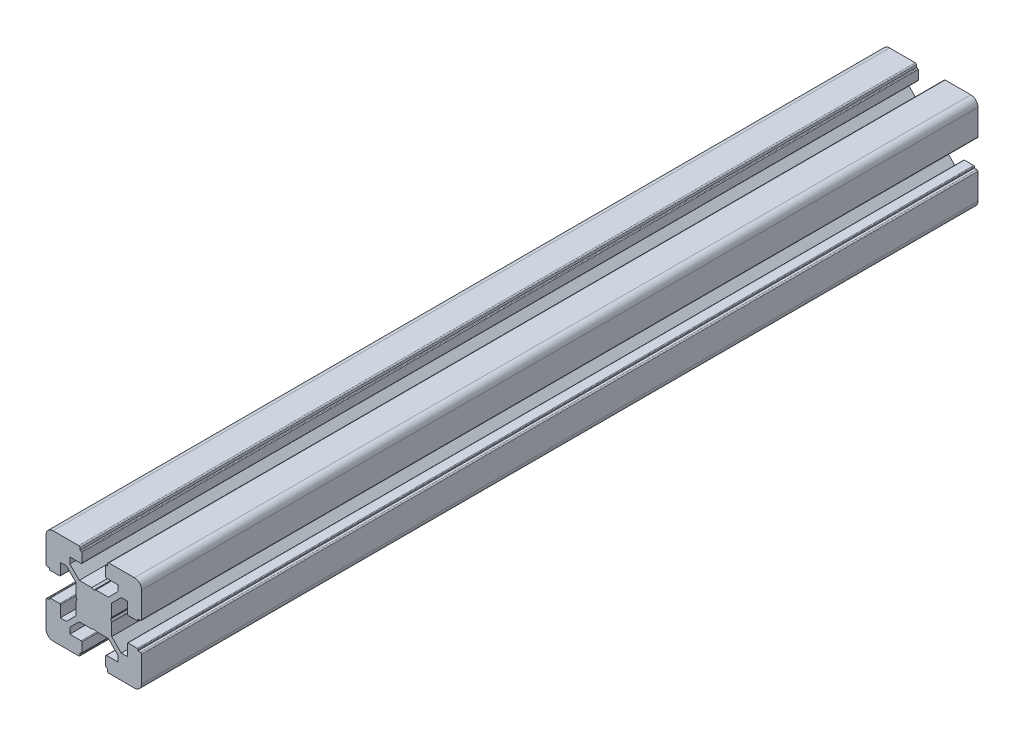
ISO-10303-21;
HEADER;
FILE_DESCRIPTION(('STEP AP214'),'2;1');
FILE_NAME('part.step','',(''),(''),'','','');
FILE_SCHEMA(('AUTOMOTIVE_DESIGN { 1 0 10303 214 1 1 1 1 }'));
ENDSEC;
DATA;
#1=APPLICATION_CONTEXT('core data for automotive mechanical design processes');
#2=APPLICATION_PROTOCOL_DEFINITION('international standard','automotive_design',2000,#1);
#3=PRODUCT_CONTEXT('',#1,'mechanical');
#4=PRODUCT('Part','Part','',(#3));
#5=PRODUCT_RELATED_PRODUCT_CATEGORY('part','',(#4));
#6=PRODUCT_DEFINITION_FORMATION('','',#4);
#7=PRODUCT_DEFINITION_CONTEXT('part definition',#1,'design');
#8=PRODUCT_DEFINITION('design','',#6,#7);
#9=PRODUCT_DEFINITION_SHAPE('','',#8);
#10=(LENGTH_UNIT() NAMED_UNIT(*) SI_UNIT(.MILLI.,.METRE.));
#11=(NAMED_UNIT(*) PLANE_ANGLE_UNIT() SI_UNIT($,.RADIAN.));
#12=(NAMED_UNIT(*) SI_UNIT($,.STERADIAN.) SOLID_ANGLE_UNIT());
#13=UNCERTAINTY_MEASURE_WITH_UNIT(LENGTH_MEASURE(1.E-05),#10,'distance_accuracy_value','');
#14=(GEOMETRIC_REPRESENTATION_CONTEXT(3) GLOBAL_UNCERTAINTY_ASSIGNED_CONTEXT((#13)) GLOBAL_UNIT_ASSIGNED_CONTEXT((#10,
#11,#12)) REPRESENTATION_CONTEXT('',''));
#15=CARTESIAN_POINT('',(0.,0.,0.));
#16=DIRECTION('',(0.,0.,1.));
#17=DIRECTION('',(1.,0.,0.));
#18=AXIS2_PLACEMENT_3D('',#15,#16,#17);
#19=CARTESIAN_POINT('',(10.7000333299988,37.,350.));
#20=DIRECTION('',(0.,0.,-1.));
#21=DIRECTION('',(-1.,0.,0.));
#22=AXIS2_PLACEMENT_3D('',#19,#20,#21);
#23=CYLINDRICAL_SURFACE('',#22,3.00000000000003);
#24=CARTESIAN_POINT('',(10.7000333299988,37.,0.));
#25=DIRECTION('',(0.,0.,1.));
#26=DIRECTION('',(1.,0.,0.));
#27=AXIS2_PLACEMENT_3D('',#24,#25,#26);
#28=CIRCLE('',#27,3.00000000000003);
#29=CARTESIAN_POINT('',(13.7000333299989,37.,0.));
#30=VERTEX_POINT('',#29);
#31=CARTESIAN_POINT('',(10.7000333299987,40.,0.));
#32=VERTEX_POINT('',#31);
#33=EDGE_CURVE('E700',#30,#32,#28,.T.);
#34=ORIENTED_EDGE('',*,*,#33,.T.);
#35=DIRECTION('',(0.,0.,-1.));
#36=VECTOR('',#35,1.);
#37=CARTESIAN_POINT('',(10.7000333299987,40.,350.));
#38=LINE('',#37,#36);
#39=CARTESIAN_POINT('',(10.7000333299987,40.,350.));
#40=VERTEX_POINT('',#39);
#41=EDGE_CURVE('E11',#40,#32,#38,.T.);
#42=ORIENTED_EDGE('',*,*,#41,.F.);
#43=CARTESIAN_POINT('',(10.7000333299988,37.,350.));
#44=DIRECTION('',(0.,0.,1.));
#45=DIRECTION('',(1.,0.,0.));
#46=AXIS2_PLACEMENT_3D('',#43,#44,#45);
#47=CIRCLE('',#46,3.00000000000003);
#48=CARTESIAN_POINT('',(13.7000333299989,37.,350.));
#49=VERTEX_POINT('',#48);
#50=EDGE_CURVE('E998',#49,#40,#47,.T.);
#51=ORIENTED_EDGE('',*,*,#50,.F.);
#52=DIRECTION('',(0.,0.,-1.));
#53=VECTOR('',#52,1.);
#54=CARTESIAN_POINT('',(13.7000333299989,37.,350.));
#55=LINE('',#54,#53);
#56=EDGE_CURVE('E696',#49,#30,#55,.T.);
#57=ORIENTED_EDGE('',*,*,#56,.T.);
#58=EDGE_LOOP('',(#34,#42,#51,#57));
#59=FACE_BOUND('',#58,.T.);
#60=ADVANCED_FACE('F47',(#59),#23,.T.);
#61=CARTESIAN_POINT('',(10.7000333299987,40.,350.));
#62=DIRECTION('',(0.,-1.,0.));
#63=DIRECTION('',(1.,0.,0.));
#64=AXIS2_PLACEMENT_3D('',#61,#62,#63);
#65=PLANE('',#64);
#66=DIRECTION('',(-1.,0.,0.));
#67=VECTOR('',#66,1.);
#68=CARTESIAN_POINT('',(10.7000333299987,40.,0.));
#69=LINE('',#68,#67);
#70=CARTESIAN_POINT('',(6.6659998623E-05,40.,0.));
#71=VERTEX_POINT('',#70);
#72=EDGE_CURVE('E704',#32,#71,#69,.T.);
#73=ORIENTED_EDGE('',*,*,#72,.T.);
#74=DIRECTION('',(0.,0.,-1.));
#75=VECTOR('',#74,1.);
#76=CARTESIAN_POINT('',(6.6659998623E-05,40.,350.));
#77=LINE('',#76,#75);
#78=CARTESIAN_POINT('',(6.6659998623E-05,40.,350.));
#79=VERTEX_POINT('',#78);
#80=EDGE_CURVE('E56',#79,#71,#77,.T.);
#81=ORIENTED_EDGE('',*,*,#80,.F.);
#82=DIRECTION('',(-1.,0.,0.));
#83=VECTOR('',#82,1.);
#84=CARTESIAN_POINT('',(10.7000333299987,40.,350.));
#85=LINE('',#84,#83);
#86=EDGE_CURVE('E383',#40,#79,#85,.T.);
#87=ORIENTED_EDGE('',*,*,#86,.F.);
#88=ORIENTED_EDGE('',*,*,#41,.T.);
#89=EDGE_LOOP('',(#73,#81,#87,#88));
#90=FACE_BOUND('',#89,.T.);
#91=ADVANCED_FACE('F1708',(#90),#65,.F.);
#92=CARTESIAN_POINT('',(6.6659998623E-05,39.5,350.));
#93=DIRECTION('',(0.,0.,-1.));
#94=DIRECTION('',(-1.,0.,0.));
#95=AXIS2_PLACEMENT_3D('',#92,#93,#94);
#96=CYLINDRICAL_SURFACE('',#95,0.499999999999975);
#97=CARTESIAN_POINT('',(6.6659998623E-05,39.5,0.));
#98=DIRECTION('',(0.,0.,1.));
#99=DIRECTION('',(1.,0.,0.));
#100=AXIS2_PLACEMENT_3D('',#97,#98,#99);
#101=CIRCLE('',#100,0.499999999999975);
#102=CARTESIAN_POINT('',(-0.499933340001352,39.5,0.));
#103=VERTEX_POINT('',#102);
#104=EDGE_CURVE('E707',#71,#103,#101,.T.);
#105=ORIENTED_EDGE('',*,*,#104,.T.);
#106=DIRECTION('',(0.,0.,-1.));
#107=VECTOR('',#106,1.);
#108=CARTESIAN_POINT('',(-0.499933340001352,39.5,350.));
#109=LINE('',#108,#107);
#110=CARTESIAN_POINT('',(-0.499933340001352,39.5,350.));
#111=VERTEX_POINT('',#110);
#112=EDGE_CURVE('E1377',#111,#103,#109,.T.);
#113=ORIENTED_EDGE('',*,*,#112,.F.);
#114=CARTESIAN_POINT('',(6.6659998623E-05,39.5,350.));
#115=DIRECTION('',(0.,0.,1.));
#116=DIRECTION('',(1.,0.,0.));
#117=AXIS2_PLACEMENT_3D('',#114,#115,#116);
#118=CIRCLE('',#117,0.499999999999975);
#119=EDGE_CURVE('E1387',#79,#111,#118,.T.);
#120=ORIENTED_EDGE('',*,*,#119,.F.);
#121=ORIENTED_EDGE('',*,*,#80,.T.);
#122=EDGE_LOOP('',(#105,#113,#120,#121));
#123=FACE_BOUND('',#122,.T.);
#124=ADVANCED_FACE('F1385',(#123),#96,.T.);
#125=CARTESIAN_POINT('',(-0.499933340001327,39.5,350.));
#126=DIRECTION('',(1.,1.21213802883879E-13,0.));
#127=DIRECTION('',(-1.21213802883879E-13,1.,0.));
#128=AXIS2_PLACEMENT_3D('',#125,#126,#127);
#129=PLANE('',#128);
#130=DIRECTION('',(1.21213802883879E-13,-1.,0.));
#131=VECTOR('',#130,1.);
#132=CARTESIAN_POINT('',(-0.499933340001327,39.5,0.));
#133=LINE('',#132,#131);
#134=CARTESIAN_POINT('',(-0.499933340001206,38.5,0.));
#135=VERTEX_POINT('',#134);
#136=EDGE_CURVE('E710',#103,#135,#133,.T.);
#137=ORIENTED_EDGE('',*,*,#136,.T.);
#138=DIRECTION('',(0.,0.,-1.));
#139=VECTOR('',#138,1.);
#140=CARTESIAN_POINT('',(-0.499933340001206,38.5,350.));
#141=LINE('',#140,#139);
#142=CARTESIAN_POINT('',(-0.499933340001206,38.5,350.));
#143=VERTEX_POINT('',#142);
#144=EDGE_CURVE('E1373',#143,#135,#141,.T.);
#145=ORIENTED_EDGE('',*,*,#144,.F.);
#146=DIRECTION('',(1.21213802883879E-13,-1.,0.));
#147=VECTOR('',#146,1.);
#148=CARTESIAN_POINT('',(-0.499933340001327,39.5,350.));
#149=LINE('',#148,#147);
#150=EDGE_CURVE('E1406',#111,#143,#149,.T.);
#151=ORIENTED_EDGE('',*,*,#150,.F.);
#152=ORIENTED_EDGE('',*,*,#112,.T.);
#153=EDGE_LOOP('',(#137,#145,#151,#152));
#154=FACE_BOUND('',#153,.T.);
#155=ADVANCED_FACE('F1396',(#154),#129,.F.);
#156=CARTESIAN_POINT('',(-0.499933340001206,38.5,350.));
#157=DIRECTION('',(0.,-1.,0.));
#158=DIRECTION('',(0.,0.,-1.));
#159=AXIS2_PLACEMENT_3D('',#156,#157,#158);
#160=PLANE('',#159);
#161=DIRECTION('',(-1.,0.,0.));
#162=VECTOR('',#161,1.);
#163=CARTESIAN_POINT('',(-0.499933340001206,38.5,0.));
#164=LINE('',#163,#162);
#165=CARTESIAN_POINT('',(-0.99993334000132,38.5,0.));
#166=VERTEX_POINT('',#165);
#167=EDGE_CURVE('E713',#135,#166,#164,.T.);
#168=ORIENTED_EDGE('',*,*,#167,.T.);
#169=DIRECTION('',(0.,0.,-1.));
#170=VECTOR('',#169,1.);
#171=CARTESIAN_POINT('',(-0.99993334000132,38.5,350.));
#172=LINE('',#171,#170);
#173=CARTESIAN_POINT('',(-0.99993334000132,38.5,350.));
#174=VERTEX_POINT('',#173);
#175=EDGE_CURVE('E1369',#174,#166,#172,.T.);
#176=ORIENTED_EDGE('',*,*,#175,.F.);
#177=DIRECTION('',(-1.,0.,0.));
#178=VECTOR('',#177,1.);
#179=CARTESIAN_POINT('',(-0.499933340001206,38.5,350.));
#180=LINE('',#179,#178);
#181=EDGE_CURVE('E1402',#143,#174,#180,.T.);
#182=ORIENTED_EDGE('',*,*,#181,.F.);
#183=ORIENTED_EDGE('',*,*,#144,.T.);
#184=EDGE_LOOP('',(#168,#176,#182,#183));
#185=FACE_BOUND('',#184,.T.);
#186=ADVANCED_FACE('F1400',(#185),#160,.F.);
#187=CARTESIAN_POINT('',(-0.999933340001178,38.2,350.));
#188=DIRECTION('',(0.,0.,-1.));
#189=DIRECTION('',(-1.,0.,0.));
#190=AXIS2_PLACEMENT_3D('',#187,#188,#189);
#191=CYLINDRICAL_SURFACE('',#190,0.300000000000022);
#192=CARTESIAN_POINT('',(-0.999933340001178,38.2,0.));
#193=DIRECTION('',(0.,0.,1.));
#194=DIRECTION('',(1.,0.,0.));
#195=AXIS2_PLACEMENT_3D('',#192,#193,#194);
#196=CIRCLE('',#195,0.300000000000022);
#197=CARTESIAN_POINT('',(-1.2999333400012,38.2,0.));
#198=VERTEX_POINT('',#197);
#199=EDGE_CURVE('E716',#166,#198,#196,.T.);
#200=ORIENTED_EDGE('',*,*,#199,.T.);
#201=DIRECTION('',(0.,0.,-1.));
#202=VECTOR('',#201,1.);
#203=CARTESIAN_POINT('',(-1.2999333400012,38.2,350.));
#204=LINE('',#203,#202);
#205=CARTESIAN_POINT('',(-1.2999333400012,38.2,350.));
#206=VERTEX_POINT('',#205);
#207=EDGE_CURVE('E1365',#206,#198,#204,.T.);
#208=ORIENTED_EDGE('',*,*,#207,.F.);
#209=CARTESIAN_POINT('',(-0.999933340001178,38.2,350.));
#210=DIRECTION('',(0.,0.,1.));
#211=DIRECTION('',(1.,0.,0.));
#212=AXIS2_PLACEMENT_3D('',#209,#210,#211);
#213=CIRCLE('',#212,0.300000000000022);
#214=EDGE_CURVE('E1405',#174,#206,#213,.T.);
#215=ORIENTED_EDGE('',*,*,#214,.F.);
#216=ORIENTED_EDGE('',*,*,#175,.T.);
#217=EDGE_LOOP('',(#200,#208,#215,#216));
#218=FACE_BOUND('',#217,.T.);
#219=ADVANCED_FACE('F1721',(#218),#191,.T.);
#220=CARTESIAN_POINT('',(-1.29993334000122,38.2,350.));
#221=DIRECTION('',(1.,0.,0.));
#222=DIRECTION('',(0.,1.,0.));
#223=AXIS2_PLACEMENT_3D('',#220,#221,#222);
#224=PLANE('',#223);
#225=DIRECTION('',(0.,-1.,0.));
#226=VECTOR('',#225,1.);
#227=CARTESIAN_POINT('',(-1.29993334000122,38.2,0.));
#228=LINE('',#227,#226);
#229=CARTESIAN_POINT('',(-1.29993334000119,34.3,0.));
#230=VERTEX_POINT('',#229);
#231=EDGE_CURVE('E719',#198,#230,#228,.T.);
#232=ORIENTED_EDGE('',*,*,#231,.T.);
#233=DIRECTION('',(0.,0.,-1.));
#234=VECTOR('',#233,1.);
#235=CARTESIAN_POINT('',(-1.29993334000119,34.3,350.));
#236=LINE('',#235,#234);
#237=CARTESIAN_POINT('',(-1.29993334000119,34.3,350.));
#238=VERTEX_POINT('',#237);
#239=EDGE_CURVE('E1361',#238,#230,#236,.T.);
#240=ORIENTED_EDGE('',*,*,#239,.F.);
#241=DIRECTION('',(0.,-1.,0.));
#242=VECTOR('',#241,1.);
#243=CARTESIAN_POINT('',(-1.29993334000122,38.2,350.));
#244=LINE('',#243,#242);
#245=EDGE_CURVE('E1410',#206,#238,#244,.T.);
#246=ORIENTED_EDGE('',*,*,#245,.F.);
#247=ORIENTED_EDGE('',*,*,#207,.T.);
#248=EDGE_LOOP('',(#232,#240,#246,#247));
#249=FACE_BOUND('',#248,.T.);
#250=ADVANCED_FACE('F1724',(#249),#224,.F.);
#251=CARTESIAN_POINT('',(-0.999933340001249,34.3,350.));
#252=DIRECTION('',(0.,0.,-1.));
#253=DIRECTION('',(-1.,0.,0.));
#254=AXIS2_PLACEMENT_3D('',#251,#252,#253);
#255=CYLINDRICAL_SURFACE('',#254,0.299999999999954);
#256=CARTESIAN_POINT('',(-0.999933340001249,34.3,0.));
#257=DIRECTION('',(0.,0.,1.));
#258=DIRECTION('',(1.,0.,0.));
#259=AXIS2_PLACEMENT_3D('',#256,#257,#258);
#260=CIRCLE('',#259,0.299999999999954);
#261=CARTESIAN_POINT('',(-0.999933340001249,34.,0.));
#262=VERTEX_POINT('',#261);
#263=EDGE_CURVE('E722',#230,#262,#260,.T.);
#264=ORIENTED_EDGE('',*,*,#263,.T.);
#265=DIRECTION('',(0.,0.,-1.));
#266=VECTOR('',#265,1.);
#267=CARTESIAN_POINT('',(-0.999933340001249,34.,350.));
#268=LINE('',#267,#266);
#269=CARTESIAN_POINT('',(-0.999933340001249,34.,350.));
#270=VERTEX_POINT('',#269);
#271=EDGE_CURVE('E1357',#270,#262,#268,.T.);
#272=ORIENTED_EDGE('',*,*,#271,.F.);
#273=CARTESIAN_POINT('',(-0.999933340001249,34.3,350.));
#274=DIRECTION('',(0.,0.,1.));
#275=DIRECTION('',(1.,0.,0.));
#276=AXIS2_PLACEMENT_3D('',#273,#274,#275);
#277=CIRCLE('',#276,0.299999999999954);
#278=EDGE_CURVE('E1417',#238,#270,#277,.T.);
#279=ORIENTED_EDGE('',*,*,#278,.F.);
#280=ORIENTED_EDGE('',*,*,#239,.T.);
#281=EDGE_LOOP('',(#264,#272,#279,#280));
#282=FACE_BOUND('',#281,.T.);
#283=ADVANCED_FACE('F1728',(#282),#255,.T.);
#284=CARTESIAN_POINT('',(-0.999933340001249,34.,350.));
#285=DIRECTION('',(0.,1.,0.));
#286=DIRECTION('',(-1.,0.,0.));
#287=AXIS2_PLACEMENT_3D('',#284,#285,#286);
#288=PLANE('',#287);
#289=DIRECTION('',(1.,0.,0.));
#290=VECTOR('',#289,1.);
#291=CARTESIAN_POINT('',(-0.999933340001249,34.,0.));
#292=LINE('',#291,#290);
#293=CARTESIAN_POINT('',(3.7501859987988,34.,0.));
#294=VERTEX_POINT('',#293);
#295=EDGE_CURVE('E725',#262,#294,#292,.T.);
#296=ORIENTED_EDGE('',*,*,#295,.T.);
#297=DIRECTION('',(0.,0.,-1.));
#298=VECTOR('',#297,1.);
#299=CARTESIAN_POINT('',(3.7501859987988,34.,350.));
#300=LINE('',#299,#298);
#301=CARTESIAN_POINT('',(3.7501859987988,34.,350.));
#302=VERTEX_POINT('',#301);
#303=EDGE_CURVE('E1353',#302,#294,#300,.T.);
#304=ORIENTED_EDGE('',*,*,#303,.F.);
#305=DIRECTION('',(1.,0.,0.));
#306=VECTOR('',#305,1.);
#307=CARTESIAN_POINT('',(-0.999933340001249,34.,350.));
#308=LINE('',#307,#306);
#309=EDGE_CURVE('E1420',#270,#302,#308,.T.);
#310=ORIENTED_EDGE('',*,*,#309,.F.);
#311=ORIENTED_EDGE('',*,*,#271,.T.);
#312=EDGE_LOOP('',(#296,#304,#310,#311));
#313=FACE_BOUND('',#312,.T.);
#314=ADVANCED_FACE('F1732',(#313),#288,.F.);
#315=CARTESIAN_POINT('',(3.7501859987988,34.,350.));
#316=DIRECTION('',(1.,0.,0.));
#317=DIRECTION('',(0.,1.,0.));
#318=AXIS2_PLACEMENT_3D('',#315,#316,#317);
#319=PLANE('',#318);
#320=DIRECTION('',(0.,-1.,0.));
#321=VECTOR('',#320,1.);
#322=CARTESIAN_POINT('',(3.7501859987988,34.,0.));
#323=LINE('',#322,#321);
#324=CARTESIAN_POINT('',(3.75018599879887,31.4643662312,0.));
#325=VERTEX_POINT('',#324);
#326=EDGE_CURVE('E728',#294,#325,#323,.T.);
#327=ORIENTED_EDGE('',*,*,#326,.T.);
#328=DIRECTION('',(0.,0.,-1.));
#329=VECTOR('',#328,1.);
#330=CARTESIAN_POINT('',(3.75018599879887,31.4643662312,350.));
#331=LINE('',#330,#329);
#332=CARTESIAN_POINT('',(3.75018599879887,31.4643662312,350.));
#333=VERTEX_POINT('',#332);
#334=EDGE_CURVE('E1349',#333,#325,#331,.T.);
#335=ORIENTED_EDGE('',*,*,#334,.F.);
#336=DIRECTION('',(0.,-1.,0.));
#337=VECTOR('',#336,1.);
#338=CARTESIAN_POINT('',(3.7501859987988,34.,350.));
#339=LINE('',#338,#337);
#340=EDGE_CURVE('E1423',#302,#333,#339,.T.);
#341=ORIENTED_EDGE('',*,*,#340,.F.);
#342=ORIENTED_EDGE('',*,*,#303,.T.);
#343=EDGE_LOOP('',(#327,#335,#341,#342));
#344=FACE_BOUND('',#343,.T.);
#345=ADVANCED_FACE('F1736',(#344),#319,.F.);
#346=CARTESIAN_POINT('',(3.75018599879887,31.4643662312,350.));
#347=DIRECTION('',(0.70710678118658,-0.707106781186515,0.));
#348=DIRECTION('',(0.707106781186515,0.70710678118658,0.));
#349=AXIS2_PLACEMENT_3D('',#346,#347,#348);
#350=PLANE('',#349);
#351=DIRECTION('',(-0.707106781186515,-0.70710678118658,0.));
#352=VECTOR('',#351,1.);
#353=CARTESIAN_POINT('',(3.75018599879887,31.4643662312,0.));
#354=LINE('',#353,#352);
#355=CARTESIAN_POINT('',(-0.214290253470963,27.4998899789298,0.));
#356=VERTEX_POINT('',#355);
#357=EDGE_CURVE('E731',#325,#356,#354,.T.);
#358=ORIENTED_EDGE('',*,*,#357,.T.);
#359=DIRECTION('',(0.,0.,-1.));
#360=VECTOR('',#359,1.);
#361=CARTESIAN_POINT('',(-0.214290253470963,27.4998899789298,350.));
#362=LINE('',#361,#360);
#363=CARTESIAN_POINT('',(-0.214290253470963,27.4998899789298,350.));
#364=VERTEX_POINT('',#363);
#365=EDGE_CURVE('E1345',#364,#356,#362,.T.);
#366=ORIENTED_EDGE('',*,*,#365,.F.);
#367=DIRECTION('',(-0.707106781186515,-0.70710678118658,0.));
#368=VECTOR('',#367,1.);
#369=CARTESIAN_POINT('',(3.75018599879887,31.4643662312,350.));
#370=LINE('',#369,#368);
#371=EDGE_CURVE('E1426',#333,#364,#370,.T.);
#372=ORIENTED_EDGE('',*,*,#371,.F.);
#373=ORIENTED_EDGE('',*,*,#334,.T.);
#374=EDGE_LOOP('',(#358,#366,#372,#373));
#375=FACE_BOUND('',#374,.T.);
#376=ADVANCED_FACE('F1740',(#375),#350,.F.);
#377=CARTESIAN_POINT('',(-0.214290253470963,27.4998899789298,350.));
#378=DIRECTION('',(0.,-1.,0.));
#379=DIRECTION('',(1.,0.,0.));
#380=AXIS2_PLACEMENT_3D('',#377,#378,#379);
#381=PLANE('',#380);
#382=DIRECTION('',(-1.,0.,0.));
#383=VECTOR('',#382,1.);
#384=CARTESIAN_POINT('',(-0.214290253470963,27.4998899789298,0.));
#385=LINE('',#384,#383);
#386=CARTESIAN_POINT('',(-5.43394126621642,27.4998899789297,0.));
#387=VERTEX_POINT('',#386);
#388=EDGE_CURVE('E734',#356,#387,#385,.T.);
#389=ORIENTED_EDGE('',*,*,#388,.T.);
#390=DIRECTION('',(0.,0.,-1.));
#391=VECTOR('',#390,1.);
#392=CARTESIAN_POINT('',(-5.43394126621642,27.4998899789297,350.));
#393=LINE('',#392,#391);
#394=CARTESIAN_POINT('',(-5.43394126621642,27.4998899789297,350.));
#395=VERTEX_POINT('',#394);
#396=EDGE_CURVE('E1341',#395,#387,#393,.T.);
#397=ORIENTED_EDGE('',*,*,#396,.F.);
#398=DIRECTION('',(-1.,0.,0.));
#399=VECTOR('',#398,1.);
#400=CARTESIAN_POINT('',(-0.214290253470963,27.4998899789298,350.));
#401=LINE('',#400,#399);
#402=EDGE_CURVE('E1429',#364,#395,#401,.T.);
#403=ORIENTED_EDGE('',*,*,#402,.F.);
#404=ORIENTED_EDGE('',*,*,#365,.T.);
#405=EDGE_LOOP('',(#389,#397,#403,#404));
#406=FACE_BOUND('',#405,.T.);
#407=ADVANCED_FACE('F1744',(#406),#381,.F.);
#408=CARTESIAN_POINT('',(-5.43394126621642,27.4998899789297,350.));
#409=DIRECTION('',(0.5,-0.866025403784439,0.));
#410=DIRECTION('',(0.866025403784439,0.5,0.));
#411=AXIS2_PLACEMENT_3D('',#408,#409,#410);
#412=PLANE('',#411);
#413=DIRECTION('',(-0.866025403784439,-0.5,0.));
#414=VECTOR('',#413,1.);
#415=CARTESIAN_POINT('',(-5.43394126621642,27.4998899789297,0.));
#416=LINE('',#415,#414);
#417=CARTESIAN_POINT('',(-6.29996667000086,26.9998899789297,0.));
#418=VERTEX_POINT('',#417);
#419=EDGE_CURVE('E737',#387,#418,#416,.T.);
#420=ORIENTED_EDGE('',*,*,#419,.T.);
#421=DIRECTION('',(0.,0.,-1.));
#422=VECTOR('',#421,1.);
#423=CARTESIAN_POINT('',(-6.29996667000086,26.9998899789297,350.));
#424=LINE('',#423,#422);
#425=CARTESIAN_POINT('',(-6.29996667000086,26.9998899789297,350.));
#426=VERTEX_POINT('',#425);
#427=EDGE_CURVE('E1337',#426,#418,#424,.T.);
#428=ORIENTED_EDGE('',*,*,#427,.F.);
#429=DIRECTION('',(-0.866025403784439,-0.5,0.));
#430=VECTOR('',#429,1.);
#431=CARTESIAN_POINT('',(-5.43394126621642,27.4998899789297,350.));
#432=LINE('',#431,#430);
#433=EDGE_CURVE('E1432',#395,#426,#432,.T.);
#434=ORIENTED_EDGE('',*,*,#433,.F.);
#435=ORIENTED_EDGE('',*,*,#396,.T.);
#436=EDGE_LOOP('',(#420,#428,#434,#435));
#437=FACE_BOUND('',#436,.T.);
#438=ADVANCED_FACE('F1748',(#437),#412,.F.);
#439=CARTESIAN_POINT('',(-6.29996667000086,26.9998899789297,350.));
#440=DIRECTION('',(-0.500000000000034,-0.866025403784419,0.));
#441=DIRECTION('',(0.866025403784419,-0.500000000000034,0.));
#442=AXIS2_PLACEMENT_3D('',#439,#440,#441);
#443=PLANE('',#442);
#444=DIRECTION('',(-0.866025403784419,0.500000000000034,0.));
#445=VECTOR('',#444,1.);
#446=CARTESIAN_POINT('',(-6.29996667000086,26.9998899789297,0.));
#447=LINE('',#446,#445);
#448=CARTESIAN_POINT('',(-7.16599207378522,27.4998899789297,0.));
#449=VERTEX_POINT('',#448);
#450=EDGE_CURVE('E740',#418,#449,#447,.T.);
#451=ORIENTED_EDGE('',*,*,#450,.T.);
#452=DIRECTION('',(0.,0.,-1.));
#453=VECTOR('',#452,1.);
#454=CARTESIAN_POINT('',(-7.16599207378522,27.4998899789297,350.));
#455=LINE('',#454,#453);
#456=CARTESIAN_POINT('',(-7.16599207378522,27.4998899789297,350.));
#457=VERTEX_POINT('',#456);
#458=EDGE_CURVE('E1333',#457,#449,#455,.T.);
#459=ORIENTED_EDGE('',*,*,#458,.F.);
#460=DIRECTION('',(-0.866025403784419,0.500000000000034,0.));
#461=VECTOR('',#460,1.);
#462=CARTESIAN_POINT('',(-6.29996667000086,26.9998899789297,350.));
#463=LINE('',#462,#461);
#464=EDGE_CURVE('E1435',#426,#457,#463,.T.);
#465=ORIENTED_EDGE('',*,*,#464,.F.);
#466=ORIENTED_EDGE('',*,*,#427,.T.);
#467=EDGE_LOOP('',(#451,#459,#465,#466));
#468=FACE_BOUND('',#467,.T.);
#469=ADVANCED_FACE('F1752',(#468),#443,.F.);
#470=CARTESIAN_POINT('',(-7.16599207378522,27.4998899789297,350.));
#471=DIRECTION('',(0.,-1.,0.));
#472=DIRECTION('',(1.,0.,0.));
#473=AXIS2_PLACEMENT_3D('',#470,#471,#472);
#474=PLANE('',#473);
#475=DIRECTION('',(-1.,0.,0.));
#476=VECTOR('',#475,1.);
#477=CARTESIAN_POINT('',(-7.16599207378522,27.4998899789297,0.));
#478=LINE('',#477,#476);
#479=CARTESIAN_POINT('',(-12.3856430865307,27.4998899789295,0.));
#480=VERTEX_POINT('',#479);
#481=EDGE_CURVE('E743',#449,#480,#478,.T.);
#482=ORIENTED_EDGE('',*,*,#481,.T.);
#483=DIRECTION('',(0.,0.,-1.));
#484=VECTOR('',#483,1.);
#485=CARTESIAN_POINT('',(-12.3856430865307,27.4998899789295,350.));
#486=LINE('',#485,#484);
#487=CARTESIAN_POINT('',(-12.3856430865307,27.4998899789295,350.));
#488=VERTEX_POINT('',#487);
#489=EDGE_CURVE('E1329',#488,#480,#486,.T.);
#490=ORIENTED_EDGE('',*,*,#489,.F.);
#491=DIRECTION('',(-1.,0.,0.));
#492=VECTOR('',#491,1.);
#493=CARTESIAN_POINT('',(-7.16599207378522,27.4998899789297,350.));
#494=LINE('',#493,#492);
#495=EDGE_CURVE('E1438',#457,#488,#494,.T.);
#496=ORIENTED_EDGE('',*,*,#495,.F.);
#497=ORIENTED_EDGE('',*,*,#458,.T.);
#498=EDGE_LOOP('',(#482,#490,#496,#497));
#499=FACE_BOUND('',#498,.T.);
#500=ADVANCED_FACE('F1756',(#499),#474,.F.);
#501=CARTESIAN_POINT('',(-12.3856430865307,27.4998899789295,350.));
#502=DIRECTION('',(-0.707106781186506,-0.707106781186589,0.));
#503=DIRECTION('',(0.707106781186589,-0.707106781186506,0.));
#504=AXIS2_PLACEMENT_3D('',#501,#502,#503);
#505=PLANE('',#504);
#506=DIRECTION('',(-0.707106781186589,0.707106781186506,0.));
#507=VECTOR('',#506,1.);
#508=CARTESIAN_POINT('',(-12.3856430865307,27.4998899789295,0.));
#509=LINE('',#508,#507);
#510=CARTESIAN_POINT('',(-16.3500526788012,31.4642995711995,0.));
#511=VERTEX_POINT('',#510);
#512=EDGE_CURVE('E746',#480,#511,#509,.T.);
#513=ORIENTED_EDGE('',*,*,#512,.T.);
#514=DIRECTION('',(0.,0.,-1.));
#515=VECTOR('',#514,1.);
#516=CARTESIAN_POINT('',(-16.3500526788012,31.4642995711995,350.));
#517=LINE('',#516,#515);
#518=CARTESIAN_POINT('',(-16.3500526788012,31.4642995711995,350.));
#519=VERTEX_POINT('',#518);
#520=EDGE_CURVE('E1325',#519,#511,#517,.T.);
#521=ORIENTED_EDGE('',*,*,#520,.F.);
#522=DIRECTION('',(-0.707106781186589,0.707106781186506,0.));
#523=VECTOR('',#522,1.);
#524=CARTESIAN_POINT('',(-12.3856430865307,27.4998899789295,350.));
#525=LINE('',#524,#523);
#526=EDGE_CURVE('E1441',#488,#519,#525,.T.);
#527=ORIENTED_EDGE('',*,*,#526,.F.);
#528=ORIENTED_EDGE('',*,*,#489,.T.);
#529=EDGE_LOOP('',(#513,#521,#527,#528));
#530=FACE_BOUND('',#529,.T.);
#531=ADVANCED_FACE('F1760',(#530),#505,.F.);
#532=CARTESIAN_POINT('',(-16.3500526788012,31.4642995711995,350.));
#533=DIRECTION('',(-1.,0.,0.));
#534=DIRECTION('',(0.,-1.,0.));
#535=AXIS2_PLACEMENT_3D('',#532,#533,#534);
#536=PLANE('',#535);
#537=DIRECTION('',(0.,1.,0.));
#538=VECTOR('',#537,1.);
#539=CARTESIAN_POINT('',(-16.3500526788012,31.4642995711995,0.));
#540=LINE('',#539,#538);
#541=CARTESIAN_POINT('',(-16.3500526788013,33.9999999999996,0.));
#542=VERTEX_POINT('',#541);
#543=EDGE_CURVE('E749',#511,#542,#540,.T.);
#544=ORIENTED_EDGE('',*,*,#543,.T.);
#545=DIRECTION('',(0.,0.,-1.));
#546=VECTOR('',#545,1.);
#547=CARTESIAN_POINT('',(-16.3500526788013,33.9999999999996,350.));
#548=LINE('',#547,#546);
#549=CARTESIAN_POINT('',(-16.3500526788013,33.9999999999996,350.));
#550=VERTEX_POINT('',#549);
#551=EDGE_CURVE('E1321',#550,#542,#548,.T.);
#552=ORIENTED_EDGE('',*,*,#551,.F.);
#553=DIRECTION('',(0.,1.,0.));
#554=VECTOR('',#553,1.);
#555=CARTESIAN_POINT('',(-16.3500526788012,31.4642995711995,350.));
#556=LINE('',#555,#554);
#557=EDGE_CURVE('E1444',#519,#550,#556,.T.);
#558=ORIENTED_EDGE('',*,*,#557,.F.);
#559=ORIENTED_EDGE('',*,*,#520,.T.);
#560=EDGE_LOOP('',(#544,#552,#558,#559));
#561=FACE_BOUND('',#560,.T.);
#562=ADVANCED_FACE('F1764',(#561),#536,.F.);
#563=CARTESIAN_POINT('',(-16.3500526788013,33.9999999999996,350.));
#564=DIRECTION('',(0.,1.,0.));
#565=DIRECTION('',(-1.,0.,0.));
#566=AXIS2_PLACEMENT_3D('',#563,#564,#565);
#567=PLANE('',#566);
#568=DIRECTION('',(1.,0.,0.));
#569=VECTOR('',#568,1.);
#570=CARTESIAN_POINT('',(-16.3500526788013,33.9999999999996,0.));
#571=LINE('',#570,#569);
#572=CARTESIAN_POINT('',(-11.5999333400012,34.,0.));
#573=VERTEX_POINT('',#572);
#574=EDGE_CURVE('E752',#542,#573,#571,.T.);
#575=ORIENTED_EDGE('',*,*,#574,.T.);
#576=DIRECTION('',(0.,0.,-1.));
#577=VECTOR('',#576,1.);
#578=CARTESIAN_POINT('',(-11.5999333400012,34.,350.));
#579=LINE('',#578,#577);
#580=CARTESIAN_POINT('',(-11.5999333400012,34.,350.));
#581=VERTEX_POINT('',#580);
#582=EDGE_CURVE('E1317',#581,#573,#579,.T.);
#583=ORIENTED_EDGE('',*,*,#582,.F.);
#584=DIRECTION('',(1.,0.,0.));
#585=VECTOR('',#584,1.);
#586=CARTESIAN_POINT('',(-16.3500526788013,33.9999999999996,350.));
#587=LINE('',#586,#585);
#588=EDGE_CURVE('E1447',#550,#581,#587,.T.);
#589=ORIENTED_EDGE('',*,*,#588,.F.);
#590=ORIENTED_EDGE('',*,*,#551,.T.);
#591=EDGE_LOOP('',(#575,#583,#589,#590));
#592=FACE_BOUND('',#591,.T.);
#593=ADVANCED_FACE('F1768',(#592),#567,.F.);
#594=CARTESIAN_POINT('',(-11.5999333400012,34.2999999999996,350.));
#595=DIRECTION('',(0.,0.,-1.));
#596=DIRECTION('',(-1.,0.,0.));
#597=AXIS2_PLACEMENT_3D('',#594,#595,#596);
#598=CYLINDRICAL_SURFACE('',#597,0.299999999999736);
#599=CARTESIAN_POINT('',(-11.5999333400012,34.2999999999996,0.));
#600=DIRECTION('',(0.,0.,1.));
#601=DIRECTION('',(1.,0.,0.));
#602=AXIS2_PLACEMENT_3D('',#599,#600,#601);
#603=CIRCLE('',#602,0.299999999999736);
#604=CARTESIAN_POINT('',(-11.2999333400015,34.2999999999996,0.));
#605=VERTEX_POINT('',#604);
#606=EDGE_CURVE('E755',#573,#605,#603,.T.);
#607=ORIENTED_EDGE('',*,*,#606,.T.);
#608=DIRECTION('',(0.,0.,-1.));
#609=VECTOR('',#608,1.);
#610=CARTESIAN_POINT('',(-11.2999333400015,34.2999999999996,350.));
#611=LINE('',#610,#609);
#612=CARTESIAN_POINT('',(-11.2999333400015,34.2999999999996,350.));
#613=VERTEX_POINT('',#612);
#614=EDGE_CURVE('E1313',#613,#605,#611,.T.);
#615=ORIENTED_EDGE('',*,*,#614,.F.);
#616=CARTESIAN_POINT('',(-11.5999333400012,34.2999999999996,350.));
#617=DIRECTION('',(0.,0.,1.));
#618=DIRECTION('',(1.,0.,0.));
#619=AXIS2_PLACEMENT_3D('',#616,#617,#618);
#620=CIRCLE('',#619,0.299999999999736);
#621=EDGE_CURVE('E1450',#581,#613,#620,.T.);
#622=ORIENTED_EDGE('',*,*,#621,.F.);
#623=ORIENTED_EDGE('',*,*,#582,.T.);
#624=EDGE_LOOP('',(#607,#615,#622,#623));
#625=FACE_BOUND('',#624,.T.);
#626=ADVANCED_FACE('F1772',(#625),#598,.T.);
#627=CARTESIAN_POINT('',(-11.2999333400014,34.2999999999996,350.));
#628=DIRECTION('',(-1.,0.,0.));
#629=DIRECTION('',(0.,-1.,0.));
#630=AXIS2_PLACEMENT_3D('',#627,#628,#629);
#631=PLANE('',#630);
#632=DIRECTION('',(0.,1.,0.));
#633=VECTOR('',#632,1.);
#634=CARTESIAN_POINT('',(-11.2999333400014,34.2999999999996,0.));
#635=LINE('',#634,#633);
#636=CARTESIAN_POINT('',(-11.2999333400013,38.1999999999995,0.));
#637=VERTEX_POINT('',#636);
#638=EDGE_CURVE('E758',#605,#637,#635,.T.);
#639=ORIENTED_EDGE('',*,*,#638,.T.);
#640=DIRECTION('',(0.,0.,-1.));
#641=VECTOR('',#640,1.);
#642=CARTESIAN_POINT('',(-11.2999333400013,38.1999999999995,350.));
#643=LINE('',#642,#641);
#644=CARTESIAN_POINT('',(-11.2999333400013,38.1999999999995,350.));
#645=VERTEX_POINT('',#644);
#646=EDGE_CURVE('E1309',#645,#637,#643,.T.);
#647=ORIENTED_EDGE('',*,*,#646,.F.);
#648=DIRECTION('',(0.,1.,0.));
#649=VECTOR('',#648,1.);
#650=CARTESIAN_POINT('',(-11.2999333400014,34.2999999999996,350.));
#651=LINE('',#650,#649);
#652=EDGE_CURVE('E1453',#613,#645,#651,.T.);
#653=ORIENTED_EDGE('',*,*,#652,.F.);
#654=ORIENTED_EDGE('',*,*,#614,.T.);
#655=EDGE_LOOP('',(#639,#647,#653,#654));
#656=FACE_BOUND('',#655,.T.);
#657=ADVANCED_FACE('F1776',(#656),#631,.F.);
#658=CARTESIAN_POINT('',(-11.5999333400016,38.1999999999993,350.));
#659=DIRECTION('',(0.,0.,-1.));
#660=DIRECTION('',(-1.,0.,0.));
#661=AXIS2_PLACEMENT_3D('',#658,#659,#660);
#662=CYLINDRICAL_SURFACE('',#661,0.300000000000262);
#663=CARTESIAN_POINT('',(-11.5999333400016,38.1999999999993,0.));
#664=DIRECTION('',(0.,0.,1.));
#665=DIRECTION('',(1.,0.,0.));
#666=AXIS2_PLACEMENT_3D('',#663,#664,#665);
#667=CIRCLE('',#666,0.300000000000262);
#668=CARTESIAN_POINT('',(-11.5999333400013,38.4999999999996,0.));
#669=VERTEX_POINT('',#668);
#670=EDGE_CURVE('E761',#637,#669,#667,.T.);
#671=ORIENTED_EDGE('',*,*,#670,.T.);
#672=DIRECTION('',(0.,0.,-1.));
#673=VECTOR('',#672,1.);
#674=CARTESIAN_POINT('',(-11.5999333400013,38.4999999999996,350.));
#675=LINE('',#674,#673);
#676=CARTESIAN_POINT('',(-11.5999333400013,38.4999999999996,350.));
#677=VERTEX_POINT('',#676);
#678=EDGE_CURVE('E1305',#677,#669,#675,.T.);
#679=ORIENTED_EDGE('',*,*,#678,.F.);
#680=CARTESIAN_POINT('',(-11.5999333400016,38.1999999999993,350.));
#681=DIRECTION('',(0.,0.,1.));
#682=DIRECTION('',(1.,0.,0.));
#683=AXIS2_PLACEMENT_3D('',#680,#681,#682);
#684=CIRCLE('',#683,0.300000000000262);
#685=EDGE_CURVE('E1456',#645,#677,#684,.T.);
#686=ORIENTED_EDGE('',*,*,#685,.F.);
#687=ORIENTED_EDGE('',*,*,#646,.T.);
#688=EDGE_LOOP('',(#671,#679,#686,#687));
#689=FACE_BOUND('',#688,.T.);
#690=ADVANCED_FACE('F1780',(#689),#662,.T.);
#691=CARTESIAN_POINT('',(-11.5999333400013,38.4999999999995,350.));
#692=DIRECTION('',(-9.43689570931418E-13,-1.,0.));
#693=DIRECTION('',(1.,-9.43689570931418E-13,0.));
#694=AXIS2_PLACEMENT_3D('',#691,#692,#693);
#695=PLANE('',#694);
#696=DIRECTION('',(-1.,9.43689570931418E-13,0.));
#697=VECTOR('',#696,1.);
#698=CARTESIAN_POINT('',(-11.5999333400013,38.4999999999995,0.));
#699=LINE('',#698,#697);
#700=CARTESIAN_POINT('',(-12.0999333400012,38.5,0.));
#701=VERTEX_POINT('',#700);
#702=EDGE_CURVE('E764',#669,#701,#699,.T.);
#703=ORIENTED_EDGE('',*,*,#702,.T.);
#704=DIRECTION('',(0.,0.,-1.));
#705=VECTOR('',#704,1.);
#706=CARTESIAN_POINT('',(-12.0999333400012,38.5,350.));
#707=LINE('',#706,#705);
#708=CARTESIAN_POINT('',(-12.0999333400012,38.5,350.));
#709=VERTEX_POINT('',#708);
#710=EDGE_CURVE('E1301',#709,#701,#707,.T.);
#711=ORIENTED_EDGE('',*,*,#710,.F.);
#712=DIRECTION('',(-1.,9.43689570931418E-13,0.));
#713=VECTOR('',#712,1.);
#714=CARTESIAN_POINT('',(-11.5999333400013,38.4999999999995,350.));
#715=LINE('',#714,#713);
#716=EDGE_CURVE('E1459',#677,#709,#715,.T.);
#717=ORIENTED_EDGE('',*,*,#716,.F.);
#718=ORIENTED_EDGE('',*,*,#678,.T.);
#719=EDGE_LOOP('',(#703,#711,#717,#718));
#720=FACE_BOUND('',#719,.T.);
#721=ADVANCED_FACE('F1784',(#720),#695,.F.);
#722=CARTESIAN_POINT('',(-12.0999333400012,38.5,350.));
#723=DIRECTION('',(-1.,0.,0.));
#724=DIRECTION('',(0.,-1.,0.));
#725=AXIS2_PLACEMENT_3D('',#722,#723,#724);
#726=PLANE('',#725);
#727=DIRECTION('',(0.,1.,0.));
#728=VECTOR('',#727,1.);
#729=CARTESIAN_POINT('',(-12.0999333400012,38.5,0.));
#730=LINE('',#729,#728);
#731=CARTESIAN_POINT('',(-12.0999333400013,39.5,0.));
#732=VERTEX_POINT('',#731);
#733=EDGE_CURVE('E767',#701,#732,#730,.T.);
#734=ORIENTED_EDGE('',*,*,#733,.T.);
#735=DIRECTION('',(0.,0.,-1.));
#736=VECTOR('',#735,1.);
#737=CARTESIAN_POINT('',(-12.0999333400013,39.5,350.));
#738=LINE('',#737,#736);
#739=CARTESIAN_POINT('',(-12.0999333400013,39.5,350.));
#740=VERTEX_POINT('',#739);
#741=EDGE_CURVE('E1297',#740,#732,#738,.T.);
#742=ORIENTED_EDGE('',*,*,#741,.F.);
#743=DIRECTION('',(0.,1.,0.));
#744=VECTOR('',#743,1.);
#745=CARTESIAN_POINT('',(-12.0999333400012,38.5,350.));
#746=LINE('',#745,#744);
#747=EDGE_CURVE('E1462',#709,#740,#746,.T.);
#748=ORIENTED_EDGE('',*,*,#747,.F.);
#749=ORIENTED_EDGE('',*,*,#710,.T.);
#750=EDGE_LOOP('',(#734,#742,#748,#749));
#751=FACE_BOUND('',#750,.T.);
#752=ADVANCED_FACE('F1788',(#751),#726,.F.);
#753=CARTESIAN_POINT('',(-12.5999333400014,39.4999999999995,350.));
#754=DIRECTION('',(0.,0.,-1.));
#755=DIRECTION('',(-1.,0.,0.));
#756=AXIS2_PLACEMENT_3D('',#753,#754,#755);
#757=CYLINDRICAL_SURFACE('',#756,0.50000000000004);
#758=CARTESIAN_POINT('',(-12.5999333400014,39.4999999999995,0.));
#759=DIRECTION('',(0.,0.,1.));
#760=DIRECTION('',(1.,0.,0.));
#761=AXIS2_PLACEMENT_3D('',#758,#759,#760);
#762=CIRCLE('',#761,0.50000000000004);
#763=CARTESIAN_POINT('',(-12.5999333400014,39.9999999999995,0.));
#764=VERTEX_POINT('',#763);
#765=EDGE_CURVE('E770',#732,#764,#762,.T.);
#766=ORIENTED_EDGE('',*,*,#765,.T.);
#767=DIRECTION('',(0.,0.,-1.));
#768=VECTOR('',#767,1.);
#769=CARTESIAN_POINT('',(-12.5999333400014,39.9999999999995,350.));
#770=LINE('',#769,#768);
#771=CARTESIAN_POINT('',(-12.5999333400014,39.9999999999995,350.));
#772=VERTEX_POINT('',#771);
#773=EDGE_CURVE('E1293',#772,#764,#770,.T.);
#774=ORIENTED_EDGE('',*,*,#773,.F.);
#775=CARTESIAN_POINT('',(-12.5999333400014,39.4999999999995,350.));
#776=DIRECTION('',(0.,0.,1.));
#777=DIRECTION('',(1.,0.,0.));
#778=AXIS2_PLACEMENT_3D('',#775,#776,#777);
#779=CIRCLE('',#778,0.50000000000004);
#780=EDGE_CURVE('E1465',#740,#772,#779,.T.);
#781=ORIENTED_EDGE('',*,*,#780,.F.);
#782=ORIENTED_EDGE('',*,*,#741,.T.);
#783=EDGE_LOOP('',(#766,#774,#781,#782));
#784=FACE_BOUND('',#783,.T.);
#785=ADVANCED_FACE('F1792',(#784),#757,.T.);
#786=CARTESIAN_POINT('',(-12.5999333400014,39.9999999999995,350.));
#787=DIRECTION('',(0.,-1.,0.));
#788=DIRECTION('',(1.,0.,0.));
#789=AXIS2_PLACEMENT_3D('',#786,#787,#788);
#790=PLANE('',#789);
#791=DIRECTION('',(-1.,0.,0.));
#792=VECTOR('',#791,1.);
#793=CARTESIAN_POINT('',(-12.5999333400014,39.9999999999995,0.));
#794=LINE('',#793,#792);
#795=CARTESIAN_POINT('',(-23.2999666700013,39.9999999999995,0.));
#796=VERTEX_POINT('',#795);
#797=EDGE_CURVE('E773',#764,#796,#794,.T.);
#798=ORIENTED_EDGE('',*,*,#797,.T.);
#799=DIRECTION('',(0.,0.,-1.));
#800=VECTOR('',#799,1.);
#801=CARTESIAN_POINT('',(-23.2999666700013,39.9999999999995,350.));
#802=LINE('',#801,#800);
#803=CARTESIAN_POINT('',(-23.2999666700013,39.9999999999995,350.));
#804=VERTEX_POINT('',#803);
#805=EDGE_CURVE('E1289',#804,#796,#802,.T.);
#806=ORIENTED_EDGE('',*,*,#805,.F.);
#807=DIRECTION('',(-1.,0.,0.));
#808=VECTOR('',#807,1.);
#809=CARTESIAN_POINT('',(-12.5999333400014,39.9999999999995,350.));
#810=LINE('',#809,#808);
#811=EDGE_CURVE('E1468',#772,#804,#810,.T.);
#812=ORIENTED_EDGE('',*,*,#811,.F.);
#813=ORIENTED_EDGE('',*,*,#773,.T.);
#814=EDGE_LOOP('',(#798,#806,#812,#813));
#815=FACE_BOUND('',#814,.T.);
#816=ADVANCED_FACE('F1796',(#815),#790,.F.);
#817=CARTESIAN_POINT('',(-23.299966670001,36.9999999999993,350.));
#818=DIRECTION('',(0.,0.,-1.));
#819=DIRECTION('',(-1.,0.,0.));
#820=AXIS2_PLACEMENT_3D('',#817,#818,#819);
#821=CYLINDRICAL_SURFACE('',#820,3.00000000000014);
#822=CARTESIAN_POINT('',(-23.299966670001,36.9999999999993,0.));
#823=DIRECTION('',(0.,0.,1.));
#824=DIRECTION('',(1.,0.,0.));
#825=AXIS2_PLACEMENT_3D('',#822,#823,#824);
#826=CIRCLE('',#825,3.00000000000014);
#827=CARTESIAN_POINT('',(-26.2999666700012,36.9999999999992,0.));
#828=VERTEX_POINT('',#827);
#829=EDGE_CURVE('E776',#796,#828,#826,.T.);
#830=ORIENTED_EDGE('',*,*,#829,.T.);
#831=DIRECTION('',(0.,0.,-1.));
#832=VECTOR('',#831,1.);
#833=CARTESIAN_POINT('',(-26.2999666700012,36.9999999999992,350.));
#834=LINE('',#833,#832);
#835=CARTESIAN_POINT('',(-26.2999666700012,36.9999999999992,350.));
#836=VERTEX_POINT('',#835);
#837=EDGE_CURVE('E1285',#836,#828,#834,.T.);
#838=ORIENTED_EDGE('',*,*,#837,.F.);
#839=CARTESIAN_POINT('',(-23.299966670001,36.9999999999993,350.));
#840=DIRECTION('',(0.,0.,1.));
#841=DIRECTION('',(1.,0.,0.));
#842=AXIS2_PLACEMENT_3D('',#839,#840,#841);
#843=CIRCLE('',#842,3.00000000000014);
#844=EDGE_CURVE('E1471',#804,#836,#843,.T.);
#845=ORIENTED_EDGE('',*,*,#844,.F.);
#846=ORIENTED_EDGE('',*,*,#805,.T.);
#847=EDGE_LOOP('',(#830,#838,#845,#846));
#848=FACE_BOUND('',#847,.T.);
#849=ADVANCED_FACE('F1800',(#848),#821,.T.);
#850=CARTESIAN_POINT('',(-26.2999666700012,36.9999999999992,350.));
#851=DIRECTION('',(1.,0.,0.));
#852=DIRECTION('',(0.,1.,0.));
#853=AXIS2_PLACEMENT_3D('',#850,#851,#852);
#854=PLANE('',#853);
#855=DIRECTION('',(0.,-1.,0.));
#856=VECTOR('',#855,1.);
#857=CARTESIAN_POINT('',(-26.2999666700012,36.9999999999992,0.));
#858=LINE('',#857,#856);
#859=CARTESIAN_POINT('',(-26.2999666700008,26.3000333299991,0.));
#860=VERTEX_POINT('',#859);
#861=EDGE_CURVE('E779',#828,#860,#858,.T.);
#862=ORIENTED_EDGE('',*,*,#861,.T.);
#863=DIRECTION('',(0.,0.,-1.));
#864=VECTOR('',#863,1.);
#865=CARTESIAN_POINT('',(-26.2999666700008,26.3000333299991,350.));
#866=LINE('',#865,#864);
#867=CARTESIAN_POINT('',(-26.2999666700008,26.3000333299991,350.));
#868=VERTEX_POINT('',#867);
#869=EDGE_CURVE('E1281',#868,#860,#866,.T.);
#870=ORIENTED_EDGE('',*,*,#869,.F.);
#871=DIRECTION('',(0.,-1.,0.));
#872=VECTOR('',#871,1.);
#873=CARTESIAN_POINT('',(-26.2999666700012,36.9999999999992,350.));
#874=LINE('',#873,#872);
#875=EDGE_CURVE('E1474',#836,#868,#874,.T.);
#876=ORIENTED_EDGE('',*,*,#875,.F.);
#877=ORIENTED_EDGE('',*,*,#837,.T.);
#878=EDGE_LOOP('',(#862,#870,#876,#877));
#879=FACE_BOUND('',#878,.T.);
#880=ADVANCED_FACE('F1804',(#879),#854,.F.);
#881=CARTESIAN_POINT('',(-25.7999666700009,26.3000333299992,350.));
#882=DIRECTION('',(0.,0.,-1.));
#883=DIRECTION('',(-1.,0.,0.));
#884=AXIS2_PLACEMENT_3D('',#881,#882,#883);
#885=CYLINDRICAL_SURFACE('',#884,0.499999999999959);
#886=CARTESIAN_POINT('',(-25.7999666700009,26.3000333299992,0.));
#887=DIRECTION('',(0.,0.,1.));
#888=DIRECTION('',(1.,0.,0.));
#889=AXIS2_PLACEMENT_3D('',#886,#887,#888);
#890=CIRCLE('',#889,0.499999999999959);
#891=CARTESIAN_POINT('',(-25.7999666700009,25.8000333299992,0.));
#892=VERTEX_POINT('',#891);
#893=EDGE_CURVE('E782',#860,#892,#890,.T.);
#894=ORIENTED_EDGE('',*,*,#893,.T.);
#895=DIRECTION('',(0.,0.,-1.));
#896=VECTOR('',#895,1.);
#897=CARTESIAN_POINT('',(-25.7999666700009,25.8000333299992,350.));
#898=LINE('',#897,#896);
#899=CARTESIAN_POINT('',(-25.7999666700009,25.8000333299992,350.));
#900=VERTEX_POINT('',#899);
#901=EDGE_CURVE('E1277',#900,#892,#898,.T.);
#902=ORIENTED_EDGE('',*,*,#901,.F.);
#903=CARTESIAN_POINT('',(-25.7999666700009,26.3000333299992,350.));
#904=DIRECTION('',(0.,0.,1.));
#905=DIRECTION('',(1.,0.,0.));
#906=AXIS2_PLACEMENT_3D('',#903,#904,#905);
#907=CIRCLE('',#906,0.499999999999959);
#908=EDGE_CURVE('E1477',#868,#900,#907,.T.);
#909=ORIENTED_EDGE('',*,*,#908,.F.);
#910=ORIENTED_EDGE('',*,*,#869,.T.);
#911=EDGE_LOOP('',(#894,#902,#909,#910));
#912=FACE_BOUND('',#911,.T.);
#913=ADVANCED_FACE('F1808',(#912),#885,.T.);
#914=CARTESIAN_POINT('',(-25.7999666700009,25.8000333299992,350.));
#915=DIRECTION('',(0.,1.,0.));
#916=DIRECTION('',(-1.,0.,0.));
#917=AXIS2_PLACEMENT_3D('',#914,#915,#916);
#918=PLANE('',#917);
#919=DIRECTION('',(1.,0.,0.));
#920=VECTOR('',#919,1.);
#921=CARTESIAN_POINT('',(-25.7999666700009,25.8000333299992,0.));
#922=LINE('',#921,#920);
#923=CARTESIAN_POINT('',(-24.7999666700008,25.8000333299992,0.));
#924=VERTEX_POINT('',#923);
#925=EDGE_CURVE('E785',#892,#924,#922,.T.);
#926=ORIENTED_EDGE('',*,*,#925,.T.);
#927=DIRECTION('',(0.,0.,-1.));
#928=VECTOR('',#927,1.);
#929=CARTESIAN_POINT('',(-24.7999666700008,25.8000333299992,350.));
#930=LINE('',#929,#928);
#931=CARTESIAN_POINT('',(-24.7999666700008,25.8000333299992,350.));
#932=VERTEX_POINT('',#931);
#933=EDGE_CURVE('E1273',#932,#924,#930,.T.);
#934=ORIENTED_EDGE('',*,*,#933,.F.);
#935=DIRECTION('',(1.,0.,0.));
#936=VECTOR('',#935,1.);
#937=CARTESIAN_POINT('',(-25.7999666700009,25.8000333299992,350.));
#938=LINE('',#937,#936);
#939=EDGE_CURVE('E1480',#900,#932,#938,.T.);
#940=ORIENTED_EDGE('',*,*,#939,.F.);
#941=ORIENTED_EDGE('',*,*,#901,.T.);
#942=EDGE_LOOP('',(#926,#934,#940,#941));
#943=FACE_BOUND('',#942,.T.);
#944=ADVANCED_FACE('F1812',(#943),#918,.F.);
#945=CARTESIAN_POINT('',(-24.7999666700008,25.8000333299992,350.));
#946=DIRECTION('',(1.,0.,0.));
#947=DIRECTION('',(0.,1.,0.));
#948=AXIS2_PLACEMENT_3D('',#945,#946,#947);
#949=PLANE('',#948);
#950=DIRECTION('',(0.,-1.,0.));
#951=VECTOR('',#950,1.);
#952=CARTESIAN_POINT('',(-24.7999666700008,25.8000333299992,0.));
#953=LINE('',#952,#951);
#954=CARTESIAN_POINT('',(-24.7999666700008,25.3000333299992,0.));
#955=VERTEX_POINT('',#954);
#956=EDGE_CURVE('E788',#924,#955,#953,.T.);
#957=ORIENTED_EDGE('',*,*,#956,.T.);
#958=DIRECTION('',(0.,0.,-1.));
#959=VECTOR('',#958,1.);
#960=CARTESIAN_POINT('',(-24.7999666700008,25.3000333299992,350.));
#961=LINE('',#960,#959);
#962=CARTESIAN_POINT('',(-24.7999666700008,25.3000333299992,350.));
#963=VERTEX_POINT('',#962);
#964=EDGE_CURVE('E1269',#963,#955,#961,.T.);
#965=ORIENTED_EDGE('',*,*,#964,.F.);
#966=DIRECTION('',(0.,-1.,0.));
#967=VECTOR('',#966,1.);
#968=CARTESIAN_POINT('',(-24.7999666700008,25.8000333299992,350.));
#969=LINE('',#968,#967);
#970=EDGE_CURVE('E1483',#932,#963,#969,.T.);
#971=ORIENTED_EDGE('',*,*,#970,.F.);
#972=ORIENTED_EDGE('',*,*,#933,.T.);
#973=EDGE_LOOP('',(#957,#965,#971,#972));
#974=FACE_BOUND('',#973,.T.);
#975=ADVANCED_FACE('F1816',(#974),#949,.F.);
#976=CARTESIAN_POINT('',(-24.4999666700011,25.3000333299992,350.));
#977=DIRECTION('',(0.,0.,-1.));
#978=DIRECTION('',(-1.,0.,0.));
#979=AXIS2_PLACEMENT_3D('',#976,#977,#978);
#980=CYLINDRICAL_SURFACE('',#979,0.29999999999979);
#981=CARTESIAN_POINT('',(-24.4999666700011,25.3000333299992,0.));
#982=DIRECTION('',(0.,0.,1.));
#983=DIRECTION('',(1.,0.,0.));
#984=AXIS2_PLACEMENT_3D('',#981,#982,#983);
#985=CIRCLE('',#984,0.29999999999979);
#986=CARTESIAN_POINT('',(-24.4999666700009,25.0000333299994,0.));
#987=VERTEX_POINT('',#986);
#988=EDGE_CURVE('E791',#955,#987,#985,.T.);
#989=ORIENTED_EDGE('',*,*,#988,.T.);
#990=DIRECTION('',(0.,0.,-1.));
#991=VECTOR('',#990,1.);
#992=CARTESIAN_POINT('',(-24.4999666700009,25.0000333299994,350.));
#993=LINE('',#992,#991);
#994=CARTESIAN_POINT('',(-24.4999666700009,25.0000333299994,350.));
#995=VERTEX_POINT('',#994);
#996=EDGE_CURVE('E1265',#995,#987,#993,.T.);
#997=ORIENTED_EDGE('',*,*,#996,.F.);
#998=CARTESIAN_POINT('',(-24.4999666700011,25.3000333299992,350.));
#999=DIRECTION('',(0.,0.,1.));
#1000=DIRECTION('',(1.,0.,0.));
#1001=AXIS2_PLACEMENT_3D('',#998,#999,#1000);
#1002=CIRCLE('',#1001,0.29999999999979);
#1003=EDGE_CURVE('E1486',#963,#995,#1002,.T.);
#1004=ORIENTED_EDGE('',*,*,#1003,.F.);
#1005=ORIENTED_EDGE('',*,*,#964,.T.);
#1006=EDGE_LOOP('',(#989,#997,#1004,#1005));
#1007=FACE_BOUND('',#1006,.T.);
#1008=ADVANCED_FACE('F1820',(#1007),#980,.T.);
#1009=CARTESIAN_POINT('',(-24.4999666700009,25.0000333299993,350.));
#1010=DIRECTION('',(0.,1.,0.));
#1011=DIRECTION('',(-1.,0.,0.));
#1012=AXIS2_PLACEMENT_3D('',#1009,#1010,#1011);
#1013=PLANE('',#1012);
#1014=DIRECTION('',(1.,0.,0.));
#1015=VECTOR('',#1014,1.);
#1016=CARTESIAN_POINT('',(-24.4999666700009,25.0000333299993,0.));
#1017=LINE('',#1016,#1015);
#1018=CARTESIAN_POINT('',(-20.599966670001,25.0000333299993,0.));
#1019=VERTEX_POINT('',#1018);
#1020=EDGE_CURVE('E794',#987,#1019,#1017,.T.);
#1021=ORIENTED_EDGE('',*,*,#1020,.T.);
#1022=DIRECTION('',(0.,0.,-1.));
#1023=VECTOR('',#1022,1.);
#1024=CARTESIAN_POINT('',(-20.599966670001,25.0000333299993,350.));
#1025=LINE('',#1024,#1023);
#1026=CARTESIAN_POINT('',(-20.599966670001,25.0000333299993,350.));
#1027=VERTEX_POINT('',#1026);
#1028=EDGE_CURVE('E1261',#1027,#1019,#1025,.T.);
#1029=ORIENTED_EDGE('',*,*,#1028,.F.);
#1030=DIRECTION('',(1.,0.,0.));
#1031=VECTOR('',#1030,1.);
#1032=CARTESIAN_POINT('',(-24.4999666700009,25.0000333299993,350.));
#1033=LINE('',#1032,#1031);
#1034=EDGE_CURVE('E1489',#995,#1027,#1033,.T.);
#1035=ORIENTED_EDGE('',*,*,#1034,.F.);
#1036=ORIENTED_EDGE('',*,*,#996,.T.);
#1037=EDGE_LOOP('',(#1021,#1029,#1035,#1036));
#1038=FACE_BOUND('',#1037,.T.);
#1039=ADVANCED_FACE('F1824',(#1038),#1013,.F.);
#1040=CARTESIAN_POINT('',(-20.5999666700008,25.3000333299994,350.));
#1041=DIRECTION('',(0.,0.,-1.));
#1042=DIRECTION('',(-1.,0.,0.));
#1043=AXIS2_PLACEMENT_3D('',#1040,#1041,#1042);
#1044=CYLINDRICAL_SURFACE('',#1043,0.300000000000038);
#1045=CARTESIAN_POINT('',(-20.5999666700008,25.3000333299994,0.));
#1046=DIRECTION('',(0.,0.,1.));
#1047=DIRECTION('',(1.,0.,0.));
#1048=AXIS2_PLACEMENT_3D('',#1045,#1046,#1047);
#1049=CIRCLE('',#1048,0.300000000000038);
#1050=CARTESIAN_POINT('',(-20.2999666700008,25.3000333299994,0.));
#1051=VERTEX_POINT('',#1050);
#1052=EDGE_CURVE('E797',#1019,#1051,#1049,.T.);
#1053=ORIENTED_EDGE('',*,*,#1052,.T.);
#1054=DIRECTION('',(0.,0.,-1.));
#1055=VECTOR('',#1054,1.);
#1056=CARTESIAN_POINT('',(-20.2999666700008,25.3000333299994,350.));
#1057=LINE('',#1056,#1055);
#1058=CARTESIAN_POINT('',(-20.2999666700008,25.3000333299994,350.));
#1059=VERTEX_POINT('',#1058);
#1060=EDGE_CURVE('E1257',#1059,#1051,#1057,.T.);
#1061=ORIENTED_EDGE('',*,*,#1060,.F.);
#1062=CARTESIAN_POINT('',(-20.5999666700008,25.3000333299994,350.));
#1063=DIRECTION('',(0.,0.,1.));
#1064=DIRECTION('',(1.,0.,0.));
#1065=AXIS2_PLACEMENT_3D('',#1062,#1063,#1064);
#1066=CIRCLE('',#1065,0.300000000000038);
#1067=EDGE_CURVE('E1492',#1027,#1059,#1066,.T.);
#1068=ORIENTED_EDGE('',*,*,#1067,.F.);
#1069=ORIENTED_EDGE('',*,*,#1028,.T.);
#1070=EDGE_LOOP('',(#1053,#1061,#1068,#1069));
#1071=FACE_BOUND('',#1070,.T.);
#1072=ADVANCED_FACE('F1828',(#1071),#1044,.T.);
#1073=CARTESIAN_POINT('',(-20.2999666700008,25.3000333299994,350.));
#1074=DIRECTION('',(-1.,0.,0.));
#1075=DIRECTION('',(0.,-1.,0.));
#1076=AXIS2_PLACEMENT_3D('',#1073,#1074,#1075);
#1077=PLANE('',#1076);
#1078=DIRECTION('',(0.,1.,0.));
#1079=VECTOR('',#1078,1.);
#1080=CARTESIAN_POINT('',(-20.2999666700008,25.3000333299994,0.));
#1081=LINE('',#1080,#1079);
#1082=CARTESIAN_POINT('',(-20.2999666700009,30.0501526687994,0.));
#1083=VERTEX_POINT('',#1082);
#1084=EDGE_CURVE('E800',#1051,#1083,#1081,.T.);
#1085=ORIENTED_EDGE('',*,*,#1084,.T.);
#1086=DIRECTION('',(0.,0.,-1.));
#1087=VECTOR('',#1086,1.);
#1088=CARTESIAN_POINT('',(-20.2999666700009,30.0501526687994,350.));
#1089=LINE('',#1088,#1087);
#1090=CARTESIAN_POINT('',(-20.2999666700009,30.0501526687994,350.));
#1091=VERTEX_POINT('',#1090);
#1092=EDGE_CURVE('E1253',#1091,#1083,#1089,.T.);
#1093=ORIENTED_EDGE('',*,*,#1092,.F.);
#1094=DIRECTION('',(0.,1.,0.));
#1095=VECTOR('',#1094,1.);
#1096=CARTESIAN_POINT('',(-20.2999666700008,25.3000333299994,350.));
#1097=LINE('',#1096,#1095);
#1098=EDGE_CURVE('E1495',#1059,#1091,#1097,.T.);
#1099=ORIENTED_EDGE('',*,*,#1098,.F.);
#1100=ORIENTED_EDGE('',*,*,#1060,.T.);
#1101=EDGE_LOOP('',(#1085,#1093,#1099,#1100));
#1102=FACE_BOUND('',#1101,.T.);
#1103=ADVANCED_FACE('F1832',(#1102),#1077,.F.);
#1104=CARTESIAN_POINT('',(-20.2999666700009,30.0501526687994,350.));
#1105=DIRECTION('',(0.,1.,0.));
#1106=DIRECTION('',(-1.,0.,0.));
#1107=AXIS2_PLACEMENT_3D('',#1104,#1105,#1106);
#1108=PLANE('',#1107);
#1109=DIRECTION('',(1.,0.,0.));
#1110=VECTOR('',#1109,1.);
#1111=CARTESIAN_POINT('',(-20.2999666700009,30.0501526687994,0.));
#1112=LINE('',#1111,#1110);
#1113=CARTESIAN_POINT('',(-17.7643329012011,30.0501526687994,0.));
#1114=VERTEX_POINT('',#1113);
#1115=EDGE_CURVE('E803',#1083,#1114,#1112,.T.);
#1116=ORIENTED_EDGE('',*,*,#1115,.T.);
#1117=DIRECTION('',(0.,0.,-1.));
#1118=VECTOR('',#1117,1.);
#1119=CARTESIAN_POINT('',(-17.7643329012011,30.0501526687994,350.));
#1120=LINE('',#1119,#1118);
#1121=CARTESIAN_POINT('',(-17.7643329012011,30.0501526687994,350.));
#1122=VERTEX_POINT('',#1121);
#1123=EDGE_CURVE('E1249',#1122,#1114,#1120,.T.);
#1124=ORIENTED_EDGE('',*,*,#1123,.F.);
#1125=DIRECTION('',(1.,0.,0.));
#1126=VECTOR('',#1125,1.);
#1127=CARTESIAN_POINT('',(-20.2999666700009,30.0501526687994,350.));
#1128=LINE('',#1127,#1126);
#1129=EDGE_CURVE('E1498',#1091,#1122,#1128,.T.);
#1130=ORIENTED_EDGE('',*,*,#1129,.F.);
#1131=ORIENTED_EDGE('',*,*,#1092,.T.);
#1132=EDGE_LOOP('',(#1116,#1124,#1130,#1131));
#1133=FACE_BOUND('',#1132,.T.);
#1134=ADVANCED_FACE('F1836',(#1133),#1108,.F.);
#1135=CARTESIAN_POINT('',(-17.7643329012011,30.0501526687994,350.));
#1136=DIRECTION('',(0.707106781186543,0.707106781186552,0.));
#1137=DIRECTION('',(-0.707106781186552,0.707106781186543,0.));
#1138=AXIS2_PLACEMENT_3D('',#1135,#1136,#1137);
#1139=PLANE('',#1138);
#1140=DIRECTION('',(0.707106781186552,-0.707106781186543,0.));
#1141=VECTOR('',#1140,1.);
#1142=CARTESIAN_POINT('',(-17.7643329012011,30.0501526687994,0.));
#1143=LINE('',#1142,#1141);
#1144=CARTESIAN_POINT('',(-13.799856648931,26.0856764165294,0.));
#1145=VERTEX_POINT('',#1144);
#1146=EDGE_CURVE('E806',#1114,#1145,#1143,.T.);
#1147=ORIENTED_EDGE('',*,*,#1146,.T.);
#1148=DIRECTION('',(0.,0.,-1.));
#1149=VECTOR('',#1148,1.);
#1150=CARTESIAN_POINT('',(-13.799856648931,26.0856764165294,350.));
#1151=LINE('',#1150,#1149);
#1152=CARTESIAN_POINT('',(-13.799856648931,26.0856764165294,350.));
#1153=VERTEX_POINT('',#1152);
#1154=EDGE_CURVE('E1245',#1153,#1145,#1151,.T.);
#1155=ORIENTED_EDGE('',*,*,#1154,.F.);
#1156=DIRECTION('',(0.707106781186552,-0.707106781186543,0.));
#1157=VECTOR('',#1156,1.);
#1158=CARTESIAN_POINT('',(-17.7643329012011,30.0501526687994,350.));
#1159=LINE('',#1158,#1157);
#1160=EDGE_CURVE('E1501',#1122,#1153,#1159,.T.);
#1161=ORIENTED_EDGE('',*,*,#1160,.F.);
#1162=ORIENTED_EDGE('',*,*,#1123,.T.);
#1163=EDGE_LOOP('',(#1147,#1155,#1161,#1162));
#1164=FACE_BOUND('',#1163,.T.);
#1165=ADVANCED_FACE('F1840',(#1164),#1139,.F.);
#1166=CARTESIAN_POINT('',(-13.799856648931,26.0856764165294,350.));
#1167=DIRECTION('',(1.,0.,0.));
#1168=DIRECTION('',(0.,1.,0.));
#1169=AXIS2_PLACEMENT_3D('',#1166,#1167,#1168);
#1170=PLANE('',#1169);
#1171=DIRECTION('',(0.,-1.,0.));
#1172=VECTOR('',#1171,1.);
#1173=CARTESIAN_POINT('',(-13.799856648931,26.0856764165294,0.));
#1174=LINE('',#1173,#1172);
#1175=CARTESIAN_POINT('',(-13.7998566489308,20.8660254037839,0.));
#1176=VERTEX_POINT('',#1175);
#1177=EDGE_CURVE('E809',#1145,#1176,#1174,.T.);
#1178=ORIENTED_EDGE('',*,*,#1177,.T.);
#1179=DIRECTION('',(0.,0.,-1.));
#1180=VECTOR('',#1179,1.);
#1181=CARTESIAN_POINT('',(-13.7998566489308,20.8660254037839,350.));
#1182=LINE('',#1181,#1180);
#1183=CARTESIAN_POINT('',(-13.7998566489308,20.8660254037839,350.));
#1184=VERTEX_POINT('',#1183);
#1185=EDGE_CURVE('E1241',#1184,#1176,#1182,.T.);
#1186=ORIENTED_EDGE('',*,*,#1185,.F.);
#1187=DIRECTION('',(0.,-1.,0.));
#1188=VECTOR('',#1187,1.);
#1189=CARTESIAN_POINT('',(-13.799856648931,26.0856764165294,350.));
#1190=LINE('',#1189,#1188);
#1191=EDGE_CURVE('E1504',#1153,#1184,#1190,.T.);
#1192=ORIENTED_EDGE('',*,*,#1191,.F.);
#1193=ORIENTED_EDGE('',*,*,#1154,.T.);
#1194=EDGE_LOOP('',(#1178,#1186,#1192,#1193));
#1195=FACE_BOUND('',#1194,.T.);
#1196=ADVANCED_FACE('F1844',(#1195),#1170,.F.);
#1197=CARTESIAN_POINT('',(-13.7998566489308,20.8660254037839,350.));
#1198=DIRECTION('',(0.8660254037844,0.500000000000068,0.));
#1199=DIRECTION('',(-0.500000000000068,0.8660254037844,0.));
#1200=AXIS2_PLACEMENT_3D('',#1197,#1198,#1199);
#1201=PLANE('',#1200);
#1202=DIRECTION('',(0.500000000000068,-0.8660254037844,0.));
#1203=VECTOR('',#1202,1.);
#1204=CARTESIAN_POINT('',(-13.7998566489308,20.8660254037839,0.));
#1205=LINE('',#1204,#1203);
#1206=CARTESIAN_POINT('',(-13.2998566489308,19.9999999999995,0.));
#1207=VERTEX_POINT('',#1206);
#1208=EDGE_CURVE('E812',#1176,#1207,#1205,.T.);
#1209=ORIENTED_EDGE('',*,*,#1208,.T.);
#1210=DIRECTION('',(0.,0.,-1.));
#1211=VECTOR('',#1210,1.);
#1212=CARTESIAN_POINT('',(-13.2998566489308,19.9999999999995,350.));
#1213=LINE('',#1212,#1211);
#1214=CARTESIAN_POINT('',(-13.2998566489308,19.9999999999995,350.));
#1215=VERTEX_POINT('',#1214);
#1216=EDGE_CURVE('E1237',#1215,#1207,#1213,.T.);
#1217=ORIENTED_EDGE('',*,*,#1216,.F.);
#1218=DIRECTION('',(0.500000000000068,-0.8660254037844,0.));
#1219=VECTOR('',#1218,1.);
#1220=CARTESIAN_POINT('',(-13.7998566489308,20.8660254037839,350.));
#1221=LINE('',#1220,#1219);
#1222=EDGE_CURVE('E1507',#1184,#1215,#1221,.T.);
#1223=ORIENTED_EDGE('',*,*,#1222,.F.);
#1224=ORIENTED_EDGE('',*,*,#1185,.T.);
#1225=EDGE_LOOP('',(#1209,#1217,#1223,#1224));
#1226=FACE_BOUND('',#1225,.T.);
#1227=ADVANCED_FACE('F1848',(#1226),#1201,.F.);
#1228=CARTESIAN_POINT('',(-13.2998566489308,19.9999999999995,350.));
#1229=DIRECTION('',(0.866025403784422,-0.500000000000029,0.));
#1230=DIRECTION('',(0.500000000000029,0.866025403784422,0.));
#1231=AXIS2_PLACEMENT_3D('',#1228,#1229,#1230);
#1232=PLANE('',#1231);
#1233=DIRECTION('',(-0.500000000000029,-0.866025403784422,0.));
#1234=VECTOR('',#1233,1.);
#1235=CARTESIAN_POINT('',(-13.2998566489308,19.9999999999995,0.));
#1236=LINE('',#1235,#1234);
#1237=CARTESIAN_POINT('',(-13.7998566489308,19.1339745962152,0.));
#1238=VERTEX_POINT('',#1237);
#1239=EDGE_CURVE('E815',#1207,#1238,#1236,.T.);
#1240=ORIENTED_EDGE('',*,*,#1239,.T.);
#1241=DIRECTION('',(0.,0.,-1.));
#1242=VECTOR('',#1241,1.);
#1243=CARTESIAN_POINT('',(-13.7998566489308,19.1339745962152,350.));
#1244=LINE('',#1243,#1242);
#1245=CARTESIAN_POINT('',(-13.7998566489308,19.1339745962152,350.));
#1246=VERTEX_POINT('',#1245);
#1247=EDGE_CURVE('E1233',#1246,#1238,#1244,.T.);
#1248=ORIENTED_EDGE('',*,*,#1247,.F.);
#1249=DIRECTION('',(-0.500000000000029,-0.866025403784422,0.));
#1250=VECTOR('',#1249,1.);
#1251=CARTESIAN_POINT('',(-13.2998566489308,19.9999999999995,350.));
#1252=LINE('',#1251,#1250);
#1253=EDGE_CURVE('E1510',#1215,#1246,#1252,.T.);
#1254=ORIENTED_EDGE('',*,*,#1253,.F.);
#1255=ORIENTED_EDGE('',*,*,#1216,.T.);
#1256=EDGE_LOOP('',(#1240,#1248,#1254,#1255));
#1257=FACE_BOUND('',#1256,.T.);
#1258=ADVANCED_FACE('F1852',(#1257),#1232,.F.);
#1259=CARTESIAN_POINT('',(-13.7998566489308,19.1339745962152,350.));
#1260=DIRECTION('',(1.,0.,0.));
#1261=DIRECTION('',(0.,1.,0.));
#1262=AXIS2_PLACEMENT_3D('',#1259,#1260,#1261);
#1263=PLANE('',#1262);
#1264=DIRECTION('',(0.,-1.,0.));
#1265=VECTOR('',#1264,1.);
#1266=CARTESIAN_POINT('',(-13.7998566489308,19.1339745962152,0.));
#1267=LINE('',#1266,#1265);
#1268=CARTESIAN_POINT('',(-13.7998566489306,13.9143235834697,0.));
#1269=VERTEX_POINT('',#1268);
#1270=EDGE_CURVE('E818',#1238,#1269,#1267,.T.);
#1271=ORIENTED_EDGE('',*,*,#1270,.T.);
#1272=DIRECTION('',(0.,0.,-1.));
#1273=VECTOR('',#1272,1.);
#1274=CARTESIAN_POINT('',(-13.7998566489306,13.9143235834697,350.));
#1275=LINE('',#1274,#1273);
#1276=CARTESIAN_POINT('',(-13.7998566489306,13.9143235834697,350.));
#1277=VERTEX_POINT('',#1276);
#1278=EDGE_CURVE('E1229',#1277,#1269,#1275,.T.);
#1279=ORIENTED_EDGE('',*,*,#1278,.F.);
#1280=DIRECTION('',(0.,-1.,0.));
#1281=VECTOR('',#1280,1.);
#1282=CARTESIAN_POINT('',(-13.7998566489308,19.1339745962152,350.));
#1283=LINE('',#1282,#1281);
#1284=EDGE_CURVE('E1513',#1246,#1277,#1283,.T.);
#1285=ORIENTED_EDGE('',*,*,#1284,.F.);
#1286=ORIENTED_EDGE('',*,*,#1247,.T.);
#1287=EDGE_LOOP('',(#1271,#1279,#1285,#1286));
#1288=FACE_BOUND('',#1287,.T.);
#1289=ADVANCED_FACE('F1856',(#1288),#1263,.F.);
#1290=CARTESIAN_POINT('',(-13.7998566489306,13.9143235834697,350.));
#1291=DIRECTION('',(0.707106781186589,-0.707106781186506,0.));
#1292=DIRECTION('',(0.707106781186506,0.707106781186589,0.));
#1293=AXIS2_PLACEMENT_3D('',#1290,#1291,#1292);
#1294=PLANE('',#1293);
#1295=DIRECTION('',(-0.707106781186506,-0.707106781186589,0.));
#1296=VECTOR('',#1295,1.);
#1297=CARTESIAN_POINT('',(-13.7998566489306,13.9143235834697,0.));
#1298=LINE('',#1297,#1296);
#1299=CARTESIAN_POINT('',(-17.7642662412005,9.9499139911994,0.));
#1300=VERTEX_POINT('',#1299);
#1301=EDGE_CURVE('E821',#1269,#1300,#1298,.T.);
#1302=ORIENTED_EDGE('',*,*,#1301,.T.);
#1303=DIRECTION('',(0.,0.,-1.));
#1304=VECTOR('',#1303,1.);
#1305=CARTESIAN_POINT('',(-17.7642662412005,9.9499139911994,350.));
#1306=LINE('',#1305,#1304);
#1307=CARTESIAN_POINT('',(-17.7642662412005,9.9499139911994,350.));
#1308=VERTEX_POINT('',#1307);
#1309=EDGE_CURVE('E1225',#1308,#1300,#1306,.T.);
#1310=ORIENTED_EDGE('',*,*,#1309,.F.);
#1311=DIRECTION('',(-0.707106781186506,-0.707106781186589,0.));
#1312=VECTOR('',#1311,1.);
#1313=CARTESIAN_POINT('',(-13.7998566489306,13.9143235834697,350.));
#1314=LINE('',#1313,#1312);
#1315=EDGE_CURVE('E1516',#1277,#1308,#1314,.T.);
#1316=ORIENTED_EDGE('',*,*,#1315,.F.);
#1317=ORIENTED_EDGE('',*,*,#1278,.T.);
#1318=EDGE_LOOP('',(#1302,#1310,#1316,#1317));
#1319=FACE_BOUND('',#1318,.T.);
#1320=ADVANCED_FACE('F1860',(#1319),#1294,.F.);
#1321=CARTESIAN_POINT('',(-17.7642662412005,9.9499139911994,350.));
#1322=DIRECTION('',(0.,-1.,0.));
#1323=DIRECTION('',(1.,0.,0.));
#1324=AXIS2_PLACEMENT_3D('',#1321,#1322,#1323);
#1325=PLANE('',#1324);
#1326=DIRECTION('',(-1.,0.,0.));
#1327=VECTOR('',#1326,1.);
#1328=CARTESIAN_POINT('',(-17.7642662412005,9.9499139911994,0.));
#1329=LINE('',#1328,#1327);
#1330=CARTESIAN_POINT('',(-20.2999666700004,9.94991399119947,0.));
#1331=VERTEX_POINT('',#1330);
#1332=EDGE_CURVE('E824',#1300,#1331,#1329,.T.);
#1333=ORIENTED_EDGE('',*,*,#1332,.T.);
#1334=DIRECTION('',(0.,0.,-1.));
#1335=VECTOR('',#1334,1.);
#1336=CARTESIAN_POINT('',(-20.2999666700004,9.94991399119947,350.));
#1337=LINE('',#1336,#1335);
#1338=CARTESIAN_POINT('',(-20.2999666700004,9.94991399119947,350.));
#1339=VERTEX_POINT('',#1338);
#1340=EDGE_CURVE('E1221',#1339,#1331,#1337,.T.);
#1341=ORIENTED_EDGE('',*,*,#1340,.F.);
#1342=DIRECTION('',(-1.,0.,0.));
#1343=VECTOR('',#1342,1.);
#1344=CARTESIAN_POINT('',(-17.7642662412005,9.9499139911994,350.));
#1345=LINE('',#1344,#1343);
#1346=EDGE_CURVE('E1519',#1308,#1339,#1345,.T.);
#1347=ORIENTED_EDGE('',*,*,#1346,.F.);
#1348=ORIENTED_EDGE('',*,*,#1309,.T.);
#1349=EDGE_LOOP('',(#1333,#1341,#1347,#1348));
#1350=FACE_BOUND('',#1349,.T.);
#1351=ADVANCED_FACE('F1864',(#1350),#1325,.F.);
#1352=CARTESIAN_POINT('',(-20.2999666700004,9.94991399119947,350.));
#1353=DIRECTION('',(-1.,0.,0.));
#1354=DIRECTION('',(0.,-1.,0.));
#1355=AXIS2_PLACEMENT_3D('',#1352,#1353,#1354);
#1356=PLANE('',#1355);
#1357=DIRECTION('',(0.,1.,0.));
#1358=VECTOR('',#1357,1.);
#1359=CARTESIAN_POINT('',(-20.2999666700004,9.94991399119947,0.));
#1360=LINE('',#1359,#1358);
#1361=CARTESIAN_POINT('',(-20.2999666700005,14.7000333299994,0.));
#1362=VERTEX_POINT('',#1361);
#1363=EDGE_CURVE('E827',#1331,#1362,#1360,.T.);
#1364=ORIENTED_EDGE('',*,*,#1363,.T.);
#1365=DIRECTION('',(0.,0.,-1.));
#1366=VECTOR('',#1365,1.);
#1367=CARTESIAN_POINT('',(-20.2999666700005,14.7000333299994,350.));
#1368=LINE('',#1367,#1366);
#1369=CARTESIAN_POINT('',(-20.2999666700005,14.7000333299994,350.));
#1370=VERTEX_POINT('',#1369);
#1371=EDGE_CURVE('E1217',#1370,#1362,#1368,.T.);
#1372=ORIENTED_EDGE('',*,*,#1371,.F.);
#1373=DIRECTION('',(0.,1.,0.));
#1374=VECTOR('',#1373,1.);
#1375=CARTESIAN_POINT('',(-20.2999666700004,9.94991399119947,350.));
#1376=LINE('',#1375,#1374);
#1377=EDGE_CURVE('E1522',#1339,#1370,#1376,.T.);
#1378=ORIENTED_EDGE('',*,*,#1377,.F.);
#1379=ORIENTED_EDGE('',*,*,#1340,.T.);
#1380=EDGE_LOOP('',(#1364,#1372,#1378,#1379));
#1381=FACE_BOUND('',#1380,.T.);
#1382=ADVANCED_FACE('F1868',(#1381),#1356,.F.);
#1383=CARTESIAN_POINT('',(-20.5999666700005,14.7000333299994,350.));
#1384=DIRECTION('',(0.,0.,-1.));
#1385=DIRECTION('',(-1.,0.,0.));
#1386=AXIS2_PLACEMENT_3D('',#1383,#1384,#1385);
#1387=CYLINDRICAL_SURFACE('',#1386,0.299999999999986);
#1388=CARTESIAN_POINT('',(-20.5999666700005,14.7000333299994,0.));
#1389=DIRECTION('',(0.,0.,1.));
#1390=DIRECTION('',(1.,0.,0.));
#1391=AXIS2_PLACEMENT_3D('',#1388,#1389,#1390);
#1392=CIRCLE('',#1391,0.299999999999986);
#1393=CARTESIAN_POINT('',(-20.5999666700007,15.0000333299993,0.));
#1394=VERTEX_POINT('',#1393);
#1395=EDGE_CURVE('E830',#1362,#1394,#1392,.T.);
#1396=ORIENTED_EDGE('',*,*,#1395,.T.);
#1397=DIRECTION('',(0.,0.,-1.));
#1398=VECTOR('',#1397,1.);
#1399=CARTESIAN_POINT('',(-20.5999666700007,15.0000333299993,350.));
#1400=LINE('',#1399,#1398);
#1401=CARTESIAN_POINT('',(-20.5999666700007,15.0000333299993,350.));
#1402=VERTEX_POINT('',#1401);
#1403=EDGE_CURVE('E1213',#1402,#1394,#1400,.T.);
#1404=ORIENTED_EDGE('',*,*,#1403,.F.);
#1405=CARTESIAN_POINT('',(-20.5999666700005,14.7000333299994,350.));
#1406=DIRECTION('',(0.,0.,1.));
#1407=DIRECTION('',(1.,0.,0.));
#1408=AXIS2_PLACEMENT_3D('',#1405,#1406,#1407);
#1409=CIRCLE('',#1408,0.299999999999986);
#1410=EDGE_CURVE('E1525',#1370,#1402,#1409,.T.);
#1411=ORIENTED_EDGE('',*,*,#1410,.F.);
#1412=ORIENTED_EDGE('',*,*,#1371,.T.);
#1413=EDGE_LOOP('',(#1396,#1404,#1411,#1412));
#1414=FACE_BOUND('',#1413,.T.);
#1415=ADVANCED_FACE('F1872',(#1414),#1387,.T.);
#1416=CARTESIAN_POINT('',(-20.5999666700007,15.0000333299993,350.));
#1417=DIRECTION('',(0.,-1.,0.));
#1418=DIRECTION('',(1.,0.,0.));
#1419=AXIS2_PLACEMENT_3D('',#1416,#1417,#1418);
#1420=PLANE('',#1419);
#1421=DIRECTION('',(-1.,0.,0.));
#1422=VECTOR('',#1421,1.);
#1423=CARTESIAN_POINT('',(-20.5999666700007,15.0000333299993,0.));
#1424=LINE('',#1423,#1422);
#1425=CARTESIAN_POINT('',(-24.4999666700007,15.0000333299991,0.));
#1426=VERTEX_POINT('',#1425);
#1427=EDGE_CURVE('E833',#1394,#1426,#1424,.T.);
#1428=ORIENTED_EDGE('',*,*,#1427,.T.);
#1429=DIRECTION('',(0.,0.,-1.));
#1430=VECTOR('',#1429,1.);
#1431=CARTESIAN_POINT('',(-24.4999666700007,15.0000333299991,350.));
#1432=LINE('',#1431,#1430);
#1433=CARTESIAN_POINT('',(-24.4999666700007,15.0000333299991,350.));
#1434=VERTEX_POINT('',#1433);
#1435=EDGE_CURVE('E1209',#1434,#1426,#1432,.T.);
#1436=ORIENTED_EDGE('',*,*,#1435,.F.);
#1437=DIRECTION('',(-1.,0.,0.));
#1438=VECTOR('',#1437,1.);
#1439=CARTESIAN_POINT('',(-20.5999666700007,15.0000333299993,350.));
#1440=LINE('',#1439,#1438);
#1441=EDGE_CURVE('E1528',#1402,#1434,#1440,.T.);
#1442=ORIENTED_EDGE('',*,*,#1441,.F.);
#1443=ORIENTED_EDGE('',*,*,#1403,.T.);
#1444=EDGE_LOOP('',(#1428,#1436,#1442,#1443));
#1445=FACE_BOUND('',#1444,.T.);
#1446=ADVANCED_FACE('F1876',(#1445),#1420,.F.);
#1447=CARTESIAN_POINT('',(-24.4999666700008,14.7000333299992,350.));
#1448=DIRECTION('',(0.,0.,-1.));
#1449=DIRECTION('',(-1.,0.,0.));
#1450=AXIS2_PLACEMENT_3D('',#1447,#1448,#1449);
#1451=CYLINDRICAL_SURFACE('',#1450,0.299999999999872);
#1452=CARTESIAN_POINT('',(-24.4999666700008,14.7000333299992,0.));
#1453=DIRECTION('',(0.,0.,1.));
#1454=DIRECTION('',(1.,0.,0.));
#1455=AXIS2_PLACEMENT_3D('',#1452,#1453,#1454);
#1456=CIRCLE('',#1455,0.299999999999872);
#1457=CARTESIAN_POINT('',(-24.7999666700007,14.7000333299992,0.));
#1458=VERTEX_POINT('',#1457);
#1459=EDGE_CURVE('E836',#1426,#1458,#1456,.T.);
#1460=ORIENTED_EDGE('',*,*,#1459,.T.);
#1461=DIRECTION('',(0.,0.,-1.));
#1462=VECTOR('',#1461,1.);
#1463=CARTESIAN_POINT('',(-24.7999666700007,14.7000333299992,350.));
#1464=LINE('',#1463,#1462);
#1465=CARTESIAN_POINT('',(-24.7999666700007,14.7000333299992,350.));
#1466=VERTEX_POINT('',#1465);
#1467=EDGE_CURVE('E1205',#1466,#1458,#1464,.T.);
#1468=ORIENTED_EDGE('',*,*,#1467,.F.);
#1469=CARTESIAN_POINT('',(-24.4999666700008,14.7000333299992,350.));
#1470=DIRECTION('',(0.,0.,1.));
#1471=DIRECTION('',(1.,0.,0.));
#1472=AXIS2_PLACEMENT_3D('',#1469,#1470,#1471);
#1473=CIRCLE('',#1472,0.299999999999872);
#1474=EDGE_CURVE('E1531',#1434,#1466,#1473,.T.);
#1475=ORIENTED_EDGE('',*,*,#1474,.F.);
#1476=ORIENTED_EDGE('',*,*,#1435,.T.);
#1477=EDGE_LOOP('',(#1460,#1468,#1475,#1476));
#1478=FACE_BOUND('',#1477,.T.);
#1479=ADVANCED_FACE('F1880',(#1478),#1451,.T.);
#1480=CARTESIAN_POINT('',(-24.7999666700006,14.7000333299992,350.));
#1481=DIRECTION('',(1.,2.28983498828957E-13,0.));
#1482=DIRECTION('',(-2.28983498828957E-13,1.,0.));
#1483=AXIS2_PLACEMENT_3D('',#1480,#1481,#1482);
#1484=PLANE('',#1483);
#1485=DIRECTION('',(2.28983498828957E-13,-1.,0.));
#1486=VECTOR('',#1485,1.);
#1487=CARTESIAN_POINT('',(-24.7999666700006,14.7000333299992,0.));
#1488=LINE('',#1487,#1486);
#1489=CARTESIAN_POINT('',(-24.7999666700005,14.2000333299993,0.));
#1490=VERTEX_POINT('',#1489);
#1491=EDGE_CURVE('E839',#1458,#1490,#1488,.T.);
#1492=ORIENTED_EDGE('',*,*,#1491,.T.);
#1493=DIRECTION('',(0.,0.,-1.));
#1494=VECTOR('',#1493,1.);
#1495=CARTESIAN_POINT('',(-24.7999666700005,14.2000333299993,350.));
#1496=LINE('',#1495,#1494);
#1497=CARTESIAN_POINT('',(-24.7999666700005,14.2000333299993,350.));
#1498=VERTEX_POINT('',#1497);
#1499=EDGE_CURVE('E1201',#1498,#1490,#1496,.T.);
#1500=ORIENTED_EDGE('',*,*,#1499,.F.);
#1501=DIRECTION('',(2.28983498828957E-13,-1.,0.));
#1502=VECTOR('',#1501,1.);
#1503=CARTESIAN_POINT('',(-24.7999666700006,14.7000333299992,350.));
#1504=LINE('',#1503,#1502);
#1505=EDGE_CURVE('E1534',#1466,#1498,#1504,.T.);
#1506=ORIENTED_EDGE('',*,*,#1505,.F.);
#1507=ORIENTED_EDGE('',*,*,#1467,.T.);
#1508=EDGE_LOOP('',(#1492,#1500,#1506,#1507));
#1509=FACE_BOUND('',#1508,.T.);
#1510=ADVANCED_FACE('F1884',(#1509),#1484,.F.);
#1511=CARTESIAN_POINT('',(-24.7999666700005,14.2000333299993,350.));
#1512=DIRECTION('',(0.,-1.,0.));
#1513=DIRECTION('',(0.,0.,-1.));
#1514=AXIS2_PLACEMENT_3D('',#1511,#1512,#1513);
#1515=PLANE('',#1514);
#1516=DIRECTION('',(-1.,0.,0.));
#1517=VECTOR('',#1516,1.);
#1518=CARTESIAN_POINT('',(-24.7999666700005,14.2000333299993,0.));
#1519=LINE('',#1518,#1517);
#1520=CARTESIAN_POINT('',(-25.7999666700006,14.2000333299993,0.));
#1521=VERTEX_POINT('',#1520);
#1522=EDGE_CURVE('E842',#1490,#1521,#1519,.T.);
#1523=ORIENTED_EDGE('',*,*,#1522,.T.);
#1524=DIRECTION('',(0.,0.,-1.));
#1525=VECTOR('',#1524,1.);
#1526=CARTESIAN_POINT('',(-25.7999666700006,14.2000333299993,350.));
#1527=LINE('',#1526,#1525);
#1528=CARTESIAN_POINT('',(-25.7999666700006,14.2000333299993,350.));
#1529=VERTEX_POINT('',#1528);
#1530=EDGE_CURVE('E1197',#1529,#1521,#1527,.T.);
#1531=ORIENTED_EDGE('',*,*,#1530,.F.);
#1532=DIRECTION('',(-1.,0.,0.));
#1533=VECTOR('',#1532,1.);
#1534=CARTESIAN_POINT('',(-24.7999666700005,14.2000333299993,350.));
#1535=LINE('',#1534,#1533);
#1536=EDGE_CURVE('E1537',#1498,#1529,#1535,.T.);
#1537=ORIENTED_EDGE('',*,*,#1536,.F.);
#1538=ORIENTED_EDGE('',*,*,#1499,.T.);
#1539=EDGE_LOOP('',(#1523,#1531,#1537,#1538));
#1540=FACE_BOUND('',#1539,.T.);
#1541=ADVANCED_FACE('F1888',(#1540),#1515,.F.);
#1542=CARTESIAN_POINT('',(-25.7999666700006,13.7000333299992,350.));
#1543=DIRECTION('',(0.,0.,-1.));
#1544=DIRECTION('',(-1.,0.,0.));
#1545=AXIS2_PLACEMENT_3D('',#1542,#1543,#1544);
#1546=CYLINDRICAL_SURFACE('',#1545,0.500000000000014);
#1547=CARTESIAN_POINT('',(-25.7999666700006,13.7000333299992,0.));
#1548=DIRECTION('',(0.,0.,1.));
#1549=DIRECTION('',(1.,0.,0.));
#1550=AXIS2_PLACEMENT_3D('',#1547,#1548,#1549);
#1551=CIRCLE('',#1550,0.500000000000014);
#1552=CARTESIAN_POINT('',(-26.2999666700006,13.7000333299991,0.));
#1553=VERTEX_POINT('',#1552);
#1554=EDGE_CURVE('E845',#1521,#1553,#1551,.T.);
#1555=ORIENTED_EDGE('',*,*,#1554,.T.);
#1556=DIRECTION('',(0.,0.,-1.));
#1557=VECTOR('',#1556,1.);
#1558=CARTESIAN_POINT('',(-26.2999666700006,13.7000333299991,350.));
#1559=LINE('',#1558,#1557);
#1560=CARTESIAN_POINT('',(-26.2999666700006,13.7000333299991,350.));
#1561=VERTEX_POINT('',#1560);
#1562=EDGE_CURVE('E1193',#1561,#1553,#1559,.T.);
#1563=ORIENTED_EDGE('',*,*,#1562,.F.);
#1564=CARTESIAN_POINT('',(-25.7999666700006,13.7000333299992,350.));
#1565=DIRECTION('',(0.,0.,1.));
#1566=DIRECTION('',(1.,0.,0.));
#1567=AXIS2_PLACEMENT_3D('',#1564,#1565,#1566);
#1568=CIRCLE('',#1567,0.500000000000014);
#1569=EDGE_CURVE('E1540',#1529,#1561,#1568,.T.);
#1570=ORIENTED_EDGE('',*,*,#1569,.F.);
#1571=ORIENTED_EDGE('',*,*,#1530,.T.);
#1572=EDGE_LOOP('',(#1555,#1563,#1570,#1571));
#1573=FACE_BOUND('',#1572,.T.);
#1574=ADVANCED_FACE('F1892',(#1573),#1546,.T.);
#1575=CARTESIAN_POINT('',(-26.2999666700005,13.7000333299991,350.));
#1576=DIRECTION('',(1.,0.,0.));
#1577=DIRECTION('',(0.,1.,0.));
#1578=AXIS2_PLACEMENT_3D('',#1575,#1576,#1577);
#1579=PLANE('',#1578);
#1580=DIRECTION('',(0.,-1.,0.));
#1581=VECTOR('',#1580,1.);
#1582=CARTESIAN_POINT('',(-26.2999666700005,13.7000333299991,0.));
#1583=LINE('',#1582,#1581);
#1584=CARTESIAN_POINT('',(-26.2999666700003,2.99999999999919,0.));
#1585=VERTEX_POINT('',#1584);
#1586=EDGE_CURVE('E848',#1553,#1585,#1583,.T.);
#1587=ORIENTED_EDGE('',*,*,#1586,.T.);
#1588=DIRECTION('',(0.,0.,-1.));
#1589=VECTOR('',#1588,1.);
#1590=CARTESIAN_POINT('',(-26.2999666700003,2.99999999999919,350.));
#1591=LINE('',#1590,#1589);
#1592=CARTESIAN_POINT('',(-26.2999666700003,2.99999999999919,350.));
#1593=VERTEX_POINT('',#1592);
#1594=EDGE_CURVE('E1189',#1593,#1585,#1591,.T.);
#1595=ORIENTED_EDGE('',*,*,#1594,.F.);
#1596=DIRECTION('',(0.,-1.,0.));
#1597=VECTOR('',#1596,1.);
#1598=CARTESIAN_POINT('',(-26.2999666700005,13.7000333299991,350.));
#1599=LINE('',#1598,#1597);
#1600=EDGE_CURVE('E1543',#1561,#1593,#1599,.T.);
#1601=ORIENTED_EDGE('',*,*,#1600,.F.);
#1602=ORIENTED_EDGE('',*,*,#1562,.T.);
#1603=EDGE_LOOP('',(#1587,#1595,#1601,#1602));
#1604=FACE_BOUND('',#1603,.T.);
#1605=ADVANCED_FACE('F1896',(#1604),#1579,.F.);
#1606=CARTESIAN_POINT('',(-23.2999666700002,2.9999999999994,350.));
#1607=DIRECTION('',(0.,0.,-1.));
#1608=DIRECTION('',(-1.,0.,0.));
#1609=AXIS2_PLACEMENT_3D('',#1606,#1607,#1608);
#1610=CYLINDRICAL_SURFACE('',#1609,3.00000000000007);
#1611=CARTESIAN_POINT('',(-23.2999666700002,2.9999999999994,0.));
#1612=DIRECTION('',(0.,0.,1.));
#1613=DIRECTION('',(1.,0.,0.));
#1614=AXIS2_PLACEMENT_3D('',#1611,#1612,#1613);
#1615=CIRCLE('',#1614,3.00000000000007);
#1616=CARTESIAN_POINT('',(-23.2999666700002,-6.62230686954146E-13,0.));
#1617=VERTEX_POINT('',#1616);
#1618=EDGE_CURVE('E851',#1585,#1617,#1615,.T.);
#1619=ORIENTED_EDGE('',*,*,#1618,.T.);
#1620=DIRECTION('',(0.,0.,-1.));
#1621=VECTOR('',#1620,1.);
#1622=CARTESIAN_POINT('',(-23.2999666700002,-6.62230686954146E-13,350.));
#1623=LINE('',#1622,#1621);
#1624=CARTESIAN_POINT('',(-23.2999666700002,-6.62230686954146E-13,350.));
#1625=VERTEX_POINT('',#1624);
#1626=EDGE_CURVE('E1185',#1625,#1617,#1623,.T.);
#1627=ORIENTED_EDGE('',*,*,#1626,.F.);
#1628=CARTESIAN_POINT('',(-23.2999666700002,2.9999999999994,350.));
#1629=DIRECTION('',(0.,0.,1.));
#1630=DIRECTION('',(1.,0.,0.));
#1631=AXIS2_PLACEMENT_3D('',#1628,#1629,#1630);
#1632=CIRCLE('',#1631,3.00000000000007);
#1633=EDGE_CURVE('E1546',#1593,#1625,#1632,.T.);
#1634=ORIENTED_EDGE('',*,*,#1633,.F.);
#1635=ORIENTED_EDGE('',*,*,#1594,.T.);
#1636=EDGE_LOOP('',(#1619,#1627,#1634,#1635));
#1637=FACE_BOUND('',#1636,.T.);
#1638=ADVANCED_FACE('F1900',(#1637),#1610,.T.);
#1639=CARTESIAN_POINT('',(-23.2999666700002,-6.78276879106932E-13,350.));
#1640=DIRECTION('',(0.,1.,0.));
#1641=DIRECTION('',(-1.,0.,0.));
#1642=AXIS2_PLACEMENT_3D('',#1639,#1640,#1641);
#1643=PLANE('',#1642);
#1644=DIRECTION('',(1.,0.,0.));
#1645=VECTOR('',#1644,1.);
#1646=CARTESIAN_POINT('',(-23.2999666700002,-6.78276879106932E-13,0.));
#1647=LINE('',#1646,#1645);
#1648=CARTESIAN_POINT('',(-12.6000000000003,-2.842171E-13,0.));
#1649=VERTEX_POINT('',#1648);
#1650=EDGE_CURVE('E854',#1617,#1649,#1647,.T.);
#1651=ORIENTED_EDGE('',*,*,#1650,.T.);
#1652=DIRECTION('',(0.,0.,-1.));
#1653=VECTOR('',#1652,1.);
#1654=CARTESIAN_POINT('',(-12.6000000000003,-2.842171E-13,350.));
#1655=LINE('',#1654,#1653);
#1656=CARTESIAN_POINT('',(-12.6000000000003,-2.842171E-13,350.));
#1657=VERTEX_POINT('',#1656);
#1658=EDGE_CURVE('E1181',#1657,#1649,#1655,.T.);
#1659=ORIENTED_EDGE('',*,*,#1658,.F.);
#1660=DIRECTION('',(1.,0.,0.));
#1661=VECTOR('',#1660,1.);
#1662=CARTESIAN_POINT('',(-23.2999666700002,-6.78276879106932E-13,350.));
#1663=LINE('',#1662,#1661);
#1664=EDGE_CURVE('E1549',#1625,#1657,#1663,.T.);
#1665=ORIENTED_EDGE('',*,*,#1664,.F.);
#1666=ORIENTED_EDGE('',*,*,#1626,.T.);
#1667=EDGE_LOOP('',(#1651,#1659,#1665,#1666));
#1668=FACE_BOUND('',#1667,.T.);
#1669=ADVANCED_FACE('F1904',(#1668),#1643,.F.);
#1670=CARTESIAN_POINT('',(-12.6000000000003,0.499999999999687,350.));
#1671=DIRECTION('',(0.,0.,-1.));
#1672=DIRECTION('',(-1.,0.,0.));
#1673=AXIS2_PLACEMENT_3D('',#1670,#1671,#1672);
#1674=CYLINDRICAL_SURFACE('',#1673,0.499999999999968);
#1675=CARTESIAN_POINT('',(-12.6000000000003,0.499999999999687,0.));
#1676=DIRECTION('',(0.,0.,1.));
#1677=DIRECTION('',(1.,0.,0.));
#1678=AXIS2_PLACEMENT_3D('',#1675,#1676,#1677);
#1679=CIRCLE('',#1678,0.499999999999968);
#1680=CARTESIAN_POINT('',(-12.1000000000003,0.499999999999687,0.));
#1681=VERTEX_POINT('',#1680);
#1682=EDGE_CURVE('E857',#1649,#1681,#1679,.T.);
#1683=ORIENTED_EDGE('',*,*,#1682,.T.);
#1684=DIRECTION('',(0.,0.,-1.));
#1685=VECTOR('',#1684,1.);
#1686=CARTESIAN_POINT('',(-12.1000000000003,0.499999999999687,350.));
#1687=LINE('',#1686,#1685);
#1688=CARTESIAN_POINT('',(-12.1000000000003,0.499999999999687,350.));
#1689=VERTEX_POINT('',#1688);
#1690=EDGE_CURVE('E1177',#1689,#1681,#1687,.T.);
#1691=ORIENTED_EDGE('',*,*,#1690,.F.);
#1692=CARTESIAN_POINT('',(-12.6000000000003,0.499999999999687,350.));
#1693=DIRECTION('',(0.,0.,1.));
#1694=DIRECTION('',(1.,0.,0.));
#1695=AXIS2_PLACEMENT_3D('',#1692,#1693,#1694);
#1696=CIRCLE('',#1695,0.499999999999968);
#1697=EDGE_CURVE('E1552',#1657,#1689,#1696,.T.);
#1698=ORIENTED_EDGE('',*,*,#1697,.F.);
#1699=ORIENTED_EDGE('',*,*,#1658,.T.);
#1700=EDGE_LOOP('',(#1683,#1691,#1698,#1699));
#1701=FACE_BOUND('',#1700,.T.);
#1702=ADVANCED_FACE('F1908',(#1701),#1674,.T.);
#1703=CARTESIAN_POINT('',(-12.1000000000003,0.499999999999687,350.));
#1704=DIRECTION('',(-1.,0.,0.));
#1705=DIRECTION('',(0.,-1.,0.));
#1706=AXIS2_PLACEMENT_3D('',#1703,#1704,#1705);
#1707=PLANE('',#1706);
#1708=DIRECTION('',(0.,1.,0.));
#1709=VECTOR('',#1708,1.);
#1710=CARTESIAN_POINT('',(-12.1000000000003,0.499999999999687,0.));
#1711=LINE('',#1710,#1709);
#1712=CARTESIAN_POINT('',(-12.1000000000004,1.49999999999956,0.));
#1713=VERTEX_POINT('',#1712);
#1714=EDGE_CURVE('E860',#1681,#1713,#1711,.T.);
#1715=ORIENTED_EDGE('',*,*,#1714,.T.);
#1716=DIRECTION('',(0.,0.,-1.));
#1717=VECTOR('',#1716,1.);
#1718=CARTESIAN_POINT('',(-12.1000000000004,1.49999999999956,350.));
#1719=LINE('',#1718,#1717);
#1720=CARTESIAN_POINT('',(-12.1000000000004,1.49999999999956,350.));
#1721=VERTEX_POINT('',#1720);
#1722=EDGE_CURVE('E1173',#1721,#1713,#1719,.T.);
#1723=ORIENTED_EDGE('',*,*,#1722,.F.);
#1724=DIRECTION('',(0.,1.,0.));
#1725=VECTOR('',#1724,1.);
#1726=CARTESIAN_POINT('',(-12.1000000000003,0.499999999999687,350.));
#1727=LINE('',#1726,#1725);
#1728=EDGE_CURVE('E1555',#1689,#1721,#1727,.T.);
#1729=ORIENTED_EDGE('',*,*,#1728,.F.);
#1730=ORIENTED_EDGE('',*,*,#1690,.T.);
#1731=EDGE_LOOP('',(#1715,#1723,#1729,#1730));
#1732=FACE_BOUND('',#1731,.T.);
#1733=ADVANCED_FACE('F1912',(#1732),#1707,.F.);
#1734=CARTESIAN_POINT('',(-12.1000000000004,1.49999999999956,350.));
#1735=DIRECTION('',(-2.84060969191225E-13,1.,0.));
#1736=DIRECTION('',(-1.,-2.84060969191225E-13,0.));
#1737=AXIS2_PLACEMENT_3D('',#1734,#1735,#1736);
#1738=PLANE('',#1737);
#1739=DIRECTION('',(1.,2.84060969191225E-13,0.));
#1740=VECTOR('',#1739,1.);
#1741=CARTESIAN_POINT('',(-12.1000000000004,1.49999999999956,0.));
#1742=LINE('',#1741,#1740);
#1743=CARTESIAN_POINT('',(-11.6000000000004,1.4999999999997,0.));
#1744=VERTEX_POINT('',#1743);
#1745=EDGE_CURVE('E863',#1713,#1744,#1742,.T.);
#1746=ORIENTED_EDGE('',*,*,#1745,.T.);
#1747=DIRECTION('',(0.,0.,-1.));
#1748=VECTOR('',#1747,1.);
#1749=CARTESIAN_POINT('',(-11.6000000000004,1.4999999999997,350.));
#1750=LINE('',#1749,#1748);
#1751=CARTESIAN_POINT('',(-11.6000000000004,1.4999999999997,350.));
#1752=VERTEX_POINT('',#1751);
#1753=EDGE_CURVE('E1169',#1752,#1744,#1750,.T.);
#1754=ORIENTED_EDGE('',*,*,#1753,.F.);
#1755=DIRECTION('',(1.,2.84060969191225E-13,0.));
#1756=VECTOR('',#1755,1.);
#1757=CARTESIAN_POINT('',(-12.1000000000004,1.49999999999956,350.));
#1758=LINE('',#1757,#1756);
#1759=EDGE_CURVE('E1558',#1721,#1752,#1758,.T.);
#1760=ORIENTED_EDGE('',*,*,#1759,.F.);
#1761=ORIENTED_EDGE('',*,*,#1722,.T.);
#1762=EDGE_LOOP('',(#1746,#1754,#1760,#1761));
#1763=FACE_BOUND('',#1762,.T.);
#1764=ADVANCED_FACE('F1916',(#1763),#1738,.F.);
#1765=CARTESIAN_POINT('',(-11.6000000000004,1.79999999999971,350.));
#1766=DIRECTION('',(0.,0.,-1.));
#1767=DIRECTION('',(-1.,0.,0.));
#1768=AXIS2_PLACEMENT_3D('',#1765,#1766,#1767);
#1769=CYLINDRICAL_SURFACE('',#1768,0.300000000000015);
#1770=CARTESIAN_POINT('',(-11.6000000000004,1.79999999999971,0.));
#1771=DIRECTION('',(0.,0.,1.));
#1772=DIRECTION('',(1.,0.,0.));
#1773=AXIS2_PLACEMENT_3D('',#1770,#1771,#1772);
#1774=CIRCLE('',#1773,0.300000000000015);
#1775=CARTESIAN_POINT('',(-11.3000000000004,1.79999999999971,0.));
#1776=VERTEX_POINT('',#1775);
#1777=EDGE_CURVE('E866',#1744,#1776,#1774,.T.);
#1778=ORIENTED_EDGE('',*,*,#1777,.T.);
#1779=DIRECTION('',(0.,0.,-1.));
#1780=VECTOR('',#1779,1.);
#1781=CARTESIAN_POINT('',(-11.3000000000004,1.79999999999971,350.));
#1782=LINE('',#1781,#1780);
#1783=CARTESIAN_POINT('',(-11.3000000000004,1.79999999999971,350.));
#1784=VERTEX_POINT('',#1783);
#1785=EDGE_CURVE('E1165',#1784,#1776,#1782,.T.);
#1786=ORIENTED_EDGE('',*,*,#1785,.F.);
#1787=CARTESIAN_POINT('',(-11.6000000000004,1.79999999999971,350.));
#1788=DIRECTION('',(0.,0.,1.));
#1789=DIRECTION('',(1.,0.,0.));
#1790=AXIS2_PLACEMENT_3D('',#1787,#1788,#1789);
#1791=CIRCLE('',#1790,0.300000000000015);
#1792=EDGE_CURVE('E1561',#1752,#1784,#1791,.T.);
#1793=ORIENTED_EDGE('',*,*,#1792,.F.);
#1794=ORIENTED_EDGE('',*,*,#1753,.T.);
#1795=EDGE_LOOP('',(#1778,#1786,#1793,#1794));
#1796=FACE_BOUND('',#1795,.T.);
#1797=ADVANCED_FACE('F1920',(#1796),#1769,.T.);
#1798=CARTESIAN_POINT('',(-11.3000000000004,1.79999999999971,350.));
#1799=DIRECTION('',(-1.,0.,0.));
#1800=DIRECTION('',(0.,-1.,0.));
#1801=AXIS2_PLACEMENT_3D('',#1798,#1799,#1800);
#1802=PLANE('',#1801);
#1803=DIRECTION('',(0.,1.,0.));
#1804=VECTOR('',#1803,1.);
#1805=CARTESIAN_POINT('',(-11.3000000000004,1.79999999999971,0.));
#1806=LINE('',#1805,#1804);
#1807=CARTESIAN_POINT('',(-11.3000000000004,5.69999999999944,0.));
#1808=VERTEX_POINT('',#1807);
#1809=EDGE_CURVE('E869',#1776,#1808,#1806,.T.);
#1810=ORIENTED_EDGE('',*,*,#1809,.T.);
#1811=DIRECTION('',(0.,0.,-1.));
#1812=VECTOR('',#1811,1.);
#1813=CARTESIAN_POINT('',(-11.3000000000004,5.69999999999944,350.));
#1814=LINE('',#1813,#1812);
#1815=CARTESIAN_POINT('',(-11.3000000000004,5.69999999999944,350.));
#1816=VERTEX_POINT('',#1815);
#1817=EDGE_CURVE('E1161',#1816,#1808,#1814,.T.);
#1818=ORIENTED_EDGE('',*,*,#1817,.F.);
#1819=DIRECTION('',(0.,1.,0.));
#1820=VECTOR('',#1819,1.);
#1821=CARTESIAN_POINT('',(-11.3000000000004,1.79999999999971,350.));
#1822=LINE('',#1821,#1820);
#1823=EDGE_CURVE('E1564',#1784,#1816,#1822,.T.);
#1824=ORIENTED_EDGE('',*,*,#1823,.F.);
#1825=ORIENTED_EDGE('',*,*,#1785,.T.);
#1826=EDGE_LOOP('',(#1810,#1818,#1824,#1825));
#1827=FACE_BOUND('',#1826,.T.);
#1828=ADVANCED_FACE('F1924',(#1827),#1802,.F.);
#1829=CARTESIAN_POINT('',(-11.6000000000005,5.69999999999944,350.));
#1830=DIRECTION('',(0.,0.,-1.));
#1831=DIRECTION('',(-1.,0.,0.));
#1832=AXIS2_PLACEMENT_3D('',#1829,#1830,#1831);
#1833=CYLINDRICAL_SURFACE('',#1832,0.300000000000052);
#1834=CARTESIAN_POINT('',(-11.6000000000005,5.69999999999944,0.));
#1835=DIRECTION('',(0.,0.,1.));
#1836=DIRECTION('',(1.,0.,0.));
#1837=AXIS2_PLACEMENT_3D('',#1834,#1835,#1836);
#1838=CIRCLE('',#1837,0.300000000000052);
#1839=CARTESIAN_POINT('',(-11.6000000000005,5.99999999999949,0.));
#1840=VERTEX_POINT('',#1839);
#1841=EDGE_CURVE('E872',#1808,#1840,#1838,.T.);
#1842=ORIENTED_EDGE('',*,*,#1841,.T.);
#1843=DIRECTION('',(0.,0.,-1.));
#1844=VECTOR('',#1843,1.);
#1845=CARTESIAN_POINT('',(-11.6000000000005,5.99999999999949,350.));
#1846=LINE('',#1845,#1844);
#1847=CARTESIAN_POINT('',(-11.6000000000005,5.99999999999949,350.));
#1848=VERTEX_POINT('',#1847);
#1849=EDGE_CURVE('E1157',#1848,#1840,#1846,.T.);
#1850=ORIENTED_EDGE('',*,*,#1849,.F.);
#1851=CARTESIAN_POINT('',(-11.6000000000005,5.69999999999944,350.));
#1852=DIRECTION('',(0.,0.,1.));
#1853=DIRECTION('',(1.,0.,0.));
#1854=AXIS2_PLACEMENT_3D('',#1851,#1852,#1853);
#1855=CIRCLE('',#1854,0.300000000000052);
#1856=EDGE_CURVE('E1567',#1816,#1848,#1855,.T.);
#1857=ORIENTED_EDGE('',*,*,#1856,.F.);
#1858=ORIENTED_EDGE('',*,*,#1817,.T.);
#1859=EDGE_LOOP('',(#1842,#1850,#1857,#1858));
#1860=FACE_BOUND('',#1859,.T.);
#1861=ADVANCED_FACE('F1928',(#1860),#1833,.T.);
#1862=CARTESIAN_POINT('',(-11.6000000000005,5.99999999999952,350.));
#1863=DIRECTION('',(0.,-1.,0.));
#1864=DIRECTION('',(1.,0.,0.));
#1865=AXIS2_PLACEMENT_3D('',#1862,#1863,#1864);
#1866=PLANE('',#1865);
#1867=DIRECTION('',(-1.,0.,0.));
#1868=VECTOR('',#1867,1.);
#1869=CARTESIAN_POINT('',(-11.6000000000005,5.99999999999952,0.));
#1870=LINE('',#1869,#1868);
#1871=CARTESIAN_POINT('',(-16.3501193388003,5.99999999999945,0.));
#1872=VERTEX_POINT('',#1871);
#1873=EDGE_CURVE('E875',#1840,#1872,#1870,.T.);
#1874=ORIENTED_EDGE('',*,*,#1873,.T.);
#1875=DIRECTION('',(0.,0.,-1.));
#1876=VECTOR('',#1875,1.);
#1877=CARTESIAN_POINT('',(-16.3501193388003,5.99999999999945,350.));
#1878=LINE('',#1877,#1876);
#1879=CARTESIAN_POINT('',(-16.3501193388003,5.99999999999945,350.));
#1880=VERTEX_POINT('',#1879);
#1881=EDGE_CURVE('E1153',#1880,#1872,#1878,.T.);
#1882=ORIENTED_EDGE('',*,*,#1881,.F.);
#1883=DIRECTION('',(-1.,0.,0.));
#1884=VECTOR('',#1883,1.);
#1885=CARTESIAN_POINT('',(-11.6000000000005,5.99999999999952,350.));
#1886=LINE('',#1885,#1884);
#1887=EDGE_CURVE('E1570',#1848,#1880,#1886,.T.);
#1888=ORIENTED_EDGE('',*,*,#1887,.F.);
#1889=ORIENTED_EDGE('',*,*,#1849,.T.);
#1890=EDGE_LOOP('',(#1874,#1882,#1888,#1889));
#1891=FACE_BOUND('',#1890,.T.);
#1892=ADVANCED_FACE('F1932',(#1891),#1866,.F.);
#1893=CARTESIAN_POINT('',(-16.3501193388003,5.99999999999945,350.));
#1894=DIRECTION('',(-1.,0.,0.));
#1895=DIRECTION('',(0.,-1.,0.));
#1896=AXIS2_PLACEMENT_3D('',#1893,#1894,#1895);
#1897=PLANE('',#1896);
#1898=DIRECTION('',(0.,1.,0.));
#1899=VECTOR('',#1898,1.);
#1900=CARTESIAN_POINT('',(-16.3501193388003,5.99999999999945,0.));
#1901=LINE('',#1900,#1899);
#1902=CARTESIAN_POINT('',(-16.3501193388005,8.53563376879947,0.));
#1903=VERTEX_POINT('',#1902);
#1904=EDGE_CURVE('E878',#1872,#1903,#1901,.T.);
#1905=ORIENTED_EDGE('',*,*,#1904,.T.);
#1906=DIRECTION('',(0.,0.,-1.));
#1907=VECTOR('',#1906,1.);
#1908=CARTESIAN_POINT('',(-16.3501193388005,8.53563376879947,350.));
#1909=LINE('',#1908,#1907);
#1910=CARTESIAN_POINT('',(-16.3501193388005,8.53563376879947,350.));
#1911=VERTEX_POINT('',#1910);
#1912=EDGE_CURVE('E1149',#1911,#1903,#1909,.T.);
#1913=ORIENTED_EDGE('',*,*,#1912,.F.);
#1914=DIRECTION('',(0.,1.,0.));
#1915=VECTOR('',#1914,1.);
#1916=CARTESIAN_POINT('',(-16.3501193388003,5.99999999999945,350.));
#1917=LINE('',#1916,#1915);
#1918=EDGE_CURVE('E1573',#1880,#1911,#1917,.T.);
#1919=ORIENTED_EDGE('',*,*,#1918,.F.);
#1920=ORIENTED_EDGE('',*,*,#1881,.T.);
#1921=EDGE_LOOP('',(#1905,#1913,#1919,#1920));
#1922=FACE_BOUND('',#1921,.T.);
#1923=ADVANCED_FACE('F1936',(#1922),#1897,.F.);
#1924=CARTESIAN_POINT('',(-16.3501193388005,8.53563376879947,350.));
#1925=DIRECTION('',(-0.707106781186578,0.707106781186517,0.));
#1926=DIRECTION('',(-0.707106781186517,-0.707106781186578,0.));
#1927=AXIS2_PLACEMENT_3D('',#1924,#1925,#1926);
#1928=PLANE('',#1927);
#1929=DIRECTION('',(0.707106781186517,0.707106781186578,0.));
#1930=VECTOR('',#1929,1.);
#1931=CARTESIAN_POINT('',(-16.3501193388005,8.53563376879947,0.));
#1932=LINE('',#1931,#1930);
#1933=CARTESIAN_POINT('',(-12.3856430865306,12.5001100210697,0.));
#1934=VERTEX_POINT('',#1933);
#1935=EDGE_CURVE('E881',#1903,#1934,#1932,.T.);
#1936=ORIENTED_EDGE('',*,*,#1935,.T.);
#1937=DIRECTION('',(0.,0.,-1.));
#1938=VECTOR('',#1937,1.);
#1939=CARTESIAN_POINT('',(-12.3856430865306,12.5001100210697,350.));
#1940=LINE('',#1939,#1938);
#1941=CARTESIAN_POINT('',(-12.3856430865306,12.5001100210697,350.));
#1942=VERTEX_POINT('',#1941);
#1943=EDGE_CURVE('E1145',#1942,#1934,#1940,.T.);
#1944=ORIENTED_EDGE('',*,*,#1943,.F.);
#1945=DIRECTION('',(0.707106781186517,0.707106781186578,0.));
#1946=VECTOR('',#1945,1.);
#1947=CARTESIAN_POINT('',(-16.3501193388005,8.53563376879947,350.));
#1948=LINE('',#1947,#1946);
#1949=EDGE_CURVE('E1576',#1911,#1942,#1948,.T.);
#1950=ORIENTED_EDGE('',*,*,#1949,.F.);
#1951=ORIENTED_EDGE('',*,*,#1912,.T.);
#1952=EDGE_LOOP('',(#1936,#1944,#1950,#1951));
#1953=FACE_BOUND('',#1952,.T.);
#1954=ADVANCED_FACE('F1940',(#1953),#1928,.F.);
#1955=CARTESIAN_POINT('',(-12.3856430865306,12.5001100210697,350.));
#1956=DIRECTION('',(0.,1.,0.));
#1957=DIRECTION('',(-1.,0.,0.));
#1958=AXIS2_PLACEMENT_3D('',#1955,#1956,#1957);
#1959=PLANE('',#1958);
#1960=DIRECTION('',(1.,0.,0.));
#1961=VECTOR('',#1960,1.);
#1962=CARTESIAN_POINT('',(-12.3856430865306,12.5001100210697,0.));
#1963=LINE('',#1962,#1961);
#1964=CARTESIAN_POINT('',(-7.16599207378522,12.5001100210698,0.));
#1965=VERTEX_POINT('',#1964);
#1966=EDGE_CURVE('E884',#1934,#1965,#1963,.T.);
#1967=ORIENTED_EDGE('',*,*,#1966,.T.);
#1968=DIRECTION('',(0.,0.,-1.));
#1969=VECTOR('',#1968,1.);
#1970=CARTESIAN_POINT('',(-7.16599207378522,12.5001100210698,350.));
#1971=LINE('',#1970,#1969);
#1972=CARTESIAN_POINT('',(-7.16599207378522,12.5001100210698,350.));
#1973=VERTEX_POINT('',#1972);
#1974=EDGE_CURVE('E1141',#1973,#1965,#1971,.T.);
#1975=ORIENTED_EDGE('',*,*,#1974,.F.);
#1976=DIRECTION('',(1.,0.,0.));
#1977=VECTOR('',#1976,1.);
#1978=CARTESIAN_POINT('',(-12.3856430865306,12.5001100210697,350.));
#1979=LINE('',#1978,#1977);
#1980=EDGE_CURVE('E1579',#1942,#1973,#1979,.T.);
#1981=ORIENTED_EDGE('',*,*,#1980,.F.);
#1982=ORIENTED_EDGE('',*,*,#1943,.T.);
#1983=EDGE_LOOP('',(#1967,#1975,#1981,#1982));
#1984=FACE_BOUND('',#1983,.T.);
#1985=ADVANCED_FACE('F1944',(#1984),#1959,.F.);
#1986=CARTESIAN_POINT('',(-7.16599207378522,12.5001100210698,350.));
#1987=DIRECTION('',(-0.500000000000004,0.866025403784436,0.));
#1988=DIRECTION('',(-0.866025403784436,-0.500000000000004,0.));
#1989=AXIS2_PLACEMENT_3D('',#1986,#1987,#1988);
#1990=PLANE('',#1989);
#1991=DIRECTION('',(0.866025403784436,0.500000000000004,0.));
#1992=VECTOR('',#1991,1.);
#1993=CARTESIAN_POINT('',(-7.16599207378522,12.5001100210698,0.));
#1994=LINE('',#1993,#1992);
#1995=CARTESIAN_POINT('',(-6.29996667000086,13.0001100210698,0.));
#1996=VERTEX_POINT('',#1995);
#1997=EDGE_CURVE('E887',#1965,#1996,#1994,.T.);
#1998=ORIENTED_EDGE('',*,*,#1997,.T.);
#1999=DIRECTION('',(0.,0.,-1.));
#2000=VECTOR('',#1999,1.);
#2001=CARTESIAN_POINT('',(-6.29996667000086,13.0001100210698,350.));
#2002=LINE('',#2001,#2000);
#2003=CARTESIAN_POINT('',(-6.29996667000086,13.0001100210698,350.));
#2004=VERTEX_POINT('',#2003);
#2005=EDGE_CURVE('E1137',#2004,#1996,#2002,.T.);
#2006=ORIENTED_EDGE('',*,*,#2005,.F.);
#2007=DIRECTION('',(0.866025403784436,0.500000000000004,0.));
#2008=VECTOR('',#2007,1.);
#2009=CARTESIAN_POINT('',(-7.16599207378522,12.5001100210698,350.));
#2010=LINE('',#2009,#2008);
#2011=EDGE_CURVE('E1582',#1973,#2004,#2010,.T.);
#2012=ORIENTED_EDGE('',*,*,#2011,.F.);
#2013=ORIENTED_EDGE('',*,*,#1974,.T.);
#2014=EDGE_LOOP('',(#1998,#2006,#2012,#2013));
#2015=FACE_BOUND('',#2014,.T.);
#2016=ADVANCED_FACE('F1948',(#2015),#1990,.F.);
#2017=CARTESIAN_POINT('',(-6.29996667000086,13.0001100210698,350.));
#2018=DIRECTION('',(0.49999999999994,0.866025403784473,0.));
#2019=DIRECTION('',(-0.866025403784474,0.49999999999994,0.));
#2020=AXIS2_PLACEMENT_3D('',#2017,#2018,#2019);
#2021=PLANE('',#2020);
#2022=DIRECTION('',(0.866025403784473,-0.49999999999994,0.));
#2023=VECTOR('',#2022,1.);
#2024=CARTESIAN_POINT('',(-6.29996667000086,13.0001100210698,0.));
#2025=LINE('',#2024,#2023);
#2026=CARTESIAN_POINT('',(-5.43394126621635,12.5001100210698,0.));
#2027=VERTEX_POINT('',#2026);
#2028=EDGE_CURVE('E890',#1996,#2027,#2025,.T.);
#2029=ORIENTED_EDGE('',*,*,#2028,.T.);
#2030=DIRECTION('',(0.,0.,-1.));
#2031=VECTOR('',#2030,1.);
#2032=CARTESIAN_POINT('',(-5.43394126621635,12.5001100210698,350.));
#2033=LINE('',#2032,#2031);
#2034=CARTESIAN_POINT('',(-5.43394126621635,12.5001100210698,350.));
#2035=VERTEX_POINT('',#2034);
#2036=EDGE_CURVE('E1133',#2035,#2027,#2033,.T.);
#2037=ORIENTED_EDGE('',*,*,#2036,.F.);
#2038=DIRECTION('',(0.866025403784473,-0.49999999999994,0.));
#2039=VECTOR('',#2038,1.);
#2040=CARTESIAN_POINT('',(-6.29996667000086,13.0001100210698,350.));
#2041=LINE('',#2040,#2039);
#2042=EDGE_CURVE('E1585',#2004,#2035,#2041,.T.);
#2043=ORIENTED_EDGE('',*,*,#2042,.F.);
#2044=ORIENTED_EDGE('',*,*,#2005,.T.);
#2045=EDGE_LOOP('',(#2029,#2037,#2043,#2044));
#2046=FACE_BOUND('',#2045,.T.);
#2047=ADVANCED_FACE('F1952',(#2046),#2021,.F.);
#2048=CARTESIAN_POINT('',(-5.43394126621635,12.5001100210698,350.));
#2049=DIRECTION('',(0.,1.,0.));
#2050=DIRECTION('',(-1.,0.,0.));
#2051=AXIS2_PLACEMENT_3D('',#2048,#2049,#2050);
#2052=PLANE('',#2051);
#2053=DIRECTION('',(1.,0.,0.));
#2054=VECTOR('',#2053,1.);
#2055=CARTESIAN_POINT('',(-5.43394126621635,12.5001100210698,0.));
#2056=LINE('',#2055,#2054);
#2057=CARTESIAN_POINT('',(-0.214290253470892,12.5001100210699,0.));
#2058=VERTEX_POINT('',#2057);
#2059=EDGE_CURVE('E893',#2027,#2058,#2056,.T.);
#2060=ORIENTED_EDGE('',*,*,#2059,.T.);
#2061=DIRECTION('',(0.,0.,-1.));
#2062=VECTOR('',#2061,1.);
#2063=CARTESIAN_POINT('',(-0.214290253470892,12.5001100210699,350.));
#2064=LINE('',#2063,#2062);
#2065=CARTESIAN_POINT('',(-0.214290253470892,12.5001100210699,350.));
#2066=VERTEX_POINT('',#2065);
#2067=EDGE_CURVE('E1129',#2066,#2058,#2064,.T.);
#2068=ORIENTED_EDGE('',*,*,#2067,.F.);
#2069=DIRECTION('',(1.,0.,0.));
#2070=VECTOR('',#2069,1.);
#2071=CARTESIAN_POINT('',(-5.43394126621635,12.5001100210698,350.));
#2072=LINE('',#2071,#2070);
#2073=EDGE_CURVE('E1588',#2035,#2066,#2072,.T.);
#2074=ORIENTED_EDGE('',*,*,#2073,.F.);
#2075=ORIENTED_EDGE('',*,*,#2036,.T.);
#2076=EDGE_LOOP('',(#2060,#2068,#2074,#2075));
#2077=FACE_BOUND('',#2076,.T.);
#2078=ADVANCED_FACE('F1956',(#2077),#2052,.F.);
#2079=CARTESIAN_POINT('',(-0.214290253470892,12.5001100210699,350.));
#2080=DIRECTION('',(0.70710678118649,0.707106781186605,0.));
#2081=DIRECTION('',(-0.707106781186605,0.70710678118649,0.));
#2082=AXIS2_PLACEMENT_3D('',#2079,#2080,#2081);
#2083=PLANE('',#2082);
#2084=DIRECTION('',(0.707106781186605,-0.70710678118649,0.));
#2085=VECTOR('',#2084,1.);
#2086=CARTESIAN_POINT('',(-0.214290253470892,12.5001100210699,0.));
#2087=LINE('',#2086,#2085);
#2088=CARTESIAN_POINT('',(3.75011933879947,8.53570042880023,0.));
#2089=VERTEX_POINT('',#2088);
#2090=EDGE_CURVE('E896',#2058,#2089,#2087,.T.);
#2091=ORIENTED_EDGE('',*,*,#2090,.T.);
#2092=DIRECTION('',(0.,0.,-1.));
#2093=VECTOR('',#2092,1.);
#2094=CARTESIAN_POINT('',(3.75011933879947,8.53570042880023,350.));
#2095=LINE('',#2094,#2093);
#2096=CARTESIAN_POINT('',(3.75011933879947,8.53570042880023,350.));
#2097=VERTEX_POINT('',#2096);
#2098=EDGE_CURVE('E1125',#2097,#2089,#2095,.T.);
#2099=ORIENTED_EDGE('',*,*,#2098,.F.);
#2100=DIRECTION('',(0.707106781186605,-0.70710678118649,0.));
#2101=VECTOR('',#2100,1.);
#2102=CARTESIAN_POINT('',(-0.214290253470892,12.5001100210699,350.));
#2103=LINE('',#2102,#2101);
#2104=EDGE_CURVE('E1591',#2066,#2097,#2103,.T.);
#2105=ORIENTED_EDGE('',*,*,#2104,.F.);
#2106=ORIENTED_EDGE('',*,*,#2067,.T.);
#2107=EDGE_LOOP('',(#2091,#2099,#2105,#2106));
#2108=FACE_BOUND('',#2107,.T.);
#2109=ADVANCED_FACE('F1960',(#2108),#2083,.F.);
#2110=CARTESIAN_POINT('',(3.75011933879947,8.53570042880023,350.));
#2111=DIRECTION('',(1.,0.,0.));
#2112=DIRECTION('',(0.,1.,0.));
#2113=AXIS2_PLACEMENT_3D('',#2110,#2111,#2112);
#2114=PLANE('',#2113);
#2115=DIRECTION('',(0.,-1.,0.));
#2116=VECTOR('',#2115,1.);
#2117=CARTESIAN_POINT('',(3.75011933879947,8.53570042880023,0.));
#2118=LINE('',#2117,#2116);
#2119=CARTESIAN_POINT('',(3.75011933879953,6.,0.));
#2120=VERTEX_POINT('',#2119);
#2121=EDGE_CURVE('E899',#2089,#2120,#2118,.T.);
#2122=ORIENTED_EDGE('',*,*,#2121,.T.);
#2123=DIRECTION('',(0.,0.,-1.));
#2124=VECTOR('',#2123,1.);
#2125=CARTESIAN_POINT('',(3.75011933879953,6.,350.));
#2126=LINE('',#2125,#2124);
#2127=CARTESIAN_POINT('',(3.75011933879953,6.,350.));
#2128=VERTEX_POINT('',#2127);
#2129=EDGE_CURVE('E1121',#2128,#2120,#2126,.T.);
#2130=ORIENTED_EDGE('',*,*,#2129,.F.);
#2131=DIRECTION('',(0.,-1.,0.));
#2132=VECTOR('',#2131,1.);
#2133=CARTESIAN_POINT('',(3.75011933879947,8.53570042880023,350.));
#2134=LINE('',#2133,#2132);
#2135=EDGE_CURVE('E1594',#2097,#2128,#2134,.T.);
#2136=ORIENTED_EDGE('',*,*,#2135,.F.);
#2137=ORIENTED_EDGE('',*,*,#2098,.T.);
#2138=EDGE_LOOP('',(#2122,#2130,#2136,#2137));
#2139=FACE_BOUND('',#2138,.T.);
#2140=ADVANCED_FACE('F1964',(#2139),#2114,.F.);
#2141=CARTESIAN_POINT('',(3.75011933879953,6.,350.));
#2142=DIRECTION('',(0.,-1.,0.));
#2143=DIRECTION('',(1.,0.,0.));
#2144=AXIS2_PLACEMENT_3D('',#2141,#2142,#2143);
#2145=PLANE('',#2144);
#2146=DIRECTION('',(-1.,0.,0.));
#2147=VECTOR('',#2146,1.);
#2148=CARTESIAN_POINT('',(3.75011933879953,6.,0.));
#2149=LINE('',#2148,#2147);
#2150=CARTESIAN_POINT('',(-1.00000000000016,5.99999999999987,0.));
#2151=VERTEX_POINT('',#2150);
#2152=EDGE_CURVE('E902',#2120,#2151,#2149,.T.);
#2153=ORIENTED_EDGE('',*,*,#2152,.T.);
#2154=DIRECTION('',(0.,0.,-1.));
#2155=VECTOR('',#2154,1.);
#2156=CARTESIAN_POINT('',(-1.00000000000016,5.99999999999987,350.));
#2157=LINE('',#2156,#2155);
#2158=CARTESIAN_POINT('',(-1.00000000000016,5.99999999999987,350.));
#2159=VERTEX_POINT('',#2158);
#2160=EDGE_CURVE('E1117',#2159,#2151,#2157,.T.);
#2161=ORIENTED_EDGE('',*,*,#2160,.F.);
#2162=DIRECTION('',(-1.,0.,0.));
#2163=VECTOR('',#2162,1.);
#2164=CARTESIAN_POINT('',(3.75011933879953,6.,350.));
#2165=LINE('',#2164,#2163);
#2166=EDGE_CURVE('E1597',#2128,#2159,#2165,.T.);
#2167=ORIENTED_EDGE('',*,*,#2166,.F.);
#2168=ORIENTED_EDGE('',*,*,#2129,.T.);
#2169=EDGE_LOOP('',(#2153,#2161,#2167,#2168));
#2170=FACE_BOUND('',#2169,.T.);
#2171=ADVANCED_FACE('F1968',(#2170),#2145,.F.);
#2172=CARTESIAN_POINT('',(-1.00000000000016,5.69999999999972,350.));
#2173=DIRECTION('',(0.,0.,-1.));
#2174=DIRECTION('',(-1.,0.,0.));
#2175=AXIS2_PLACEMENT_3D('',#2172,#2173,#2174);
#2176=CYLINDRICAL_SURFACE('',#2175,0.300000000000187);
#2177=CARTESIAN_POINT('',(-1.00000000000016,5.69999999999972,0.));
#2178=DIRECTION('',(0.,0.,1.));
#2179=DIRECTION('',(1.,0.,0.));
#2180=AXIS2_PLACEMENT_3D('',#2177,#2178,#2179);
#2181=CIRCLE('',#2180,0.300000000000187);
#2182=CARTESIAN_POINT('',(-1.30000000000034,5.69999999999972,0.));
#2183=VERTEX_POINT('',#2182);
#2184=EDGE_CURVE('E905',#2151,#2183,#2181,.T.);
#2185=ORIENTED_EDGE('',*,*,#2184,.T.);
#2186=DIRECTION('',(0.,0.,-1.));
#2187=VECTOR('',#2186,1.);
#2188=CARTESIAN_POINT('',(-1.30000000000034,5.69999999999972,350.));
#2189=LINE('',#2188,#2187);
#2190=CARTESIAN_POINT('',(-1.30000000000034,5.69999999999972,350.));
#2191=VERTEX_POINT('',#2190);
#2192=EDGE_CURVE('E1113',#2191,#2183,#2189,.T.);
#2193=ORIENTED_EDGE('',*,*,#2192,.F.);
#2194=CARTESIAN_POINT('',(-1.00000000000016,5.69999999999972,350.));
#2195=DIRECTION('',(0.,0.,1.));
#2196=DIRECTION('',(1.,0.,0.));
#2197=AXIS2_PLACEMENT_3D('',#2194,#2195,#2196);
#2198=CIRCLE('',#2197,0.300000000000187);
#2199=EDGE_CURVE('E1600',#2159,#2191,#2198,.T.);
#2200=ORIENTED_EDGE('',*,*,#2199,.F.);
#2201=ORIENTED_EDGE('',*,*,#2160,.T.);
#2202=EDGE_LOOP('',(#2185,#2193,#2200,#2201));
#2203=FACE_BOUND('',#2202,.T.);
#2204=ADVANCED_FACE('F1972',(#2203),#2176,.T.);
#2205=CARTESIAN_POINT('',(-1.30000000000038,5.69999999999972,350.));
#2206=DIRECTION('',(1.,0.,0.));
#2207=DIRECTION('',(0.,1.,0.));
#2208=AXIS2_PLACEMENT_3D('',#2205,#2206,#2207);
#2209=PLANE('',#2208);
#2210=DIRECTION('',(0.,-1.,0.));
#2211=VECTOR('',#2210,1.);
#2212=CARTESIAN_POINT('',(-1.30000000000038,5.69999999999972,0.));
#2213=LINE('',#2212,#2211);
#2214=CARTESIAN_POINT('',(-1.30000000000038,1.8,0.));
#2215=VERTEX_POINT('',#2214);
#2216=EDGE_CURVE('E908',#2183,#2215,#2213,.T.);
#2217=ORIENTED_EDGE('',*,*,#2216,.T.);
#2218=DIRECTION('',(0.,0.,-1.));
#2219=VECTOR('',#2218,1.);
#2220=CARTESIAN_POINT('',(-1.30000000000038,1.8,350.));
#2221=LINE('',#2220,#2219);
#2222=CARTESIAN_POINT('',(-1.30000000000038,1.8,350.));
#2223=VERTEX_POINT('',#2222);
#2224=EDGE_CURVE('E1109',#2223,#2215,#2221,.T.);
#2225=ORIENTED_EDGE('',*,*,#2224,.F.);
#2226=DIRECTION('',(0.,-1.,0.));
#2227=VECTOR('',#2226,1.);
#2228=CARTESIAN_POINT('',(-1.30000000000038,5.69999999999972,350.));
#2229=LINE('',#2228,#2227);
#2230=EDGE_CURVE('E1603',#2191,#2223,#2229,.T.);
#2231=ORIENTED_EDGE('',*,*,#2230,.F.);
#2232=ORIENTED_EDGE('',*,*,#2192,.T.);
#2233=EDGE_LOOP('',(#2217,#2225,#2231,#2232));
#2234=FACE_BOUND('',#2233,.T.);
#2235=ADVANCED_FACE('F1976',(#2234),#2209,.F.);
#2236=CARTESIAN_POINT('',(-1.00000000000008,1.8,350.));
#2237=DIRECTION('',(0.,0.,-1.));
#2238=DIRECTION('',(-1.,0.,0.));
#2239=AXIS2_PLACEMENT_3D('',#2236,#2237,#2238);
#2240=CYLINDRICAL_SURFACE('',#2239,0.300000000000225);
#2241=CARTESIAN_POINT('',(-1.00000000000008,1.8,0.));
#2242=DIRECTION('',(0.,0.,1.));
#2243=DIRECTION('',(1.,0.,0.));
#2244=AXIS2_PLACEMENT_3D('',#2241,#2242,#2243);
#2245=CIRCLE('',#2244,0.300000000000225);
#2246=CARTESIAN_POINT('',(-1.00000000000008,1.49999999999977,0.));
#2247=VERTEX_POINT('',#2246);
#2248=EDGE_CURVE('E911',#2215,#2247,#2245,.T.);
#2249=ORIENTED_EDGE('',*,*,#2248,.T.);
#2250=DIRECTION('',(0.,0.,-1.));
#2251=VECTOR('',#2250,1.);
#2252=CARTESIAN_POINT('',(-1.00000000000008,1.49999999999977,350.));
#2253=LINE('',#2252,#2251);
#2254=CARTESIAN_POINT('',(-1.00000000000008,1.49999999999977,350.));
#2255=VERTEX_POINT('',#2254);
#2256=EDGE_CURVE('E1105',#2255,#2247,#2253,.T.);
#2257=ORIENTED_EDGE('',*,*,#2256,.F.);
#2258=CARTESIAN_POINT('',(-1.00000000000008,1.8,350.));
#2259=DIRECTION('',(0.,0.,1.));
#2260=DIRECTION('',(1.,0.,0.));
#2261=AXIS2_PLACEMENT_3D('',#2258,#2259,#2260);
#2262=CIRCLE('',#2261,0.300000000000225);
#2263=EDGE_CURVE('E1606',#2223,#2255,#2262,.T.);
#2264=ORIENTED_EDGE('',*,*,#2263,.F.);
#2265=ORIENTED_EDGE('',*,*,#2224,.T.);
#2266=EDGE_LOOP('',(#2249,#2257,#2264,#2265));
#2267=FACE_BOUND('',#2266,.T.);
#2268=ADVANCED_FACE('F1980',(#2267),#2240,.T.);
#2269=CARTESIAN_POINT('',(-1.00000000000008,1.49999999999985,350.));
#2270=DIRECTION('',(0.,1.,0.));
#2271=DIRECTION('',(-1.,0.,0.));
#2272=AXIS2_PLACEMENT_3D('',#2269,#2270,#2271);
#2273=PLANE('',#2272);
#2274=DIRECTION('',(1.,0.,0.));
#2275=VECTOR('',#2274,1.);
#2276=CARTESIAN_POINT('',(-1.00000000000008,1.49999999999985,0.));
#2277=LINE('',#2276,#2275);
#2278=CARTESIAN_POINT('',(-0.500000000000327,1.49999999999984,0.));
#2279=VERTEX_POINT('',#2278);
#2280=EDGE_CURVE('E914',#2247,#2279,#2277,.T.);
#2281=ORIENTED_EDGE('',*,*,#2280,.T.);
#2282=DIRECTION('',(0.,0.,-1.));
#2283=VECTOR('',#2282,1.);
#2284=CARTESIAN_POINT('',(-0.500000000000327,1.49999999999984,350.));
#2285=LINE('',#2284,#2283);
#2286=CARTESIAN_POINT('',(-0.500000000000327,1.49999999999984,350.));
#2287=VERTEX_POINT('',#2286);
#2288=EDGE_CURVE('E1101',#2287,#2279,#2285,.T.);
#2289=ORIENTED_EDGE('',*,*,#2288,.F.);
#2290=DIRECTION('',(1.,0.,0.));
#2291=VECTOR('',#2290,1.);
#2292=CARTESIAN_POINT('',(-1.00000000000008,1.49999999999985,350.));
#2293=LINE('',#2292,#2291);
#2294=EDGE_CURVE('E1609',#2255,#2287,#2293,.T.);
#2295=ORIENTED_EDGE('',*,*,#2294,.F.);
#2296=ORIENTED_EDGE('',*,*,#2256,.T.);
#2297=EDGE_LOOP('',(#2281,#2289,#2295,#2296));
#2298=FACE_BOUND('',#2297,.T.);
#2299=ADVANCED_FACE('F1984',(#2298),#2273,.F.);
#2300=CARTESIAN_POINT('',(-0.500000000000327,1.49999999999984,350.));
#2301=DIRECTION('',(1.,3.54967791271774E-13,0.));
#2302=DIRECTION('',(-3.54967791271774E-13,1.,0.));
#2303=AXIS2_PLACEMENT_3D('',#2300,#2301,#2302);
#2304=PLANE('',#2303);
#2305=DIRECTION('',(3.54967791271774E-13,-1.,0.));
#2306=VECTOR('',#2305,1.);
#2307=CARTESIAN_POINT('',(-0.500000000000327,1.49999999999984,0.));
#2308=LINE('',#2307,#2306);
#2309=CARTESIAN_POINT('',(-0.499999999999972,0.499999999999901,0.));
#2310=VERTEX_POINT('',#2309);
#2311=EDGE_CURVE('E917',#2279,#2310,#2308,.T.);
#2312=ORIENTED_EDGE('',*,*,#2311,.T.);
#2313=DIRECTION('',(0.,0.,-1.));
#2314=VECTOR('',#2313,1.);
#2315=CARTESIAN_POINT('',(-0.499999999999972,0.499999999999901,350.));
#2316=LINE('',#2315,#2314);
#2317=CARTESIAN_POINT('',(-0.499999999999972,0.499999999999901,350.));
#2318=VERTEX_POINT('',#2317);
#2319=EDGE_CURVE('E1097',#2318,#2310,#2316,.T.);
#2320=ORIENTED_EDGE('',*,*,#2319,.F.);
#2321=DIRECTION('',(3.54967791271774E-13,-1.,0.));
#2322=VECTOR('',#2321,1.);
#2323=CARTESIAN_POINT('',(-0.500000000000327,1.49999999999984,350.));
#2324=LINE('',#2323,#2322);
#2325=EDGE_CURVE('E1612',#2287,#2318,#2324,.T.);
#2326=ORIENTED_EDGE('',*,*,#2325,.F.);
#2327=ORIENTED_EDGE('',*,*,#2288,.T.);
#2328=EDGE_LOOP('',(#2312,#2320,#2326,#2327));
#2329=FACE_BOUND('',#2328,.T.);
#2330=ADVANCED_FACE('F1988',(#2329),#2304,.F.);
#2331=CARTESIAN_POINT('',(0.,0.499999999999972,350.));
#2332=DIRECTION('',(0.,0.,-1.));
#2333=DIRECTION('',(-1.,0.,0.));
#2334=AXIS2_PLACEMENT_3D('',#2331,#2332,#2333);
#2335=CYLINDRICAL_SURFACE('',#2334,0.499999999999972);
#2336=CARTESIAN_POINT('',(0.,0.499999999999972,0.));
#2337=DIRECTION('',(0.,0.,1.));
#2338=DIRECTION('',(1.,0.,0.));
#2339=AXIS2_PLACEMENT_3D('',#2336,#2337,#2338);
#2340=CIRCLE('',#2339,0.499999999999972);
#2341=CARTESIAN_POINT('',(0.,0.,0.));
#2342=VERTEX_POINT('',#2341);
#2343=EDGE_CURVE('E920',#2310,#2342,#2340,.T.);
#2344=ORIENTED_EDGE('',*,*,#2343,.T.);
#2345=DIRECTION('',(0.,0.,-1.));
#2346=VECTOR('',#2345,1.);
#2347=CARTESIAN_POINT('',(0.,0.,350.));
#2348=LINE('',#2347,#2346);
#2349=CARTESIAN_POINT('',(0.,0.,350.));
#2350=VERTEX_POINT('',#2349);
#2351=EDGE_CURVE('E1093',#2350,#2342,#2348,.T.);
#2352=ORIENTED_EDGE('',*,*,#2351,.F.);
#2353=CARTESIAN_POINT('',(0.,0.499999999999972,350.));
#2354=DIRECTION('',(0.,0.,1.));
#2355=DIRECTION('',(1.,0.,0.));
#2356=AXIS2_PLACEMENT_3D('',#2353,#2354,#2355);
#2357=CIRCLE('',#2356,0.499999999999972);
#2358=EDGE_CURVE('E1615',#2318,#2350,#2357,.T.);
#2359=ORIENTED_EDGE('',*,*,#2358,.F.);
#2360=ORIENTED_EDGE('',*,*,#2319,.T.);
#2361=EDGE_LOOP('',(#2344,#2352,#2359,#2360));
#2362=FACE_BOUND('',#2361,.T.);
#2363=ADVANCED_FACE('F1992',(#2362),#2335,.T.);
#2364=CARTESIAN_POINT('',(0.,0.,350.));
#2365=DIRECTION('',(0.,1.,0.));
#2366=DIRECTION('',(0.,0.,1.));
#2367=AXIS2_PLACEMENT_3D('',#2364,#2365,#2366);
#2368=PLANE('',#2367);
#2369=DIRECTION('',(1.,0.,0.));
#2370=VECTOR('',#2369,1.);
#2371=CARTESIAN_POINT('',(0.,0.,0.));
#2372=LINE('',#2371,#2370);
#2373=CARTESIAN_POINT('',(10.7000333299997,0.,0.));
#2374=VERTEX_POINT('',#2373);
#2375=EDGE_CURVE('E923',#2342,#2374,#2372,.T.);
#2376=ORIENTED_EDGE('',*,*,#2375,.T.);
#2377=DIRECTION('',(0.,0.,-1.));
#2378=VECTOR('',#2377,1.);
#2379=CARTESIAN_POINT('',(10.7000333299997,0.,350.));
#2380=LINE('',#2379,#2378);
#2381=CARTESIAN_POINT('',(10.7000333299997,0.,350.));
#2382=VERTEX_POINT('',#2381);
#2383=EDGE_CURVE('E1089',#2382,#2374,#2380,.T.);
#2384=ORIENTED_EDGE('',*,*,#2383,.F.);
#2385=DIRECTION('',(1.,0.,0.));
#2386=VECTOR('',#2385,1.);
#2387=CARTESIAN_POINT('',(0.,0.,350.));
#2388=LINE('',#2387,#2386);
#2389=EDGE_CURVE('E1618',#2350,#2382,#2388,.T.);
#2390=ORIENTED_EDGE('',*,*,#2389,.F.);
#2391=ORIENTED_EDGE('',*,*,#2351,.T.);
#2392=EDGE_LOOP('',(#2376,#2384,#2390,#2391));
#2393=FACE_BOUND('',#2392,.T.);
#2394=ADVANCED_FACE('F1996',(#2393),#2368,.F.);
#2395=CARTESIAN_POINT('',(10.7000333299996,3.00000000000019,350.));
#2396=DIRECTION('',(0.,0.,-1.));
#2397=DIRECTION('',(-1.,0.,0.));
#2398=AXIS2_PLACEMENT_3D('',#2395,#2396,#2397);
#2399=CYLINDRICAL_SURFACE('',#2398,3.00000000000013);
#2400=CARTESIAN_POINT('',(10.7000333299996,3.00000000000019,0.));
#2401=DIRECTION('',(0.,0.,1.));
#2402=DIRECTION('',(1.,0.,0.));
#2403=AXIS2_PLACEMENT_3D('',#2400,#2401,#2402);
#2404=CIRCLE('',#2403,3.00000000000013);
#2405=CARTESIAN_POINT('',(13.7000333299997,3.00000000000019,0.));
#2406=VERTEX_POINT('',#2405);
#2407=EDGE_CURVE('E926',#2374,#2406,#2404,.T.);
#2408=ORIENTED_EDGE('',*,*,#2407,.T.);
#2409=DIRECTION('',(0.,0.,-1.));
#2410=VECTOR('',#2409,1.);
#2411=CARTESIAN_POINT('',(13.7000333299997,3.00000000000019,350.));
#2412=LINE('',#2411,#2410);
#2413=CARTESIAN_POINT('',(13.7000333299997,3.00000000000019,350.));
#2414=VERTEX_POINT('',#2413);
#2415=EDGE_CURVE('E1085',#2414,#2406,#2412,.T.);
#2416=ORIENTED_EDGE('',*,*,#2415,.F.);
#2417=CARTESIAN_POINT('',(10.7000333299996,3.00000000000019,350.));
#2418=DIRECTION('',(0.,0.,1.));
#2419=DIRECTION('',(1.,0.,0.));
#2420=AXIS2_PLACEMENT_3D('',#2417,#2418,#2419);
#2421=CIRCLE('',#2420,3.00000000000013);
#2422=EDGE_CURVE('E1621',#2382,#2414,#2421,.T.);
#2423=ORIENTED_EDGE('',*,*,#2422,.F.);
#2424=ORIENTED_EDGE('',*,*,#2383,.T.);
#2425=EDGE_LOOP('',(#2408,#2416,#2423,#2424));
#2426=FACE_BOUND('',#2425,.T.);
#2427=ADVANCED_FACE('F2000',(#2426),#2399,.T.);
#2428=CARTESIAN_POINT('',(13.7000333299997,3.00000000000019,350.));
#2429=DIRECTION('',(-1.,0.,0.));
#2430=DIRECTION('',(0.,-1.,0.));
#2431=AXIS2_PLACEMENT_3D('',#2428,#2429,#2430);
#2432=PLANE('',#2431);
#2433=DIRECTION('',(0.,1.,0.));
#2434=VECTOR('',#2433,1.);
#2435=CARTESIAN_POINT('',(13.7000333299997,3.00000000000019,0.));
#2436=LINE('',#2435,#2434);
#2437=CARTESIAN_POINT('',(13.7000333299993,13.6999666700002,0.));
#2438=VERTEX_POINT('',#2437);
#2439=EDGE_CURVE('E929',#2406,#2438,#2436,.T.);
#2440=ORIENTED_EDGE('',*,*,#2439,.T.);
#2441=DIRECTION('',(0.,0.,-1.));
#2442=VECTOR('',#2441,1.);
#2443=CARTESIAN_POINT('',(13.7000333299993,13.6999666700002,350.));
#2444=LINE('',#2443,#2442);
#2445=CARTESIAN_POINT('',(13.7000333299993,13.6999666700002,350.));
#2446=VERTEX_POINT('',#2445);
#2447=EDGE_CURVE('E1081',#2446,#2438,#2444,.T.);
#2448=ORIENTED_EDGE('',*,*,#2447,.F.);
#2449=DIRECTION('',(0.,1.,0.));
#2450=VECTOR('',#2449,1.);
#2451=CARTESIAN_POINT('',(13.7000333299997,3.00000000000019,350.));
#2452=LINE('',#2451,#2450);
#2453=EDGE_CURVE('E1624',#2414,#2446,#2452,.T.);
#2454=ORIENTED_EDGE('',*,*,#2453,.F.);
#2455=ORIENTED_EDGE('',*,*,#2415,.T.);
#2456=EDGE_LOOP('',(#2440,#2448,#2454,#2455));
#2457=FACE_BOUND('',#2456,.T.);
#2458=ADVANCED_FACE('F2004',(#2457),#2432,.F.);
#2459=CARTESIAN_POINT('',(13.2000333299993,13.6999666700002,350.));
#2460=DIRECTION('',(0.,0.,-1.));
#2461=DIRECTION('',(-1.,0.,0.));
#2462=AXIS2_PLACEMENT_3D('',#2459,#2460,#2461);
#2463=CYLINDRICAL_SURFACE('',#2462,0.499999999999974);
#2464=CARTESIAN_POINT('',(13.2000333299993,13.6999666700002,0.));
#2465=DIRECTION('',(0.,0.,1.));
#2466=DIRECTION('',(1.,0.,0.));
#2467=AXIS2_PLACEMENT_3D('',#2464,#2465,#2466);
#2468=CIRCLE('',#2467,0.499999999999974);
#2469=CARTESIAN_POINT('',(13.2000333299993,14.1999666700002,0.));
#2470=VERTEX_POINT('',#2469);
#2471=EDGE_CURVE('E932',#2438,#2470,#2468,.T.);
#2472=ORIENTED_EDGE('',*,*,#2471,.T.);
#2473=DIRECTION('',(0.,0.,-1.));
#2474=VECTOR('',#2473,1.);
#2475=CARTESIAN_POINT('',(13.2000333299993,14.1999666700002,350.));
#2476=LINE('',#2475,#2474);
#2477=CARTESIAN_POINT('',(13.2000333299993,14.1999666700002,350.));
#2478=VERTEX_POINT('',#2477);
#2479=EDGE_CURVE('E1077',#2478,#2470,#2476,.T.);
#2480=ORIENTED_EDGE('',*,*,#2479,.F.);
#2481=CARTESIAN_POINT('',(13.2000333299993,13.6999666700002,350.));
#2482=DIRECTION('',(0.,0.,1.));
#2483=DIRECTION('',(1.,0.,0.));
#2484=AXIS2_PLACEMENT_3D('',#2481,#2482,#2483);
#2485=CIRCLE('',#2484,0.499999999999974);
#2486=EDGE_CURVE('E1627',#2446,#2478,#2485,.T.);
#2487=ORIENTED_EDGE('',*,*,#2486,.F.);
#2488=ORIENTED_EDGE('',*,*,#2447,.T.);
#2489=EDGE_LOOP('',(#2472,#2480,#2487,#2488));
#2490=FACE_BOUND('',#2489,.T.);
#2491=ADVANCED_FACE('F2008',(#2490),#2463,.T.);
#2492=CARTESIAN_POINT('',(13.2000333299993,14.1999666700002,350.));
#2493=DIRECTION('',(0.,-1.,0.));
#2494=DIRECTION('',(1.,0.,0.));
#2495=AXIS2_PLACEMENT_3D('',#2492,#2493,#2494);
#2496=PLANE('',#2495);
#2497=DIRECTION('',(-1.,0.,0.));
#2498=VECTOR('',#2497,1.);
#2499=CARTESIAN_POINT('',(13.2000333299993,14.1999666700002,0.));
#2500=LINE('',#2499,#2498);
#2501=CARTESIAN_POINT('',(12.2000333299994,14.1999666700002,0.));
#2502=VERTEX_POINT('',#2501);
#2503=EDGE_CURVE('E935',#2470,#2502,#2500,.T.);
#2504=ORIENTED_EDGE('',*,*,#2503,.T.);
#2505=DIRECTION('',(0.,0.,-1.));
#2506=VECTOR('',#2505,1.);
#2507=CARTESIAN_POINT('',(12.2000333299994,14.1999666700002,350.));
#2508=LINE('',#2507,#2506);
#2509=CARTESIAN_POINT('',(12.2000333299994,14.1999666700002,350.));
#2510=VERTEX_POINT('',#2509);
#2511=EDGE_CURVE('E1073',#2510,#2502,#2508,.T.);
#2512=ORIENTED_EDGE('',*,*,#2511,.F.);
#2513=DIRECTION('',(-1.,0.,0.));
#2514=VECTOR('',#2513,1.);
#2515=CARTESIAN_POINT('',(13.2000333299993,14.1999666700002,350.));
#2516=LINE('',#2515,#2514);
#2517=EDGE_CURVE('E1630',#2478,#2510,#2516,.T.);
#2518=ORIENTED_EDGE('',*,*,#2517,.F.);
#2519=ORIENTED_EDGE('',*,*,#2479,.T.);
#2520=EDGE_LOOP('',(#2504,#2512,#2518,#2519));
#2521=FACE_BOUND('',#2520,.T.);
#2522=ADVANCED_FACE('F2012',(#2521),#2496,.F.);
#2523=CARTESIAN_POINT('',(12.2000333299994,14.1999666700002,350.));
#2524=DIRECTION('',(-1.,0.,0.));
#2525=DIRECTION('',(0.,0.,1.));
#2526=AXIS2_PLACEMENT_3D('',#2523,#2524,#2525);
#2527=PLANE('',#2526);
#2528=DIRECTION('',(0.,1.,0.));
#2529=VECTOR('',#2528,1.);
#2530=CARTESIAN_POINT('',(12.2000333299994,14.1999666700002,0.));
#2531=LINE('',#2530,#2529);
#2532=CARTESIAN_POINT('',(12.2000333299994,14.6999666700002,0.));
#2533=VERTEX_POINT('',#2532);
#2534=EDGE_CURVE('E938',#2502,#2533,#2531,.T.);
#2535=ORIENTED_EDGE('',*,*,#2534,.T.);
#2536=DIRECTION('',(0.,0.,-1.));
#2537=VECTOR('',#2536,1.);
#2538=CARTESIAN_POINT('',(12.2000333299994,14.6999666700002,350.));
#2539=LINE('',#2538,#2537);
#2540=CARTESIAN_POINT('',(12.2000333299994,14.6999666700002,350.));
#2541=VERTEX_POINT('',#2540);
#2542=EDGE_CURVE('E1069',#2541,#2533,#2539,.T.);
#2543=ORIENTED_EDGE('',*,*,#2542,.F.);
#2544=DIRECTION('',(0.,1.,0.));
#2545=VECTOR('',#2544,1.);
#2546=CARTESIAN_POINT('',(12.2000333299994,14.1999666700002,350.));
#2547=LINE('',#2546,#2545);
#2548=EDGE_CURVE('E1633',#2510,#2541,#2547,.T.);
#2549=ORIENTED_EDGE('',*,*,#2548,.F.);
#2550=ORIENTED_EDGE('',*,*,#2511,.T.);
#2551=EDGE_LOOP('',(#2535,#2543,#2549,#2550));
#2552=FACE_BOUND('',#2551,.T.);
#2553=ADVANCED_FACE('F2016',(#2552),#2527,.F.);
#2554=CARTESIAN_POINT('',(11.9000333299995,14.6999666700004,350.));
#2555=DIRECTION('',(0.,0.,-1.));
#2556=DIRECTION('',(-1.,0.,0.));
#2557=AXIS2_PLACEMENT_3D('',#2554,#2555,#2556);
#2558=CYLINDRICAL_SURFACE('',#2557,0.299999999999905);
#2559=CARTESIAN_POINT('',(11.9000333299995,14.6999666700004,0.));
#2560=DIRECTION('',(0.,0.,1.));
#2561=DIRECTION('',(1.,0.,0.));
#2562=AXIS2_PLACEMENT_3D('',#2559,#2560,#2561);
#2563=CIRCLE('',#2562,0.299999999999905);
#2564=CARTESIAN_POINT('',(11.9000333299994,14.9999666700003,0.));
#2565=VERTEX_POINT('',#2564);
#2566=EDGE_CURVE('E941',#2533,#2565,#2563,.T.);
#2567=ORIENTED_EDGE('',*,*,#2566,.T.);
#2568=DIRECTION('',(0.,0.,-1.));
#2569=VECTOR('',#2568,1.);
#2570=CARTESIAN_POINT('',(11.9000333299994,14.9999666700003,350.));
#2571=LINE('',#2570,#2569);
#2572=CARTESIAN_POINT('',(11.9000333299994,14.9999666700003,350.));
#2573=VERTEX_POINT('',#2572);
#2574=EDGE_CURVE('E1065',#2573,#2565,#2571,.T.);
#2575=ORIENTED_EDGE('',*,*,#2574,.F.);
#2576=CARTESIAN_POINT('',(11.9000333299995,14.6999666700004,350.));
#2577=DIRECTION('',(0.,0.,1.));
#2578=DIRECTION('',(1.,0.,0.));
#2579=AXIS2_PLACEMENT_3D('',#2576,#2577,#2578);
#2580=CIRCLE('',#2579,0.299999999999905);
#2581=EDGE_CURVE('E1636',#2541,#2573,#2580,.T.);
#2582=ORIENTED_EDGE('',*,*,#2581,.F.);
#2583=ORIENTED_EDGE('',*,*,#2542,.T.);
#2584=EDGE_LOOP('',(#2567,#2575,#2582,#2583));
#2585=FACE_BOUND('',#2584,.T.);
#2586=ADVANCED_FACE('F2020',(#2585),#2558,.T.);
#2587=CARTESIAN_POINT('',(11.9000333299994,14.9999666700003,350.));
#2588=DIRECTION('',(0.,-1.,0.));
#2589=DIRECTION('',(1.,0.,0.));
#2590=AXIS2_PLACEMENT_3D('',#2587,#2588,#2589);
#2591=PLANE('',#2590);
#2592=DIRECTION('',(-1.,0.,0.));
#2593=VECTOR('',#2592,1.);
#2594=CARTESIAN_POINT('',(11.9000333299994,14.9999666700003,0.));
#2595=LINE('',#2594,#2593);
#2596=CARTESIAN_POINT('',(8.00003332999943,14.99996667,0.));
#2597=VERTEX_POINT('',#2596);
#2598=EDGE_CURVE('E944',#2565,#2597,#2595,.T.);
#2599=ORIENTED_EDGE('',*,*,#2598,.T.);
#2600=DIRECTION('',(0.,0.,-1.));
#2601=VECTOR('',#2600,1.);
#2602=CARTESIAN_POINT('',(8.00003332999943,14.99996667,350.));
#2603=LINE('',#2602,#2601);
#2604=CARTESIAN_POINT('',(8.00003332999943,14.99996667,350.));
#2605=VERTEX_POINT('',#2604);
#2606=EDGE_CURVE('E1061',#2605,#2597,#2603,.T.);
#2607=ORIENTED_EDGE('',*,*,#2606,.F.);
#2608=DIRECTION('',(-1.,0.,0.));
#2609=VECTOR('',#2608,1.);
#2610=CARTESIAN_POINT('',(11.9000333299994,14.9999666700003,350.));
#2611=LINE('',#2610,#2609);
#2612=EDGE_CURVE('E1639',#2573,#2605,#2611,.T.);
#2613=ORIENTED_EDGE('',*,*,#2612,.F.);
#2614=ORIENTED_EDGE('',*,*,#2574,.T.);
#2615=EDGE_LOOP('',(#2599,#2607,#2613,#2614));
#2616=FACE_BOUND('',#2615,.T.);
#2617=ADVANCED_FACE('F2024',(#2616),#2591,.F.);
#2618=CARTESIAN_POINT('',(8.00003332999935,14.69996667,350.));
#2619=DIRECTION('',(0.,0.,-1.));
#2620=DIRECTION('',(-1.,0.,0.));
#2621=AXIS2_PLACEMENT_3D('',#2618,#2619,#2620);
#2622=CYLINDRICAL_SURFACE('',#2621,0.299999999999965);
#2623=CARTESIAN_POINT('',(8.00003332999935,14.69996667,0.));
#2624=DIRECTION('',(0.,0.,1.));
#2625=DIRECTION('',(1.,0.,0.));
#2626=AXIS2_PLACEMENT_3D('',#2623,#2624,#2625);
#2627=CIRCLE('',#2626,0.299999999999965);
#2628=CARTESIAN_POINT('',(7.70003332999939,14.69996667,0.));
#2629=VERTEX_POINT('',#2628);
#2630=EDGE_CURVE('E947',#2597,#2629,#2627,.T.);
#2631=ORIENTED_EDGE('',*,*,#2630,.T.);
#2632=DIRECTION('',(0.,0.,-1.));
#2633=VECTOR('',#2632,1.);
#2634=CARTESIAN_POINT('',(7.70003332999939,14.69996667,350.));
#2635=LINE('',#2634,#2633);
#2636=CARTESIAN_POINT('',(7.70003332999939,14.69996667,350.));
#2637=VERTEX_POINT('',#2636);
#2638=EDGE_CURVE('E1057',#2637,#2629,#2635,.T.);
#2639=ORIENTED_EDGE('',*,*,#2638,.F.);
#2640=CARTESIAN_POINT('',(8.00003332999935,14.69996667,350.));
#2641=DIRECTION('',(0.,0.,1.));
#2642=DIRECTION('',(1.,0.,0.));
#2643=AXIS2_PLACEMENT_3D('',#2640,#2641,#2642);
#2644=CIRCLE('',#2643,0.299999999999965);
#2645=EDGE_CURVE('E1642',#2605,#2637,#2644,.T.);
#2646=ORIENTED_EDGE('',*,*,#2645,.F.);
#2647=ORIENTED_EDGE('',*,*,#2606,.T.);
#2648=EDGE_LOOP('',(#2631,#2639,#2646,#2647));
#2649=FACE_BOUND('',#2648,.T.);
#2650=ADVANCED_FACE('F2028',(#2649),#2622,.T.);
#2651=CARTESIAN_POINT('',(7.70003332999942,14.69996667,350.));
#2652=DIRECTION('',(1.,0.,0.));
#2653=DIRECTION('',(0.,1.,0.));
#2654=AXIS2_PLACEMENT_3D('',#2651,#2652,#2653);
#2655=PLANE('',#2654);
#2656=DIRECTION('',(0.,-1.,0.));
#2657=VECTOR('',#2656,1.);
#2658=CARTESIAN_POINT('',(7.70003332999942,14.69996667,0.));
#2659=LINE('',#2658,#2657);
#2660=CARTESIAN_POINT('',(7.70003332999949,9.94984733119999,0.));
#2661=VERTEX_POINT('',#2660);
#2662=EDGE_CURVE('E950',#2629,#2661,#2659,.T.);
#2663=ORIENTED_EDGE('',*,*,#2662,.T.);
#2664=DIRECTION('',(0.,0.,-1.));
#2665=VECTOR('',#2664,1.);
#2666=CARTESIAN_POINT('',(7.70003332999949,9.94984733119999,350.));
#2667=LINE('',#2666,#2665);
#2668=CARTESIAN_POINT('',(7.70003332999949,9.94984733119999,350.));
#2669=VERTEX_POINT('',#2668);
#2670=EDGE_CURVE('E1053',#2669,#2661,#2667,.T.);
#2671=ORIENTED_EDGE('',*,*,#2670,.F.);
#2672=DIRECTION('',(0.,-1.,0.));
#2673=VECTOR('',#2672,1.);
#2674=CARTESIAN_POINT('',(7.70003332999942,14.69996667,350.));
#2675=LINE('',#2674,#2673);
#2676=EDGE_CURVE('E1645',#2637,#2669,#2675,.T.);
#2677=ORIENTED_EDGE('',*,*,#2676,.F.);
#2678=ORIENTED_EDGE('',*,*,#2638,.T.);
#2679=EDGE_LOOP('',(#2663,#2671,#2677,#2678));
#2680=FACE_BOUND('',#2679,.T.);
#2681=ADVANCED_FACE('F2032',(#2680),#2655,.F.);
#2682=CARTESIAN_POINT('',(7.70003332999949,9.94984733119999,350.));
#2683=DIRECTION('',(0.,-1.,0.));
#2684=DIRECTION('',(1.,0.,0.));
#2685=AXIS2_PLACEMENT_3D('',#2682,#2683,#2684);
#2686=PLANE('',#2685);
#2687=DIRECTION('',(-1.,0.,0.));
#2688=VECTOR('',#2687,1.);
#2689=CARTESIAN_POINT('',(7.70003332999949,9.94984733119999,0.));
#2690=LINE('',#2689,#2688);
#2691=CARTESIAN_POINT('',(5.16439956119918,9.94984733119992,0.));
#2692=VERTEX_POINT('',#2691);
#2693=EDGE_CURVE('E953',#2661,#2692,#2690,.T.);
#2694=ORIENTED_EDGE('',*,*,#2693,.T.);
#2695=DIRECTION('',(0.,0.,-1.));
#2696=VECTOR('',#2695,1.);
#2697=CARTESIAN_POINT('',(5.16439956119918,9.94984733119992,350.));
#2698=LINE('',#2697,#2696);
#2699=CARTESIAN_POINT('',(5.16439956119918,9.94984733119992,350.));
#2700=VERTEX_POINT('',#2699);
#2701=EDGE_CURVE('E1049',#2700,#2692,#2698,.T.);
#2702=ORIENTED_EDGE('',*,*,#2701,.F.);
#2703=DIRECTION('',(-1.,0.,0.));
#2704=VECTOR('',#2703,1.);
#2705=CARTESIAN_POINT('',(7.70003332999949,9.94984733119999,350.));
#2706=LINE('',#2705,#2704);
#2707=EDGE_CURVE('E1648',#2669,#2700,#2706,.T.);
#2708=ORIENTED_EDGE('',*,*,#2707,.F.);
#2709=ORIENTED_EDGE('',*,*,#2670,.T.);
#2710=EDGE_LOOP('',(#2694,#2702,#2708,#2709));
#2711=FACE_BOUND('',#2710,.T.);
#2712=ADVANCED_FACE('F2036',(#2711),#2686,.F.);
#2713=CARTESIAN_POINT('',(5.16439956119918,9.94984733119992,350.));
#2714=DIRECTION('',(-0.707106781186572,-0.707106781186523,0.));
#2715=DIRECTION('',(0.707106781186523,-0.707106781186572,0.));
#2716=AXIS2_PLACEMENT_3D('',#2713,#2714,#2715);
#2717=PLANE('',#2716);
#2718=DIRECTION('',(-0.707106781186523,0.707106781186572,0.));
#2719=VECTOR('',#2718,1.);
#2720=CARTESIAN_POINT('',(5.16439956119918,9.94984733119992,0.));
#2721=LINE('',#2720,#2719);
#2722=CARTESIAN_POINT('',(1.19992330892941,13.91432358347,0.));
#2723=VERTEX_POINT('',#2722);
#2724=EDGE_CURVE('E956',#2692,#2723,#2721,.T.);
#2725=ORIENTED_EDGE('',*,*,#2724,.T.);
#2726=DIRECTION('',(0.,0.,-1.));
#2727=VECTOR('',#2726,1.);
#2728=CARTESIAN_POINT('',(1.19992330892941,13.91432358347,350.));
#2729=LINE('',#2728,#2727);
#2730=CARTESIAN_POINT('',(1.19992330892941,13.91432358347,350.));
#2731=VERTEX_POINT('',#2730);
#2732=EDGE_CURVE('E1045',#2731,#2723,#2729,.T.);
#2733=ORIENTED_EDGE('',*,*,#2732,.F.);
#2734=DIRECTION('',(-0.707106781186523,0.707106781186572,0.));
#2735=VECTOR('',#2734,1.);
#2736=CARTESIAN_POINT('',(5.16439956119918,9.94984733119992,350.));
#2737=LINE('',#2736,#2735);
#2738=EDGE_CURVE('E1651',#2700,#2731,#2737,.T.);
#2739=ORIENTED_EDGE('',*,*,#2738,.F.);
#2740=ORIENTED_EDGE('',*,*,#2701,.T.);
#2741=EDGE_LOOP('',(#2725,#2733,#2739,#2740));
#2742=FACE_BOUND('',#2741,.T.);
#2743=ADVANCED_FACE('F2040',(#2742),#2717,.F.);
#2744=CARTESIAN_POINT('',(1.19992330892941,13.91432358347,350.));
#2745=DIRECTION('',(-1.,0.,0.));
#2746=DIRECTION('',(0.,-1.,0.));
#2747=AXIS2_PLACEMENT_3D('',#2744,#2745,#2746);
#2748=PLANE('',#2747);
#2749=DIRECTION('',(0.,1.,0.));
#2750=VECTOR('',#2749,1.);
#2751=CARTESIAN_POINT('',(1.19992330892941,13.91432358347,0.));
#2752=LINE('',#2751,#2750);
#2753=CARTESIAN_POINT('',(1.19992330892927,19.1339745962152,0.));
#2754=VERTEX_POINT('',#2753);
#2755=EDGE_CURVE('E959',#2723,#2754,#2752,.T.);
#2756=ORIENTED_EDGE('',*,*,#2755,.T.);
#2757=DIRECTION('',(0.,0.,-1.));
#2758=VECTOR('',#2757,1.);
#2759=CARTESIAN_POINT('',(1.19992330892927,19.1339745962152,350.));
#2760=LINE('',#2759,#2758);
#2761=CARTESIAN_POINT('',(1.19992330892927,19.1339745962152,350.));
#2762=VERTEX_POINT('',#2761);
#2763=EDGE_CURVE('E1041',#2762,#2754,#2760,.T.);
#2764=ORIENTED_EDGE('',*,*,#2763,.F.);
#2765=DIRECTION('',(0.,1.,0.));
#2766=VECTOR('',#2765,1.);
#2767=CARTESIAN_POINT('',(1.19992330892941,13.91432358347,350.));
#2768=LINE('',#2767,#2766);
#2769=EDGE_CURVE('E1654',#2731,#2762,#2768,.T.);
#2770=ORIENTED_EDGE('',*,*,#2769,.F.);
#2771=ORIENTED_EDGE('',*,*,#2732,.T.);
#2772=EDGE_LOOP('',(#2756,#2764,#2770,#2771));
#2773=FACE_BOUND('',#2772,.T.);
#2774=ADVANCED_FACE('F2044',(#2773),#2748,.F.);
#2775=CARTESIAN_POINT('',(1.19992330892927,19.1339745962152,350.));
#2776=DIRECTION('',(-0.866025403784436,-0.500000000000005,0.));
#2777=DIRECTION('',(0.500000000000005,-0.866025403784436,0.));
#2778=AXIS2_PLACEMENT_3D('',#2775,#2776,#2777);
#2779=PLANE('',#2778);
#2780=DIRECTION('',(-0.500000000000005,0.866025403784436,0.));
#2781=VECTOR('',#2780,1.);
#2782=CARTESIAN_POINT('',(1.19992330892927,19.1339745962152,0.));
#2783=LINE('',#2782,#2781);
#2784=CARTESIAN_POINT('',(0.699923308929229,19.9999999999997,0.));
#2785=VERTEX_POINT('',#2784);
#2786=EDGE_CURVE('E962',#2754,#2785,#2783,.T.);
#2787=ORIENTED_EDGE('',*,*,#2786,.T.);
#2788=DIRECTION('',(0.,0.,-1.));
#2789=VECTOR('',#2788,1.);
#2790=CARTESIAN_POINT('',(0.699923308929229,19.9999999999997,350.));
#2791=LINE('',#2790,#2789);
#2792=CARTESIAN_POINT('',(0.699923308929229,19.9999999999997,350.));
#2793=VERTEX_POINT('',#2792);
#2794=EDGE_CURVE('E1037',#2793,#2785,#2791,.T.);
#2795=ORIENTED_EDGE('',*,*,#2794,.F.);
#2796=DIRECTION('',(-0.500000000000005,0.866025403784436,0.));
#2797=VECTOR('',#2796,1.);
#2798=CARTESIAN_POINT('',(1.19992330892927,19.1339745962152,350.));
#2799=LINE('',#2798,#2797);
#2800=EDGE_CURVE('E1657',#2762,#2793,#2799,.T.);
#2801=ORIENTED_EDGE('',*,*,#2800,.F.);
#2802=ORIENTED_EDGE('',*,*,#2763,.T.);
#2803=EDGE_LOOP('',(#2787,#2795,#2801,#2802));
#2804=FACE_BOUND('',#2803,.T.);
#2805=ADVANCED_FACE('F2048',(#2804),#2779,.F.);
#2806=CARTESIAN_POINT('',(0.699923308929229,19.9999999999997,350.));
#2807=DIRECTION('',(-0.866025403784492,0.499999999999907,0.));
#2808=DIRECTION('',(-0.499999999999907,-0.866025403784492,0.));
#2809=AXIS2_PLACEMENT_3D('',#2806,#2807,#2808);
#2810=PLANE('',#2809);
#2811=DIRECTION('',(0.499999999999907,0.866025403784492,0.));
#2812=VECTOR('',#2811,1.);
#2813=CARTESIAN_POINT('',(0.699923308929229,19.9999999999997,0.));
#2814=LINE('',#2813,#2812);
#2815=CARTESIAN_POINT('',(1.1999233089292,20.8660254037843,0.));
#2816=VERTEX_POINT('',#2815);
#2817=EDGE_CURVE('E965',#2785,#2816,#2814,.T.);
#2818=ORIENTED_EDGE('',*,*,#2817,.T.);
#2819=DIRECTION('',(0.,0.,-1.));
#2820=VECTOR('',#2819,1.);
#2821=CARTESIAN_POINT('',(1.1999233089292,20.8660254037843,350.));
#2822=LINE('',#2821,#2820);
#2823=CARTESIAN_POINT('',(1.1999233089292,20.8660254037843,350.));
#2824=VERTEX_POINT('',#2823);
#2825=EDGE_CURVE('E1033',#2824,#2816,#2822,.T.);
#2826=ORIENTED_EDGE('',*,*,#2825,.F.);
#2827=DIRECTION('',(0.499999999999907,0.866025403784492,0.));
#2828=VECTOR('',#2827,1.);
#2829=CARTESIAN_POINT('',(0.699923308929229,19.9999999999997,350.));
#2830=LINE('',#2829,#2828);
#2831=EDGE_CURVE('E1660',#2793,#2824,#2830,.T.);
#2832=ORIENTED_EDGE('',*,*,#2831,.F.);
#2833=ORIENTED_EDGE('',*,*,#2794,.T.);
#2834=EDGE_LOOP('',(#2818,#2826,#2832,#2833));
#2835=FACE_BOUND('',#2834,.T.);
#2836=ADVANCED_FACE('F2052',(#2835),#2810,.F.);
#2837=CARTESIAN_POINT('',(1.1999233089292,20.8660254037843,350.));
#2838=DIRECTION('',(-1.,0.,0.));
#2839=DIRECTION('',(0.,-1.,0.));
#2840=AXIS2_PLACEMENT_3D('',#2837,#2838,#2839);
#2841=PLANE('',#2840);
#2842=DIRECTION('',(0.,1.,0.));
#2843=VECTOR('',#2842,1.);
#2844=CARTESIAN_POINT('',(1.1999233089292,20.8660254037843,0.));
#2845=LINE('',#2844,#2843);
#2846=CARTESIAN_POINT('',(1.19992330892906,26.0856764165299,0.));
#2847=VERTEX_POINT('',#2846);
#2848=EDGE_CURVE('E968',#2816,#2847,#2845,.T.);
#2849=ORIENTED_EDGE('',*,*,#2848,.T.);
#2850=DIRECTION('',(0.,0.,-1.));
#2851=VECTOR('',#2850,1.);
#2852=CARTESIAN_POINT('',(1.19992330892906,26.0856764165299,350.));
#2853=LINE('',#2852,#2851);
#2854=CARTESIAN_POINT('',(1.19992330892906,26.0856764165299,350.));
#2855=VERTEX_POINT('',#2854);
#2856=EDGE_CURVE('E1029',#2855,#2847,#2853,.T.);
#2857=ORIENTED_EDGE('',*,*,#2856,.F.);
#2858=DIRECTION('',(0.,1.,0.));
#2859=VECTOR('',#2858,1.);
#2860=CARTESIAN_POINT('',(1.1999233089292,20.8660254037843,350.));
#2861=LINE('',#2860,#2859);
#2862=EDGE_CURVE('E1663',#2824,#2855,#2861,.T.);
#2863=ORIENTED_EDGE('',*,*,#2862,.F.);
#2864=ORIENTED_EDGE('',*,*,#2825,.T.);
#2865=EDGE_LOOP('',(#2849,#2857,#2863,#2864));
#2866=FACE_BOUND('',#2865,.T.);
#2867=ADVANCED_FACE('F2056',(#2866),#2841,.F.);
#2868=CARTESIAN_POINT('',(1.19992330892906,26.0856764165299,350.));
#2869=DIRECTION('',(-0.707106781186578,0.707106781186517,0.));
#2870=DIRECTION('',(-0.707106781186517,-0.707106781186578,0.));
#2871=AXIS2_PLACEMENT_3D('',#2868,#2869,#2870);
#2872=PLANE('',#2871);
#2873=DIRECTION('',(0.707106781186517,0.707106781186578,0.));
#2874=VECTOR('',#2873,1.);
#2875=CARTESIAN_POINT('',(1.19992330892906,26.0856764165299,0.));
#2876=LINE('',#2875,#2874);
#2877=CARTESIAN_POINT('',(5.16433290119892,30.0500860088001,0.));
#2878=VERTEX_POINT('',#2877);
#2879=EDGE_CURVE('E971',#2847,#2878,#2876,.T.);
#2880=ORIENTED_EDGE('',*,*,#2879,.T.);
#2881=DIRECTION('',(0.,0.,-1.));
#2882=VECTOR('',#2881,1.);
#2883=CARTESIAN_POINT('',(5.16433290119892,30.0500860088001,350.));
#2884=LINE('',#2883,#2882);
#2885=CARTESIAN_POINT('',(5.16433290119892,30.0500860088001,350.));
#2886=VERTEX_POINT('',#2885);
#2887=EDGE_CURVE('E1025',#2886,#2878,#2884,.T.);
#2888=ORIENTED_EDGE('',*,*,#2887,.F.);
#2889=DIRECTION('',(0.707106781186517,0.707106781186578,0.));
#2890=VECTOR('',#2889,1.);
#2891=CARTESIAN_POINT('',(1.19992330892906,26.0856764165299,350.));
#2892=LINE('',#2891,#2890);
#2893=EDGE_CURVE('E1666',#2855,#2886,#2892,.T.);
#2894=ORIENTED_EDGE('',*,*,#2893,.F.);
#2895=ORIENTED_EDGE('',*,*,#2856,.T.);
#2896=EDGE_LOOP('',(#2880,#2888,#2894,#2895));
#2897=FACE_BOUND('',#2896,.T.);
#2898=ADVANCED_FACE('F2060',(#2897),#2872,.F.);
#2899=CARTESIAN_POINT('',(5.16433290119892,30.0500860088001,350.));
#2900=DIRECTION('',(0.,1.,0.));
#2901=DIRECTION('',(-1.,0.,0.));
#2902=AXIS2_PLACEMENT_3D('',#2899,#2900,#2901);
#2903=PLANE('',#2902);
#2904=DIRECTION('',(1.,0.,0.));
#2905=VECTOR('',#2904,1.);
#2906=CARTESIAN_POINT('',(5.16433290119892,30.0500860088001,0.));
#2907=LINE('',#2906,#2905);
#2908=CARTESIAN_POINT('',(7.70003332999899,30.0500860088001,0.));
#2909=VERTEX_POINT('',#2908);
#2910=EDGE_CURVE('E974',#2878,#2909,#2907,.T.);
#2911=ORIENTED_EDGE('',*,*,#2910,.T.);
#2912=DIRECTION('',(0.,0.,-1.));
#2913=VECTOR('',#2912,1.);
#2914=CARTESIAN_POINT('',(7.70003332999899,30.0500860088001,350.));
#2915=LINE('',#2914,#2913);
#2916=CARTESIAN_POINT('',(7.70003332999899,30.0500860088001,350.));
#2917=VERTEX_POINT('',#2916);
#2918=EDGE_CURVE('E1021',#2917,#2909,#2915,.T.);
#2919=ORIENTED_EDGE('',*,*,#2918,.F.);
#2920=DIRECTION('',(1.,0.,0.));
#2921=VECTOR('',#2920,1.);
#2922=CARTESIAN_POINT('',(5.16433290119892,30.0500860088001,350.));
#2923=LINE('',#2922,#2921);
#2924=EDGE_CURVE('E1669',#2886,#2917,#2923,.T.);
#2925=ORIENTED_EDGE('',*,*,#2924,.F.);
#2926=ORIENTED_EDGE('',*,*,#2887,.T.);
#2927=EDGE_LOOP('',(#2911,#2919,#2925,#2926));
#2928=FACE_BOUND('',#2927,.T.);
#2929=ADVANCED_FACE('F2064',(#2928),#2903,.F.);
#2930=CARTESIAN_POINT('',(7.70003332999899,30.0500860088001,350.));
#2931=DIRECTION('',(1.,0.,0.));
#2932=DIRECTION('',(0.,1.,0.));
#2933=AXIS2_PLACEMENT_3D('',#2930,#2931,#2932);
#2934=PLANE('',#2933);
#2935=DIRECTION('',(0.,-1.,0.));
#2936=VECTOR('',#2935,1.);
#2937=CARTESIAN_POINT('',(7.70003332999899,30.0500860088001,0.));
#2938=LINE('',#2937,#2936);
#2939=CARTESIAN_POINT('',(7.7000333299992,25.2999666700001,0.));
#2940=VERTEX_POINT('',#2939);
#2941=EDGE_CURVE('E977',#2909,#2940,#2938,.T.);
#2942=ORIENTED_EDGE('',*,*,#2941,.T.);
#2943=DIRECTION('',(0.,0.,-1.));
#2944=VECTOR('',#2943,1.);
#2945=CARTESIAN_POINT('',(7.7000333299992,25.2999666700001,350.));
#2946=LINE('',#2945,#2944);
#2947=CARTESIAN_POINT('',(7.7000333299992,25.2999666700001,350.));
#2948=VERTEX_POINT('',#2947);
#2949=EDGE_CURVE('E1017',#2948,#2940,#2946,.T.);
#2950=ORIENTED_EDGE('',*,*,#2949,.F.);
#2951=DIRECTION('',(0.,-1.,0.));
#2952=VECTOR('',#2951,1.);
#2953=CARTESIAN_POINT('',(7.70003332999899,30.0500860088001,350.));
#2954=LINE('',#2953,#2952);
#2955=EDGE_CURVE('E1672',#2917,#2948,#2954,.T.);
#2956=ORIENTED_EDGE('',*,*,#2955,.F.);
#2957=ORIENTED_EDGE('',*,*,#2918,.T.);
#2958=EDGE_LOOP('',(#2942,#2950,#2956,#2957));
#2959=FACE_BOUND('',#2958,.T.);
#2960=ADVANCED_FACE('F2068',(#2959),#2934,.F.);
#2961=CARTESIAN_POINT('',(8.00003332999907,25.2999666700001,350.));
#2962=DIRECTION('',(0.,0.,-1.));
#2963=DIRECTION('',(-1.,0.,0.));
#2964=AXIS2_PLACEMENT_3D('',#2961,#2962,#2963);
#2965=CYLINDRICAL_SURFACE('',#2964,0.299999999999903);
#2966=CARTESIAN_POINT('',(8.00003332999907,25.2999666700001,0.));
#2967=DIRECTION('',(0.,0.,1.));
#2968=DIRECTION('',(1.,0.,0.));
#2969=AXIS2_PLACEMENT_3D('',#2966,#2967,#2968);
#2970=CIRCLE('',#2969,0.299999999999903);
#2971=CARTESIAN_POINT('',(8.00003332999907,24.9999666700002,0.));
#2972=VERTEX_POINT('',#2971);
#2973=EDGE_CURVE('E980',#2940,#2972,#2970,.T.);
#2974=ORIENTED_EDGE('',*,*,#2973,.T.);
#2975=DIRECTION('',(0.,0.,-1.));
#2976=VECTOR('',#2975,1.);
#2977=CARTESIAN_POINT('',(8.00003332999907,24.9999666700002,350.));
#2978=LINE('',#2977,#2976);
#2979=CARTESIAN_POINT('',(8.00003332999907,24.9999666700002,350.));
#2980=VERTEX_POINT('',#2979);
#2981=EDGE_CURVE('E1013',#2980,#2972,#2978,.T.);
#2982=ORIENTED_EDGE('',*,*,#2981,.F.);
#2983=CARTESIAN_POINT('',(8.00003332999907,25.2999666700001,350.));
#2984=DIRECTION('',(0.,0.,1.));
#2985=DIRECTION('',(1.,0.,0.));
#2986=AXIS2_PLACEMENT_3D('',#2983,#2984,#2985);
#2987=CIRCLE('',#2986,0.299999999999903);
#2988=EDGE_CURVE('E1675',#2948,#2980,#2987,.T.);
#2989=ORIENTED_EDGE('',*,*,#2988,.F.);
#2990=ORIENTED_EDGE('',*,*,#2949,.T.);
#2991=EDGE_LOOP('',(#2974,#2982,#2989,#2990));
#2992=FACE_BOUND('',#2991,.T.);
#2993=ADVANCED_FACE('F2072',(#2992),#2965,.T.);
#2994=CARTESIAN_POINT('',(8.00003332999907,24.9999666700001,350.));
#2995=DIRECTION('',(0.,1.,0.));
#2996=DIRECTION('',(-1.,0.,0.));
#2997=AXIS2_PLACEMENT_3D('',#2994,#2995,#2996);
#2998=PLANE('',#2997);
#2999=DIRECTION('',(1.,0.,0.));
#3000=VECTOR('',#2999,1.);
#3001=CARTESIAN_POINT('',(8.00003332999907,24.9999666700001,0.));
#3002=LINE('',#3001,#3000);
#3003=CARTESIAN_POINT('',(11.9000333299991,24.9999666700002,0.));
#3004=VERTEX_POINT('',#3003);
#3005=EDGE_CURVE('E983',#2972,#3004,#3002,.T.);
#3006=ORIENTED_EDGE('',*,*,#3005,.T.);
#3007=DIRECTION('',(0.,0.,-1.));
#3008=VECTOR('',#3007,1.);
#3009=CARTESIAN_POINT('',(11.9000333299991,24.9999666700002,350.));
#3010=LINE('',#3009,#3008);
#3011=CARTESIAN_POINT('',(11.9000333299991,24.9999666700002,350.));
#3012=VERTEX_POINT('',#3011);
#3013=EDGE_CURVE('E1009',#3012,#3004,#3010,.T.);
#3014=ORIENTED_EDGE('',*,*,#3013,.F.);
#3015=DIRECTION('',(1.,0.,0.));
#3016=VECTOR('',#3015,1.);
#3017=CARTESIAN_POINT('',(8.00003332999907,24.9999666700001,350.));
#3018=LINE('',#3017,#3016);
#3019=EDGE_CURVE('E1678',#2980,#3012,#3018,.T.);
#3020=ORIENTED_EDGE('',*,*,#3019,.F.);
#3021=ORIENTED_EDGE('',*,*,#2981,.T.);
#3022=EDGE_LOOP('',(#3006,#3014,#3020,#3021));
#3023=FACE_BOUND('',#3022,.T.);
#3024=ADVANCED_FACE('F2076',(#3023),#2998,.F.);
#3025=CARTESIAN_POINT('',(11.9000333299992,25.2999666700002,350.));
#3026=DIRECTION('',(0.,0.,-1.));
#3027=DIRECTION('',(-1.,0.,0.));
#3028=AXIS2_PLACEMENT_3D('',#3025,#3026,#3027);
#3029=CYLINDRICAL_SURFACE('',#3028,0.299999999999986);
#3030=CARTESIAN_POINT('',(11.9000333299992,25.2999666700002,0.));
#3031=DIRECTION('',(0.,0.,1.));
#3032=DIRECTION('',(1.,0.,0.));
#3033=AXIS2_PLACEMENT_3D('',#3030,#3031,#3032);
#3034=CIRCLE('',#3033,0.299999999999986);
#3035=CARTESIAN_POINT('',(12.2000333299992,25.2999666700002,0.));
#3036=VERTEX_POINT('',#3035);
#3037=EDGE_CURVE('E986',#3004,#3036,#3034,.T.);
#3038=ORIENTED_EDGE('',*,*,#3037,.T.);
#3039=DIRECTION('',(0.,0.,-1.));
#3040=VECTOR('',#3039,1.);
#3041=CARTESIAN_POINT('',(12.2000333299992,25.2999666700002,350.));
#3042=LINE('',#3041,#3040);
#3043=CARTESIAN_POINT('',(12.2000333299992,25.2999666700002,350.));
#3044=VERTEX_POINT('',#3043);
#3045=EDGE_CURVE('E1005',#3044,#3036,#3042,.T.);
#3046=ORIENTED_EDGE('',*,*,#3045,.F.);
#3047=CARTESIAN_POINT('',(11.9000333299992,25.2999666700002,350.));
#3048=DIRECTION('',(0.,0.,1.));
#3049=DIRECTION('',(1.,0.,0.));
#3050=AXIS2_PLACEMENT_3D('',#3047,#3048,#3049);
#3051=CIRCLE('',#3050,0.299999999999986);
#3052=EDGE_CURVE('E1681',#3012,#3044,#3051,.T.);
#3053=ORIENTED_EDGE('',*,*,#3052,.F.);
#3054=ORIENTED_EDGE('',*,*,#3013,.T.);
#3055=EDGE_LOOP('',(#3038,#3046,#3053,#3054));
#3056=FACE_BOUND('',#3055,.T.);
#3057=ADVANCED_FACE('F1689',(#3056),#3029,.T.);
#3058=CARTESIAN_POINT('',(12.2000333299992,25.2999666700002,350.));
#3059=DIRECTION('',(-1.,-1.8041124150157E-13,0.));
#3060=DIRECTION('',(1.8041124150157E-13,-1.,0.));
#3061=AXIS2_PLACEMENT_3D('',#3058,#3059,#3060);
#3062=PLANE('',#3061);
#3063=DIRECTION('',(-1.8041124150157E-13,1.,0.));
#3064=VECTOR('',#3063,1.);
#3065=CARTESIAN_POINT('',(12.2000333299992,25.2999666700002,0.));
#3066=LINE('',#3065,#3064);
#3067=CARTESIAN_POINT('',(12.2000333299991,25.7999666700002,0.));
#3068=VERTEX_POINT('',#3067);
#3069=EDGE_CURVE('E989',#3036,#3068,#3066,.T.);
#3070=ORIENTED_EDGE('',*,*,#3069,.T.);
#3071=DIRECTION('',(0.,0.,-1.));
#3072=VECTOR('',#3071,1.);
#3073=CARTESIAN_POINT('',(12.2000333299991,25.7999666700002,350.));
#3074=LINE('',#3073,#3072);
#3075=CARTESIAN_POINT('',(12.2000333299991,25.7999666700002,350.));
#3076=VERTEX_POINT('',#3075);
#3077=EDGE_CURVE('E689',#3076,#3068,#3074,.T.);
#3078=ORIENTED_EDGE('',*,*,#3077,.F.);
#3079=DIRECTION('',(-1.8041124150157E-13,1.,0.));
#3080=VECTOR('',#3079,1.);
#3081=CARTESIAN_POINT('',(12.2000333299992,25.2999666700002,350.));
#3082=LINE('',#3081,#3080);
#3083=EDGE_CURVE('E678',#3044,#3076,#3082,.T.);
#3084=ORIENTED_EDGE('',*,*,#3083,.F.);
#3085=ORIENTED_EDGE('',*,*,#3045,.T.);
#3086=EDGE_LOOP('',(#3070,#3078,#3084,#3085));
#3087=FACE_BOUND('',#3086,.T.);
#3088=ADVANCED_FACE('F1693',(#3087),#3062,.F.);
#3089=CARTESIAN_POINT('',(12.2000333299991,25.7999666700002,350.));
#3090=DIRECTION('',(0.,1.,0.));
#3091=DIRECTION('',(0.,0.,1.));
#3092=AXIS2_PLACEMENT_3D('',#3089,#3090,#3091);
#3093=PLANE('',#3092);
#3094=DIRECTION('',(1.,0.,0.));
#3095=VECTOR('',#3094,1.);
#3096=CARTESIAN_POINT('',(12.2000333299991,25.7999666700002,0.));
#3097=LINE('',#3096,#3095);
#3098=CARTESIAN_POINT('',(13.2000333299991,25.7999666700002,0.));
#3099=VERTEX_POINT('',#3098);
#3100=EDGE_CURVE('E687',#3068,#3099,#3097,.T.);
#3101=ORIENTED_EDGE('',*,*,#3100,.T.);
#3102=DIRECTION('',(0.,0.,-1.));
#3103=VECTOR('',#3102,1.);
#3104=CARTESIAN_POINT('',(13.2000333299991,25.7999666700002,350.));
#3105=LINE('',#3104,#3103);
#3106=CARTESIAN_POINT('',(13.2000333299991,25.7999666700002,350.));
#3107=VERTEX_POINT('',#3106);
#3108=EDGE_CURVE('E684',#3107,#3099,#3105,.T.);
#3109=ORIENTED_EDGE('',*,*,#3108,.F.);
#3110=DIRECTION('',(1.,0.,0.));
#3111=VECTOR('',#3110,1.);
#3112=CARTESIAN_POINT('',(12.2000333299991,25.7999666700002,350.));
#3113=LINE('',#3112,#3111);
#3114=EDGE_CURVE('E672',#3076,#3107,#3113,.T.);
#3115=ORIENTED_EDGE('',*,*,#3114,.F.);
#3116=ORIENTED_EDGE('',*,*,#3077,.T.);
#3117=EDGE_LOOP('',(#3101,#3109,#3115,#3116));
#3118=FACE_BOUND('',#3117,.T.);
#3119=ADVANCED_FACE('F685',(#3118),#3093,.F.);
#3120=CARTESIAN_POINT('',(13.200033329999,26.2999666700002,350.));
#3121=DIRECTION('',(0.,0.,-1.));
#3122=DIRECTION('',(-1.,0.,0.));
#3123=AXIS2_PLACEMENT_3D('',#3120,#3121,#3122);
#3124=CYLINDRICAL_SURFACE('',#3123,0.499999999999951);
#3125=CARTESIAN_POINT('',(13.200033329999,26.2999666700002,0.));
#3126=DIRECTION('',(0.,0.,1.));
#3127=DIRECTION('',(1.,0.,0.));
#3128=AXIS2_PLACEMENT_3D('',#3125,#3126,#3127);
#3129=CIRCLE('',#3128,0.499999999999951);
#3130=CARTESIAN_POINT('',(13.7000333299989,26.2999666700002,0.));
#3131=VERTEX_POINT('',#3130);
#3132=EDGE_CURVE('E369',#3099,#3131,#3129,.T.);
#3133=ORIENTED_EDGE('',*,*,#3132,.T.);
#3134=DIRECTION('',(0.,0.,-1.));
#3135=VECTOR('',#3134,1.);
#3136=CARTESIAN_POINT('',(13.7000333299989,26.2999666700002,350.));
#3137=LINE('',#3136,#3135);
#3138=CARTESIAN_POINT('',(13.7000333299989,26.2999666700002,350.));
#3139=VERTEX_POINT('',#3138);
#3140=EDGE_CURVE('E690',#3139,#3131,#3137,.T.);
#3141=ORIENTED_EDGE('',*,*,#3140,.F.);
#3142=CARTESIAN_POINT('',(13.200033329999,26.2999666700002,350.));
#3143=DIRECTION('',(0.,0.,1.));
#3144=DIRECTION('',(1.,0.,0.));
#3145=AXIS2_PLACEMENT_3D('',#3142,#3143,#3144);
#3146=CIRCLE('',#3145,0.499999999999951);
#3147=EDGE_CURVE('E676',#3107,#3139,#3146,.T.);
#3148=ORIENTED_EDGE('',*,*,#3147,.F.);
#3149=ORIENTED_EDGE('',*,*,#3108,.T.);
#3150=EDGE_LOOP('',(#3133,#3141,#3148,#3149));
#3151=FACE_BOUND('',#3150,.T.);
#3152=ADVANCED_FACE('F692',(#3151),#3124,.T.);
#3153=CARTESIAN_POINT('',(13.7000333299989,26.2999666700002,350.));
#3154=DIRECTION('',(-1.,0.,0.));
#3155=DIRECTION('',(0.,-1.,0.));
#3156=AXIS2_PLACEMENT_3D('',#3153,#3154,#3155);
#3157=PLANE('',#3156);
#3158=DIRECTION('',(0.,1.,0.));
#3159=VECTOR('',#3158,1.);
#3160=CARTESIAN_POINT('',(13.7000333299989,26.2999666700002,0.));
#3161=LINE('',#3160,#3159);
#3162=EDGE_CURVE('E375',#3131,#30,#3161,.T.);
#3163=ORIENTED_EDGE('',*,*,#3162,.T.);
#3164=ORIENTED_EDGE('',*,*,#56,.F.);
#3165=DIRECTION('',(0.,1.,0.));
#3166=VECTOR('',#3165,1.);
#3167=CARTESIAN_POINT('',(13.7000333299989,26.2999666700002,350.));
#3168=LINE('',#3167,#3166);
#3169=EDGE_CURVE('E64',#3139,#49,#3168,.T.);
#3170=ORIENTED_EDGE('',*,*,#3169,.F.);
#3171=ORIENTED_EDGE('',*,*,#3140,.T.);
#3172=EDGE_LOOP('',(#3163,#3164,#3170,#3171));
#3173=FACE_BOUND('',#3172,.T.);
#3174=ADVANCED_FACE('F1697',(#3173),#3157,.F.);
#3175=CARTESIAN_POINT('',(10.7000333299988,37.,350.));
#3176=DIRECTION('',(0.,0.,1.));
#3177=DIRECTION('',(1.,0.,0.));
#3178=AXIS2_PLACEMENT_3D('',#3175,#3176,#3177);
#3179=PLANE('',#3178);
#3180=ORIENTED_EDGE('',*,*,#50,.T.);
#3181=ORIENTED_EDGE('',*,*,#86,.T.);
#3182=ORIENTED_EDGE('',*,*,#119,.T.);
#3183=ORIENTED_EDGE('',*,*,#150,.T.);
#3184=ORIENTED_EDGE('',*,*,#181,.T.);
#3185=ORIENTED_EDGE('',*,*,#214,.T.);
#3186=ORIENTED_EDGE('',*,*,#245,.T.);
#3187=ORIENTED_EDGE('',*,*,#278,.T.);
#3188=ORIENTED_EDGE('',*,*,#309,.T.);
#3189=ORIENTED_EDGE('',*,*,#340,.T.);
#3190=ORIENTED_EDGE('',*,*,#371,.T.);
#3191=ORIENTED_EDGE('',*,*,#402,.T.);
#3192=ORIENTED_EDGE('',*,*,#433,.T.);
#3193=ORIENTED_EDGE('',*,*,#464,.T.);
#3194=ORIENTED_EDGE('',*,*,#495,.T.);
#3195=ORIENTED_EDGE('',*,*,#526,.T.);
#3196=ORIENTED_EDGE('',*,*,#557,.T.);
#3197=ORIENTED_EDGE('',*,*,#588,.T.);
#3198=ORIENTED_EDGE('',*,*,#621,.T.);
#3199=ORIENTED_EDGE('',*,*,#652,.T.);
#3200=ORIENTED_EDGE('',*,*,#685,.T.);
#3201=ORIENTED_EDGE('',*,*,#716,.T.);
#3202=ORIENTED_EDGE('',*,*,#747,.T.);
#3203=ORIENTED_EDGE('',*,*,#780,.T.);
#3204=ORIENTED_EDGE('',*,*,#811,.T.);
#3205=ORIENTED_EDGE('',*,*,#844,.T.);
#3206=ORIENTED_EDGE('',*,*,#875,.T.);
#3207=ORIENTED_EDGE('',*,*,#908,.T.);
#3208=ORIENTED_EDGE('',*,*,#939,.T.);
#3209=ORIENTED_EDGE('',*,*,#970,.T.);
#3210=ORIENTED_EDGE('',*,*,#1003,.T.);
#3211=ORIENTED_EDGE('',*,*,#1034,.T.);
#3212=ORIENTED_EDGE('',*,*,#1067,.T.);
#3213=ORIENTED_EDGE('',*,*,#1098,.T.);
#3214=ORIENTED_EDGE('',*,*,#1129,.T.);
#3215=ORIENTED_EDGE('',*,*,#1160,.T.);
#3216=ORIENTED_EDGE('',*,*,#1191,.T.);
#3217=ORIENTED_EDGE('',*,*,#1222,.T.);
#3218=ORIENTED_EDGE('',*,*,#1253,.T.);
#3219=ORIENTED_EDGE('',*,*,#1284,.T.);
#3220=ORIENTED_EDGE('',*,*,#1315,.T.);
#3221=ORIENTED_EDGE('',*,*,#1346,.T.);
#3222=ORIENTED_EDGE('',*,*,#1377,.T.);
#3223=ORIENTED_EDGE('',*,*,#1410,.T.);
#3224=ORIENTED_EDGE('',*,*,#1441,.T.);
#3225=ORIENTED_EDGE('',*,*,#1474,.T.);
#3226=ORIENTED_EDGE('',*,*,#1505,.T.);
#3227=ORIENTED_EDGE('',*,*,#1536,.T.);
#3228=ORIENTED_EDGE('',*,*,#1569,.T.);
#3229=ORIENTED_EDGE('',*,*,#1600,.T.);
#3230=ORIENTED_EDGE('',*,*,#1633,.T.);
#3231=ORIENTED_EDGE('',*,*,#1664,.T.);
#3232=ORIENTED_EDGE('',*,*,#1697,.T.);
#3233=ORIENTED_EDGE('',*,*,#1728,.T.);
#3234=ORIENTED_EDGE('',*,*,#1759,.T.);
#3235=ORIENTED_EDGE('',*,*,#1792,.T.);
#3236=ORIENTED_EDGE('',*,*,#1823,.T.);
#3237=ORIENTED_EDGE('',*,*,#1856,.T.);
#3238=ORIENTED_EDGE('',*,*,#1887,.T.);
#3239=ORIENTED_EDGE('',*,*,#1918,.T.);
#3240=ORIENTED_EDGE('',*,*,#1949,.T.);
#3241=ORIENTED_EDGE('',*,*,#1980,.T.);
#3242=ORIENTED_EDGE('',*,*,#2011,.T.);
#3243=ORIENTED_EDGE('',*,*,#2042,.T.);
#3244=ORIENTED_EDGE('',*,*,#2073,.T.);
#3245=ORIENTED_EDGE('',*,*,#2104,.T.);
#3246=ORIENTED_EDGE('',*,*,#2135,.T.);
#3247=ORIENTED_EDGE('',*,*,#2166,.T.);
#3248=ORIENTED_EDGE('',*,*,#2199,.T.);
#3249=ORIENTED_EDGE('',*,*,#2230,.T.);
#3250=ORIENTED_EDGE('',*,*,#2263,.T.);
#3251=ORIENTED_EDGE('',*,*,#2294,.T.);
#3252=ORIENTED_EDGE('',*,*,#2325,.T.);
#3253=ORIENTED_EDGE('',*,*,#2358,.T.);
#3254=ORIENTED_EDGE('',*,*,#2389,.T.);
#3255=ORIENTED_EDGE('',*,*,#2422,.T.);
#3256=ORIENTED_EDGE('',*,*,#2453,.T.);
#3257=ORIENTED_EDGE('',*,*,#2486,.T.);
#3258=ORIENTED_EDGE('',*,*,#2517,.T.);
#3259=ORIENTED_EDGE('',*,*,#2548,.T.);
#3260=ORIENTED_EDGE('',*,*,#2581,.T.);
#3261=ORIENTED_EDGE('',*,*,#2612,.T.);
#3262=ORIENTED_EDGE('',*,*,#2645,.T.);
#3263=ORIENTED_EDGE('',*,*,#2676,.T.);
#3264=ORIENTED_EDGE('',*,*,#2707,.T.);
#3265=ORIENTED_EDGE('',*,*,#2738,.T.);
#3266=ORIENTED_EDGE('',*,*,#2769,.T.);
#3267=ORIENTED_EDGE('',*,*,#2800,.T.);
#3268=ORIENTED_EDGE('',*,*,#2831,.T.);
#3269=ORIENTED_EDGE('',*,*,#2862,.T.);
#3270=ORIENTED_EDGE('',*,*,#2893,.T.);
#3271=ORIENTED_EDGE('',*,*,#2924,.T.);
#3272=ORIENTED_EDGE('',*,*,#2955,.T.);
#3273=ORIENTED_EDGE('',*,*,#2988,.T.);
#3274=ORIENTED_EDGE('',*,*,#3019,.T.);
#3275=ORIENTED_EDGE('',*,*,#3052,.T.);
#3276=ORIENTED_EDGE('',*,*,#3083,.T.);
#3277=ORIENTED_EDGE('',*,*,#3114,.T.);
#3278=ORIENTED_EDGE('',*,*,#3147,.T.);
#3279=ORIENTED_EDGE('',*,*,#3169,.T.);
#3280=EDGE_LOOP('',(#3180,#3181,#3182,#3183,#3184,#3185,#3186,#3187,#3188,#3189,#3190,#3191,
#3192,#3193,#3194,#3195,#3196,#3197,#3198,#3199,#3200,#3201,#3202,#3203,#3204,#3205,#3206,#3207,
#3208,#3209,#3210,#3211,#3212,#3213,#3214,#3215,#3216,#3217,#3218,#3219,#3220,#3221,#3222,#3223,
#3224,#3225,#3226,#3227,#3228,#3229,#3230,#3231,#3232,#3233,#3234,#3235,#3236,#3237,#3238,#3239,
#3240,#3241,#3242,#3243,#3244,#3245,#3246,#3247,#3248,#3249,#3250,#3251,#3252,#3253,#3254,#3255,
#3256,#3257,#3258,#3259,#3260,#3261,#3262,#3263,#3264,#3265,#3266,#3267,#3268,#3269,#3270,#3271,
#3272,#3273,#3274,#3275,#3276,#3277,#3278,#3279));
#3281=FACE_BOUND('',#3280,.T.);
#3282=ADVANCED_FACE('F674',(#3281),#3179,.T.);
#3283=CARTESIAN_POINT('',(10.7000333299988,37.,0.));
#3284=DIRECTION('',(0.,0.,1.));
#3285=DIRECTION('',(1.,0.,0.));
#3286=AXIS2_PLACEMENT_3D('',#3283,#3284,#3285);
#3287=PLANE('',#3286);
#3288=ORIENTED_EDGE('',*,*,#33,.F.);
#3289=ORIENTED_EDGE('',*,*,#3162,.F.);
#3290=ORIENTED_EDGE('',*,*,#3132,.F.);
#3291=ORIENTED_EDGE('',*,*,#3100,.F.);
#3292=ORIENTED_EDGE('',*,*,#3069,.F.);
#3293=ORIENTED_EDGE('',*,*,#3037,.F.);
#3294=ORIENTED_EDGE('',*,*,#3005,.F.);
#3295=ORIENTED_EDGE('',*,*,#2973,.F.);
#3296=ORIENTED_EDGE('',*,*,#2941,.F.);
#3297=ORIENTED_EDGE('',*,*,#2910,.F.);
#3298=ORIENTED_EDGE('',*,*,#2879,.F.);
#3299=ORIENTED_EDGE('',*,*,#2848,.F.);
#3300=ORIENTED_EDGE('',*,*,#2817,.F.);
#3301=ORIENTED_EDGE('',*,*,#2786,.F.);
#3302=ORIENTED_EDGE('',*,*,#2755,.F.);
#3303=ORIENTED_EDGE('',*,*,#2724,.F.);
#3304=ORIENTED_EDGE('',*,*,#2693,.F.);
#3305=ORIENTED_EDGE('',*,*,#2662,.F.);
#3306=ORIENTED_EDGE('',*,*,#2630,.F.);
#3307=ORIENTED_EDGE('',*,*,#2598,.F.);
#3308=ORIENTED_EDGE('',*,*,#2566,.F.);
#3309=ORIENTED_EDGE('',*,*,#2534,.F.);
#3310=ORIENTED_EDGE('',*,*,#2503,.F.);
#3311=ORIENTED_EDGE('',*,*,#2471,.F.);
#3312=ORIENTED_EDGE('',*,*,#2439,.F.);
#3313=ORIENTED_EDGE('',*,*,#2407,.F.);
#3314=ORIENTED_EDGE('',*,*,#2375,.F.);
#3315=ORIENTED_EDGE('',*,*,#2343,.F.);
#3316=ORIENTED_EDGE('',*,*,#2311,.F.);
#3317=ORIENTED_EDGE('',*,*,#2280,.F.);
#3318=ORIENTED_EDGE('',*,*,#2248,.F.);
#3319=ORIENTED_EDGE('',*,*,#2216,.F.);
#3320=ORIENTED_EDGE('',*,*,#2184,.F.);
#3321=ORIENTED_EDGE('',*,*,#2152,.F.);
#3322=ORIENTED_EDGE('',*,*,#2121,.F.);
#3323=ORIENTED_EDGE('',*,*,#2090,.F.);
#3324=ORIENTED_EDGE('',*,*,#2059,.F.);
#3325=ORIENTED_EDGE('',*,*,#2028,.F.);
#3326=ORIENTED_EDGE('',*,*,#1997,.F.);
#3327=ORIENTED_EDGE('',*,*,#1966,.F.);
#3328=ORIENTED_EDGE('',*,*,#1935,.F.);
#3329=ORIENTED_EDGE('',*,*,#1904,.F.);
#3330=ORIENTED_EDGE('',*,*,#1873,.F.);
#3331=ORIENTED_EDGE('',*,*,#1841,.F.);
#3332=ORIENTED_EDGE('',*,*,#1809,.F.);
#3333=ORIENTED_EDGE('',*,*,#1777,.F.);
#3334=ORIENTED_EDGE('',*,*,#1745,.F.);
#3335=ORIENTED_EDGE('',*,*,#1714,.F.);
#3336=ORIENTED_EDGE('',*,*,#1682,.F.);
#3337=ORIENTED_EDGE('',*,*,#1650,.F.);
#3338=ORIENTED_EDGE('',*,*,#1618,.F.);
#3339=ORIENTED_EDGE('',*,*,#1586,.F.);
#3340=ORIENTED_EDGE('',*,*,#1554,.F.);
#3341=ORIENTED_EDGE('',*,*,#1522,.F.);
#3342=ORIENTED_EDGE('',*,*,#1491,.F.);
#3343=ORIENTED_EDGE('',*,*,#1459,.F.);
#3344=ORIENTED_EDGE('',*,*,#1427,.F.);
#3345=ORIENTED_EDGE('',*,*,#1395,.F.);
#3346=ORIENTED_EDGE('',*,*,#1363,.F.);
#3347=ORIENTED_EDGE('',*,*,#1332,.F.);
#3348=ORIENTED_EDGE('',*,*,#1301,.F.);
#3349=ORIENTED_EDGE('',*,*,#1270,.F.);
#3350=ORIENTED_EDGE('',*,*,#1239,.F.);
#3351=ORIENTED_EDGE('',*,*,#1208,.F.);
#3352=ORIENTED_EDGE('',*,*,#1177,.F.);
#3353=ORIENTED_EDGE('',*,*,#1146,.F.);
#3354=ORIENTED_EDGE('',*,*,#1115,.F.);
#3355=ORIENTED_EDGE('',*,*,#1084,.F.);
#3356=ORIENTED_EDGE('',*,*,#1052,.F.);
#3357=ORIENTED_EDGE('',*,*,#1020,.F.);
#3358=ORIENTED_EDGE('',*,*,#988,.F.);
#3359=ORIENTED_EDGE('',*,*,#956,.F.);
#3360=ORIENTED_EDGE('',*,*,#925,.F.);
#3361=ORIENTED_EDGE('',*,*,#893,.F.);
#3362=ORIENTED_EDGE('',*,*,#861,.F.);
#3363=ORIENTED_EDGE('',*,*,#829,.F.);
#3364=ORIENTED_EDGE('',*,*,#797,.F.);
#3365=ORIENTED_EDGE('',*,*,#765,.F.);
#3366=ORIENTED_EDGE('',*,*,#733,.F.);
#3367=ORIENTED_EDGE('',*,*,#702,.F.);
#3368=ORIENTED_EDGE('',*,*,#670,.F.);
#3369=ORIENTED_EDGE('',*,*,#638,.F.);
#3370=ORIENTED_EDGE('',*,*,#606,.F.);
#3371=ORIENTED_EDGE('',*,*,#574,.F.);
#3372=ORIENTED_EDGE('',*,*,#543,.F.);
#3373=ORIENTED_EDGE('',*,*,#512,.F.);
#3374=ORIENTED_EDGE('',*,*,#481,.F.);
#3375=ORIENTED_EDGE('',*,*,#450,.F.);
#3376=ORIENTED_EDGE('',*,*,#419,.F.);
#3377=ORIENTED_EDGE('',*,*,#388,.F.);
#3378=ORIENTED_EDGE('',*,*,#357,.F.);
#3379=ORIENTED_EDGE('',*,*,#326,.F.);
#3380=ORIENTED_EDGE('',*,*,#295,.F.);
#3381=ORIENTED_EDGE('',*,*,#263,.F.);
#3382=ORIENTED_EDGE('',*,*,#231,.F.);
#3383=ORIENTED_EDGE('',*,*,#199,.F.);
#3384=ORIENTED_EDGE('',*,*,#167,.F.);
#3385=ORIENTED_EDGE('',*,*,#136,.F.);
#3386=ORIENTED_EDGE('',*,*,#104,.F.);
#3387=ORIENTED_EDGE('',*,*,#72,.F.);
#3388=EDGE_LOOP('',(#3288,#3289,#3290,#3291,#3292,#3293,#3294,#3295,#3296,#3297,#3298,#3299,
#3300,#3301,#3302,#3303,#3304,#3305,#3306,#3307,#3308,#3309,#3310,#3311,#3312,#3313,#3314,#3315,
#3316,#3317,#3318,#3319,#3320,#3321,#3322,#3323,#3324,#3325,#3326,#3327,#3328,#3329,#3330,#3331,
#3332,#3333,#3334,#3335,#3336,#3337,#3338,#3339,#3340,#3341,#3342,#3343,#3344,#3345,#3346,#3347,
#3348,#3349,#3350,#3351,#3352,#3353,#3354,#3355,#3356,#3357,#3358,#3359,#3360,#3361,#3362,#3363,
#3364,#3365,#3366,#3367,#3368,#3369,#3370,#3371,#3372,#3373,#3374,#3375,#3376,#3377,#3378,#3379,
#3380,#3381,#3382,#3383,#3384,#3385,#3386,#3387));
#3389=FACE_BOUND('',#3388,.T.);
#3390=ADVANCED_FACE('F1391',(#3389),#3287,.F.);
#3391=CLOSED_SHELL('',(#60,#91,#124,#155,#186,#219,#250,#283,#314,#345,#376,#407,#438,#469,#500,
#531,#562,#593,#626,#657,#690,#721,#752,#785,#816,#849,#880,#913,#944,#975,#1008,#1039,#1072,
#1103,#1134,#1165,#1196,#1227,#1258,#1289,#1320,#1351,#1382,#1415,#1446,#1479,#1510,#1541,#1574,
#1605,#1638,#1669,#1702,#1733,#1764,#1797,#1828,#1861,#1892,#1923,#1954,#1985,#2016,#2047,#2078,
#2109,#2140,#2171,#2204,#2235,#2268,#2299,#2330,#2363,#2394,#2427,#2458,#2491,#2522,#2553,#2586,
#2617,#2650,#2681,#2712,#2743,#2774,#2805,#2836,#2867,#2898,#2929,#2960,#2993,#3024,#3057,#3088,
#3119,#3152,#3174,#3282,#3390));
#3392=MANIFOLD_SOLID_BREP('B2',#3391);
#3393=ADVANCED_BREP_SHAPE_REPRESENTATION('',(#18,#3392),#14);
#3394=SHAPE_DEFINITION_REPRESENTATION(#9,#3393);
ENDSEC;
END-ISO-10303-21;
